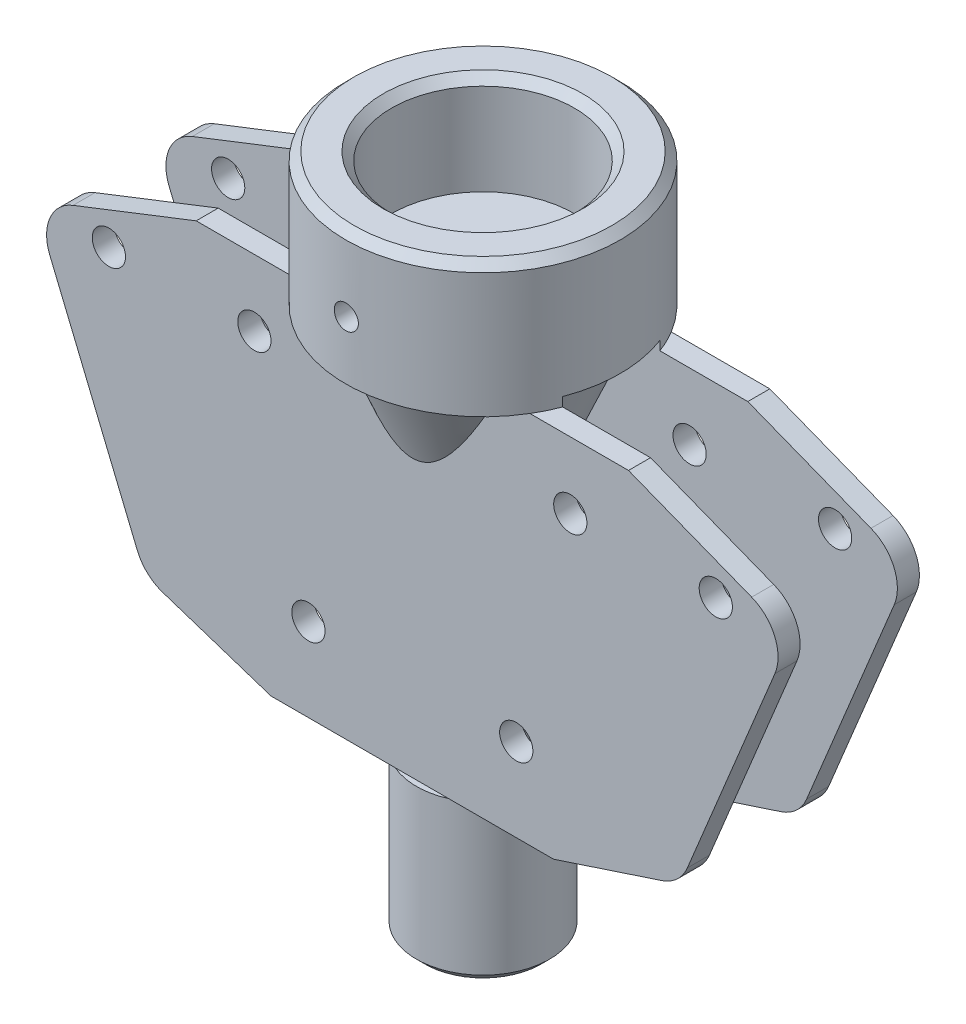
ISO-10303-21;
HEADER;
FILE_DESCRIPTION(('STEP AP214'),'2;1');
FILE_NAME('part.step','',(''),(''),'','','');
FILE_SCHEMA(('AUTOMOTIVE_DESIGN { 1 0 10303 214 1 1 1 1 }'));
ENDSEC;
DATA;
#1=APPLICATION_CONTEXT('core data for automotive mechanical design processes');
#2=APPLICATION_PROTOCOL_DEFINITION('international standard','automotive_design',2000,#1);
#3=PRODUCT_CONTEXT('',#1,'mechanical');
#4=PRODUCT('Part','Part','',(#3));
#5=PRODUCT_RELATED_PRODUCT_CATEGORY('part','',(#4));
#6=PRODUCT_DEFINITION_FORMATION('','',#4);
#7=PRODUCT_DEFINITION_CONTEXT('part definition',#1,'design');
#8=PRODUCT_DEFINITION('design','',#6,#7);
#9=PRODUCT_DEFINITION_SHAPE('','',#8);
#10=(LENGTH_UNIT() NAMED_UNIT(*) SI_UNIT(.MILLI.,.METRE.));
#11=(NAMED_UNIT(*) PLANE_ANGLE_UNIT() SI_UNIT($,.RADIAN.));
#12=(NAMED_UNIT(*) SI_UNIT($,.STERADIAN.) SOLID_ANGLE_UNIT());
#13=UNCERTAINTY_MEASURE_WITH_UNIT(LENGTH_MEASURE(1.E-05),#10,'distance_accuracy_value','');
#14=(GEOMETRIC_REPRESENTATION_CONTEXT(3) GLOBAL_UNCERTAINTY_ASSIGNED_CONTEXT((#13)) GLOBAL_UNIT_ASSIGNED_CONTEXT((#10,
#11,#12)) REPRESENTATION_CONTEXT('',''));
#15=CARTESIAN_POINT('',(0.,0.,0.));
#16=DIRECTION('',(0.,0.,1.));
#17=DIRECTION('',(1.,0.,0.));
#18=AXIS2_PLACEMENT_3D('',#15,#16,#17);
#19=CARTESIAN_POINT('',(-17.,0.,17.));
#20=DIRECTION('',(0.,1.,0.));
#21=DIRECTION('',(0.,0.,1.));
#22=AXIS2_PLACEMENT_3D('',#19,#20,#21);
#23=PLANE('',#22);
#24=CARTESIAN_POINT('',(0.,0.,8.5));
#25=DIRECTION('',(0.,1.,0.));
#26=DIRECTION('',(0.,0.,1.));
#27=AXIS2_PLACEMENT_3D('',#24,#25,#26);
#28=CIRCLE('',#27,6.);
#29=CARTESIAN_POINT('',(1.33322916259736,0.,14.35));
#30=VERTEX_POINT('',#29);
#31=CARTESIAN_POINT('',(-1.33322916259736,0.,14.35));
#32=VERTEX_POINT('',#31);
#33=EDGE_CURVE('E789',#30,#32,#28,.F.);
#34=ORIENTED_EDGE('',*,*,#33,.F.);
#35=DIRECTION('',(1.,0.,0.));
#36=VECTOR('',#35,1.);
#37=CARTESIAN_POINT('',(-17.,0.,14.35));
#38=LINE('',#37,#36);
#39=CARTESIAN_POINT('',(17.,0.,14.35));
#40=VERTEX_POINT('',#39);
#41=EDGE_CURVE('E354',#30,#40,#38,.T.);
#42=ORIENTED_EDGE('',*,*,#41,.T.);
#43=DIRECTION('',(0.,0.,-1.));
#44=VECTOR('',#43,1.);
#45=CARTESIAN_POINT('',(17.,0.,17.));
#46=LINE('',#45,#44);
#47=CARTESIAN_POINT('',(17.,0.,17.));
#48=VERTEX_POINT('',#47);
#49=EDGE_CURVE('E684',#48,#40,#46,.T.);
#50=ORIENTED_EDGE('',*,*,#49,.F.);
#51=DIRECTION('',(1.,0.,0.));
#52=VECTOR('',#51,1.);
#53=CARTESIAN_POINT('',(-17.,0.,17.));
#54=LINE('',#53,#52);
#55=CARTESIAN_POINT('',(-17.,0.,17.));
#56=VERTEX_POINT('',#55);
#57=EDGE_CURVE('E732',#56,#48,#54,.T.);
#58=ORIENTED_EDGE('',*,*,#57,.F.);
#59=DIRECTION('',(0.,0.,-1.));
#60=VECTOR('',#59,1.);
#61=CARTESIAN_POINT('',(-17.,0.,17.));
#62=LINE('',#61,#60);
#63=CARTESIAN_POINT('',(-17.,0.,14.35));
#64=VERTEX_POINT('',#63);
#65=EDGE_CURVE('E680',#56,#64,#62,.T.);
#66=ORIENTED_EDGE('',*,*,#65,.T.);
#67=EDGE_CURVE('E351',#64,#32,#38,.T.);
#68=ORIENTED_EDGE('',*,*,#67,.T.);
#69=EDGE_LOOP('',(#34,#42,#50,#58,#66,#68));
#70=FACE_BOUND('',#69,.T.);
#71=ADVANCED_FACE('F36',(#70),#23,.F.);
#72=CARTESIAN_POINT('',(0.,0.,8.5));
#73=DIRECTION('',(0.,1.,0.));
#74=DIRECTION('',(0.,0.,1.));
#75=AXIS2_PLACEMENT_3D('',#72,#73,#74);
#76=CIRCLE('',#75,6.);
#77=CARTESIAN_POINT('',(-1.3332291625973,0.,2.64999999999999));
#78=VERTEX_POINT('',#77);
#79=CARTESIAN_POINT('',(1.3332291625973,0.,2.64999999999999));
#80=VERTEX_POINT('',#79);
#81=EDGE_CURVE('E797',#78,#80,#76,.F.);
#82=ORIENTED_EDGE('',*,*,#81,.F.);
#83=DIRECTION('',(-1.,0.,0.));
#84=VECTOR('',#83,1.);
#85=CARTESIAN_POINT('',(-17.,0.,2.64999999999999));
#86=LINE('',#85,#84);
#87=CARTESIAN_POINT('',(-17.,0.,2.64999999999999));
#88=VERTEX_POINT('',#87);
#89=EDGE_CURVE('E389',#78,#88,#86,.T.);
#90=ORIENTED_EDGE('',*,*,#89,.T.);
#91=CARTESIAN_POINT('',(-17.,0.,0.));
#92=VERTEX_POINT('',#91);
#93=EDGE_CURVE('E683',#88,#92,#62,.T.);
#94=ORIENTED_EDGE('',*,*,#93,.T.);
#95=DIRECTION('',(1.,0.,0.));
#96=VECTOR('',#95,1.);
#97=CARTESIAN_POINT('',(-17.,0.,0.));
#98=LINE('',#97,#96);
#99=CARTESIAN_POINT('',(17.,0.,0.));
#100=VERTEX_POINT('',#99);
#101=EDGE_CURVE('E711',#92,#100,#98,.T.);
#102=ORIENTED_EDGE('',*,*,#101,.T.);
#103=CARTESIAN_POINT('',(17.,0.,2.64999999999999));
#104=VERTEX_POINT('',#103);
#105=EDGE_CURVE('E687',#104,#100,#46,.T.);
#106=ORIENTED_EDGE('',*,*,#105,.F.);
#107=EDGE_CURVE('E386',#104,#80,#86,.T.);
#108=ORIENTED_EDGE('',*,*,#107,.T.);
#109=EDGE_LOOP('',(#82,#90,#94,#102,#106,#108));
#110=FACE_BOUND('',#109,.T.);
#111=ADVANCED_FACE('F479',(#110),#23,.F.);
#112=CARTESIAN_POINT('',(-46.,46.0814317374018,14.35));
#113=DIRECTION('',(0.,0.,1.));
#114=DIRECTION('',(0.,-1.,0.));
#115=AXIS2_PLACEMENT_3D('',#112,#113,#114);
#116=PLANE('',#115);
#117=CARTESIAN_POINT('',(36.5,37.,14.35));
#118=DIRECTION('',(0.,0.,1.));
#119=DIRECTION('',(0.,-1.,0.));
#120=AXIS2_PLACEMENT_3D('',#117,#118,#119);
#121=CIRCLE('',#120,2.);
#122=CARTESIAN_POINT('',(36.5,35.,14.35));
#123=VERTEX_POINT('',#122);
#124=EDGE_CURVE('E838',#123,#123,#121,.T.);
#125=ORIENTED_EDGE('',*,*,#124,.T.);
#126=EDGE_LOOP('',(#125));
#127=FACE_BOUND('',#126,.T.);
#128=CARTESIAN_POINT('',(19.,37.,14.35));
#129=DIRECTION('',(0.,0.,1.));
#130=DIRECTION('',(0.,-1.,0.));
#131=AXIS2_PLACEMENT_3D('',#128,#129,#130);
#132=CIRCLE('',#131,2.);
#133=CARTESIAN_POINT('',(19.,35.,14.35));
#134=VERTEX_POINT('',#133);
#135=EDGE_CURVE('E845',#134,#134,#132,.T.);
#136=ORIENTED_EDGE('',*,*,#135,.T.);
#137=EDGE_LOOP('',(#136));
#138=FACE_BOUND('',#137,.T.);
#139=CARTESIAN_POINT('',(12.5,10.,14.35));
#140=DIRECTION('',(0.,0.,1.));
#141=DIRECTION('',(0.,-1.,0.));
#142=AXIS2_PLACEMENT_3D('',#139,#140,#141);
#143=CIRCLE('',#142,2.);
#144=CARTESIAN_POINT('',(12.5,8.,14.35));
#145=VERTEX_POINT('',#144);
#146=EDGE_CURVE('E852',#145,#145,#143,.T.);
#147=ORIENTED_EDGE('',*,*,#146,.T.);
#148=EDGE_LOOP('',(#147));
#149=FACE_BOUND('',#148,.T.);
#150=CARTESIAN_POINT('',(-12.5,10.,14.35));
#151=DIRECTION('',(0.,0.,1.));
#152=DIRECTION('',(0.,-1.,0.));
#153=AXIS2_PLACEMENT_3D('',#150,#151,#152);
#154=CIRCLE('',#153,2.);
#155=CARTESIAN_POINT('',(-12.5,8.,14.35));
#156=VERTEX_POINT('',#155);
#157=EDGE_CURVE('E859',#156,#156,#154,.T.);
#158=ORIENTED_EDGE('',*,*,#157,.T.);
#159=EDGE_LOOP('',(#158));
#160=FACE_BOUND('',#159,.T.);
#161=CARTESIAN_POINT('',(-19.,37.,14.35));
#162=DIRECTION('',(0.,0.,1.));
#163=DIRECTION('',(0.,-1.,0.));
#164=AXIS2_PLACEMENT_3D('',#161,#162,#163);
#165=CIRCLE('',#164,2.);
#166=CARTESIAN_POINT('',(-19.,35.,14.35));
#167=VERTEX_POINT('',#166);
#168=EDGE_CURVE('E866',#167,#167,#165,.T.);
#169=ORIENTED_EDGE('',*,*,#168,.T.);
#170=EDGE_LOOP('',(#169));
#171=FACE_BOUND('',#170,.T.);
#172=CARTESIAN_POINT('',(-36.5,37.,14.35));
#173=DIRECTION('',(0.,0.,1.));
#174=DIRECTION('',(0.,-1.,0.));
#175=AXIS2_PLACEMENT_3D('',#172,#173,#174);
#176=CIRCLE('',#175,2.);
#177=CARTESIAN_POINT('',(-36.5,35.,14.35));
#178=VERTEX_POINT('',#177);
#179=EDGE_CURVE('E873',#178,#178,#176,.T.);
#180=ORIENTED_EDGE('',*,*,#179,.T.);
#181=EDGE_LOOP('',(#180));
#182=FACE_BOUND('',#181,.T.);
#183=DIRECTION('',(-1.,0.,0.));
#184=VECTOR('',#183,1.);
#185=CARTESIAN_POINT('',(-46.,45.7402043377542,14.35));
#186=LINE('',#185,#184);
#187=CARTESIAN_POINT('',(12.4564097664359,45.7402043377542,14.35));
#188=VERTEX_POINT('',#187);
#189=CARTESIAN_POINT('',(-12.4564097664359,45.7402043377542,14.35));
#190=VERTEX_POINT('',#189);
#191=EDGE_CURVE('E802',#188,#190,#186,.T.);
#192=ORIENTED_EDGE('',*,*,#191,.T.);
#193=CARTESIAN_POINT('',(-32.2962200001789,90.8652554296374,14.35));
#194=CARTESIAN_POINT('',(-31.5228173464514,89.0635946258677,14.35));
#195=CARTESIAN_POINT('',(-30.7487147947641,87.2622336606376,14.35));
#196=CARTESIAN_POINT('',(-29.1986344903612,83.660311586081,14.35));
#197=CARTESIAN_POINT('',(-28.4226567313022,81.8597504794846,14.35));
#198=CARTESIAN_POINT('',(-26.8681887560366,78.2592535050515,14.35));
#199=CARTESIAN_POINT('',(-26.0896980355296,76.4593178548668,14.35));
#200=CARTESIAN_POINT('',(-24.5296643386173,72.8607738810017,14.35));
#201=CARTESIAN_POINT('',(-23.7481213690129,71.0621655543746,14.35));
#202=CARTESIAN_POINT('',(-22.1743992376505,67.4516525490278,14.35));
#203=CARTESIAN_POINT('',(-21.3821858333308,65.6397627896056,14.35));
#204=CARTESIAN_POINT('',(-19.7920708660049,62.0184628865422,14.35));
#205=CARTESIAN_POINT('',(-18.9941692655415,60.2090527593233,14.35));
#206=CARTESIAN_POINT('',(-17.7912114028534,57.4977921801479,14.35));
#207=CARTESIAN_POINT('',(-17.3892352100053,56.5945752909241,14.35));
#208=CARTESIAN_POINT('',(-16.5827533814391,54.7892718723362,14.35));
#209=CARTESIAN_POINT('',(-16.1782477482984,53.8871853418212,14.35));
#210=CARTESIAN_POINT('',(-15.3661061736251,52.0844340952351,14.35));
#211=CARTESIAN_POINT('',(-14.9584702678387,51.1837693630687,14.35));
#212=CARTESIAN_POINT('',(-14.1392407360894,49.3842427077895,14.35));
#213=CARTESIAN_POINT('',(-13.7276471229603,48.4853807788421,14.35));
#214=CARTESIAN_POINT('',(-13.0437980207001,47.0031458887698,14.35));
#215=CARTESIAN_POINT('',(-12.7730187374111,46.4190920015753,14.35));
#216=CARTESIAN_POINT('',(-12.22884660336,45.25219970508,14.35));
#217=CARTESIAN_POINT('',(-11.9554537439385,44.6693612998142,14.35));
#218=CARTESIAN_POINT('',(-11.4054458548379,43.5050672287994,14.35));
#219=CARTESIAN_POINT('',(-11.1288302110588,42.9236118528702,14.35));
#220=CARTESIAN_POINT('',(-10.5716940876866,41.7625784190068,14.35));
#221=CARTESIAN_POINT('',(-10.2911736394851,41.1830003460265,14.35));
#222=CARTESIAN_POINT('',(-9.72572659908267,40.0272453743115,14.35));
#223=CARTESIAN_POINT('',(-9.44080854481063,39.4510643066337,14.35));
#224=CARTESIAN_POINT('',(-8.86471906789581,38.3018424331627,14.35));
#225=CARTESIAN_POINT('',(-8.57354773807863,37.7288015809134,14.35));
#226=CARTESIAN_POINT('',(-7.98307617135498,36.5871094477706,14.35));
#227=CARTESIAN_POINT('',(-7.68377830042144,36.0184569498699,14.35));
#228=CARTESIAN_POINT('',(-7.22643961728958,35.1700248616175,14.35));
#229=CARTESIAN_POINT('',(-7.07259982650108,34.8879809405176,14.35));
#230=CARTESIAN_POINT('',(-6.76158048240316,34.3257425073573,14.35));
#231=CARTESIAN_POINT('',(-6.60440097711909,34.0455479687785,14.35));
#232=CARTESIAN_POINT('',(-6.2705338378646,33.4602488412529,14.35));
#233=CARTESIAN_POINT('',(-6.09343747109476,33.1553767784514,14.35));
#234=CARTESIAN_POINT('',(-5.73324605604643,32.5491394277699,14.35));
#235=CARTESIAN_POINT('',(-5.55015037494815,32.2477745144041,14.35));
#236=CARTESIAN_POINT('',(-5.17615600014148,31.6494111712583,14.35));
#237=CARTESIAN_POINT('',(-4.98524831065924,31.3524183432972,14.35));
#238=CARTESIAN_POINT('',(-4.593605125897,30.7650090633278,14.35));
#239=CARTESIAN_POINT('',(-4.39287177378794,30.4745911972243,14.35));
#240=CARTESIAN_POINT('',(-4.05219804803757,30.0053054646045,14.35));
#241=CARTESIAN_POINT('',(-3.91613796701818,29.8236278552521,14.35));
#242=CARTESIAN_POINT('',(-3.63728013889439,29.4655355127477,14.35));
#243=CARTESIAN_POINT('',(-3.4944836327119,29.2891198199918,14.35));
#244=CARTESIAN_POINT('',(-3.20073376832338,28.9437109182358,14.35));
#245=CARTESIAN_POINT('',(-3.04979569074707,28.7747048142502,14.35));
#246=CARTESIAN_POINT('',(-2.73740535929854,28.4467894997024,14.35));
#247=CARTESIAN_POINT('',(-2.57596097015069,28.2878729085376,14.35));
#248=CARTESIAN_POINT('',(-2.25582557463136,27.9993970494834,14.35));
#249=CARTESIAN_POINT('',(-2.09836994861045,27.8684845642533,14.35));
#250=CARTESIAN_POINT('',(-1.76992233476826,27.624386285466,14.35));
#251=CARTESIAN_POINT('',(-1.59893207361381,27.5111982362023,14.35));
#252=CARTESIAN_POINT('',(-1.27114235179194,27.3281254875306,14.35));
#253=CARTESIAN_POINT('',(-1.11666342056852,27.2541763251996,14.35));
#254=CARTESIAN_POINT('',(-0.797766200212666,27.1323488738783,14.35));
#255=CARTESIAN_POINT('',(-0.633373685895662,27.0844059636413,14.35));
#256=CARTESIAN_POINT('',(-0.325731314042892,27.0265929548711,14.35));
#257=CARTESIAN_POINT('',(-0.183429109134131,27.0117727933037,14.35));
#258=CARTESIAN_POINT('',(0.101607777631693,27.0070648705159,14.35));
#259=CARTESIAN_POINT('',(0.244342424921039,27.0171751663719,14.35));
#260=CARTESIAN_POINT('',(0.525405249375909,27.0608684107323,14.35));
#261=CARTESIAN_POINT('',(0.663749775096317,27.0943499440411,14.35));
#262=CARTESIAN_POINT('',(0.934106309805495,27.1809340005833,14.35));
#263=CARTESIAN_POINT('',(1.06611289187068,27.2340530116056,14.35));
#264=CARTESIAN_POINT('',(1.30923815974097,27.3491911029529,14.35));
#265=CARTESIAN_POINT('',(1.42109470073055,27.4096900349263,14.35));
#266=CARTESIAN_POINT('',(1.63910843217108,27.5402947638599,14.35));
#267=CARTESIAN_POINT('',(1.74526090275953,27.6104083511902,14.35));
#268=CARTESIAN_POINT('',(1.95257095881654,27.7583049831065,14.35));
#269=CARTESIAN_POINT('',(2.0537102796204,27.8361133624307,14.35));
#270=CARTESIAN_POINT('',(2.25115004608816,27.9975291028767,14.35));
#271=CARTESIAN_POINT('',(2.34745215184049,28.0811344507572,14.35));
#272=CARTESIAN_POINT('',(2.59325924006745,28.3052702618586,14.35));
#273=CARTESIAN_POINT('',(2.73943065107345,28.4494482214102,14.35));
#274=CARTESIAN_POINT('',(3.02307778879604,28.746171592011,14.35));
#275=CARTESIAN_POINT('',(3.160547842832,28.8987223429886,14.35));
#276=CARTESIAN_POINT('',(3.42867116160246,29.2102135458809,14.35));
#277=CARTESIAN_POINT('',(3.55930982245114,29.3691664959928,14.35));
#278=CARTESIAN_POINT('',(3.81478715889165,29.6916734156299,14.35));
#279=CARTESIAN_POINT('',(3.93962506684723,29.8552279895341,14.35));
#280=CARTESIAN_POINT('',(4.18526276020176,30.1869206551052,14.35));
#281=CARTESIAN_POINT('',(4.30603227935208,30.3550810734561,14.35));
#282=CARTESIAN_POINT('',(4.54351035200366,30.6942486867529,14.35));
#283=CARTESIAN_POINT('',(4.6602186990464,30.865256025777,14.35));
#284=CARTESIAN_POINT('',(4.89003299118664,31.2093135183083,14.35));
#285=CARTESIAN_POINT('',(5.00314387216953,31.3823603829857,14.35));
#286=CARTESIAN_POINT('',(5.22643319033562,31.7303223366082,14.35));
#287=CARTESIAN_POINT('',(5.33661174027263,31.9052373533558,14.35));
#288=CARTESIAN_POINT('',(5.57556676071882,32.2906956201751,14.35));
#289=CARTESIAN_POINT('',(5.70380703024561,32.5015709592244,14.35));
#290=CARTESIAN_POINT('',(5.95724387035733,32.9251448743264,14.35));
#291=CARTESIAN_POINT('',(6.08244036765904,33.1378434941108,14.35));
#292=CARTESIAN_POINT('',(6.45416680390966,33.778235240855,14.35));
#293=CARTESIAN_POINT('',(6.69680976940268,34.2081852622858,14.35));
#294=CARTESIAN_POINT('',(7.17440691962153,35.0725264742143,14.35));
#295=CARTESIAN_POINT('',(7.40935807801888,35.5069193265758,14.35));
#296=CARTESIAN_POINT('',(7.87322197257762,36.378923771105,14.35));
#297=CARTESIAN_POINT('',(8.10213457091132,36.8165354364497,14.35));
#298=CARTESIAN_POINT('',(8.55555543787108,37.6949820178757,14.35));
#299=CARTESIAN_POINT('',(8.78005545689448,38.1358211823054,14.35));
#300=CARTESIAN_POINT('',(9.22516763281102,39.0194613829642,14.35));
#301=CARTESIAN_POINT('',(9.44577974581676,39.462262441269,14.35));
#302=CARTESIAN_POINT('',(9.88375500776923,40.3493331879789,14.35));
#303=CARTESIAN_POINT('',(10.1011189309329,40.7936024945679,14.35));
#304=CARTESIAN_POINT('',(10.5331818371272,41.6834351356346,14.35));
#305=CARTESIAN_POINT('',(10.7478808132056,42.1289984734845,14.35));
#306=CARTESIAN_POINT('',(11.3869581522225,43.4638012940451,14.35));
#307=CARTESIAN_POINT('',(11.8080229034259,44.3546272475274,14.35));
#308=CARTESIAN_POINT('',(12.6437028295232,46.1393537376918,14.35));
#309=CARTESIAN_POINT('',(13.0583176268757,47.03325445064,14.35));
#310=CARTESIAN_POINT('',(13.8822389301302,48.8224648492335,14.35));
#311=CARTESIAN_POINT('',(14.2915501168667,49.7177723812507,14.35));
#312=CARTESIAN_POINT('',(15.1063496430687,51.5101026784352,14.35));
#313=CARTESIAN_POINT('',(15.511838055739,52.4071254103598,14.35));
#314=CARTESIAN_POINT('',(16.4761496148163,54.5499744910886,14.35));
#315=CARTESIAN_POINT('',(17.033577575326,55.7964284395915,14.35));
#316=CARTESIAN_POINT('',(18.1441043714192,58.2912643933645,14.35));
#317=CARTESIAN_POINT('',(18.6972031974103,59.5396464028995,14.35));
#318=CARTESIAN_POINT('',(19.8000784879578,62.0378961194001,14.35));
#319=CARTESIAN_POINT('',(20.3498549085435,63.2877638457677,14.35));
#320=CARTESIAN_POINT('',(21.4467879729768,65.7886486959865,14.35));
#321=CARTESIAN_POINT('',(21.9939446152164,67.0396658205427,14.35));
#322=CARTESIAN_POINT('',(23.6327802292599,70.7951763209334,14.35));
#323=CARTESIAN_POINT('',(24.7213411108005,73.3010301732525,14.35));
#324=CARTESIAN_POINT('',(26.8929186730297,78.3151181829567,14.35));
#325=CARTESIAN_POINT('',(27.9759353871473,80.8233523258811,14.35));
#326=CARTESIAN_POINT('',(30.138344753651,85.8421956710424,14.35));
#327=CARTESIAN_POINT('',(31.2177363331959,88.3528053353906,14.35));
#328=CARTESIAN_POINT('',(33.3736540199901,93.3752602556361,14.35));
#329=CARTESIAN_POINT('',(34.450180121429,95.8871055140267,14.35));
#330=CARTESIAN_POINT('',(36.6005431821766,100.910472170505,14.35));
#331=CARTESIAN_POINT('',(37.6743812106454,103.421993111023,14.35));
#332=CARTESIAN_POINT('',(39.820362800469,108.445751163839,14.35));
#333=CARTESIAN_POINT('',(40.8925063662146,110.957988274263,14.35));
#334=CARTESIAN_POINT('',(41.9640349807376,113.470487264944,14.35));
#335=B_SPLINE_CURVE_WITH_KNOTS('',3,(#193,#194,#195,#196,#197,#198,#199,#200,#201,#202,#203,
#204,#205,#206,#207,#208,#209,#210,#211,#212,#213,#214,#215,#216,#217,#218,#219,#220,#221,#222,
#223,#224,#225,#226,#227,#228,#229,#230,#231,#232,#233,#234,#235,#236,#237,#238,#239,#240,#241,
#242,#243,#244,#245,#246,#247,#248,#249,#250,#251,#252,#253,#254,#255,#256,#257,#258,#259,#260,
#261,#262,#263,#264,#265,#266,#267,#268,#269,#270,#271,#272,#273,#274,#275,#276,#277,#278,#279,
#280,#281,#282,#283,#284,#285,#286,#287,#288,#289,#290,#291,#292,#293,#294,#295,#296,#297,#298,
#299,#300,#301,#302,#303,#304,#305,#306,#307,#308,#309,#310,#311,#312,#313,#314,#315,#316,#317,
#318,#319,#320,#321,#322,#323,#324,#325,#326,#327,#328,#329,#330,#331,#332,#333,#334),
.UNSPECIFIED.,.F.,.F.,(4,2,2,2,2,2,2,2,2,2,2,2,2,2,2,2,2,2,2,2,2,2,2,2,2,2,2,2,2,2,2,2,2,2,2,2,
2,2,2,2,2,2,2,2,2,2,2,2,2,2,2,2,2,2,2,2,2,2,2,2,2,2,2,2,2,2,2,2,2,2,4),(0.,5.88193913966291,
11.7638982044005,17.647121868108,23.5303324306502,29.4628570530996,35.3954207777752,
38.3613022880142,41.3271807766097,44.2930254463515,47.2588605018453,49.1901667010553,
51.1214793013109,53.0531661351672,54.9848374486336,56.9131397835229,58.8414135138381,
60.7691317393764,61.7329288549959,62.6967121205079,63.7543882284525,64.8121762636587,
65.8712186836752,66.930031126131,67.6108459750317,68.2915358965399,68.9709899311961,
69.6499410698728,70.2634291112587,70.8768390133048,71.3889375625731,71.8997577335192,
72.3269040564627,72.7540170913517,73.1792881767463,73.6049171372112,73.9858549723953,
74.3671033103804,74.7496515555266,75.1320676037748,75.747479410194,76.3632883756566,
76.9803640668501,77.5975211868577,78.2185522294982,78.8396147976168,79.4597848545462,
80.0799310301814,80.8203217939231,81.5607303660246,83.0416847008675,84.5232148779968,
86.004778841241,87.4888902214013,88.9730183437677,90.4567868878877,91.9405593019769,
94.8964948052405,97.8526026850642,100.80589431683,103.759129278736,107.855379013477,
111.951637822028,116.047950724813,120.14426614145,128.340498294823,136.536680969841,
144.735106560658,152.933548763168,161.127923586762,169.322277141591),.UNSPECIFIED.);
#336=EDGE_CURVE('E450',#190,#188,#335,.T.);
#337=ORIENTED_EDGE('',*,*,#336,.T.);
#338=EDGE_LOOP('',(#192,#337));
#339=FACE_BOUND('',#338,.T.);
#340=DIRECTION('',(0.,1.,0.));
#341=VECTOR('',#340,1.);
#342=CARTESIAN_POINT('',(1.33322916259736,-1.17252355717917,14.35));
#343=LINE('',#342,#341);
#344=CARTESIAN_POINT('',(1.33322916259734,24.8274764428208,14.35));
#345=VERTEX_POINT('',#344);
#346=EDGE_CURVE('E793',#345,#30,#343,.F.);
#347=ORIENTED_EDGE('',*,*,#346,.F.);
#348=DIRECTION('',(1.,0.,0.));
#349=VECTOR('',#348,1.);
#350=CARTESIAN_POINT('',(-46.,24.8274764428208,14.35));
#351=LINE('',#350,#349);
#352=CARTESIAN_POINT('',(-1.33322916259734,24.8274764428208,14.35));
#353=VERTEX_POINT('',#352);
#354=EDGE_CURVE('E60',#353,#345,#351,.T.);
#355=ORIENTED_EDGE('',*,*,#354,.F.);
#356=DIRECTION('',(0.,1.,0.));
#357=VECTOR('',#356,1.);
#358=CARTESIAN_POINT('',(-1.33322916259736,-1.17252355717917,14.35));
#359=LINE('',#358,#357);
#360=EDGE_CURVE('E787',#32,#353,#359,.T.);
#361=ORIENTED_EDGE('',*,*,#360,.F.);
#362=ORIENTED_EDGE('',*,*,#67,.F.);
#363=DIRECTION('',(0.949917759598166,-0.3125,0.));
#364=VECTOR('',#363,1.);
#365=CARTESIAN_POINT('',(-17.,0.,14.35));
#366=LINE('',#365,#364);
#367=CARTESIAN_POINT('',(-30.0164889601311,4.28211048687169,14.35));
#368=VERTEX_POINT('',#367);
#369=EDGE_CURVE('E348',#368,#64,#366,.T.);
#370=ORIENTED_EDGE('',*,*,#369,.F.);
#371=CARTESIAN_POINT('',(-28.4539889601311,9.03169928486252,14.35));
#372=DIRECTION('',(0.,0.,1.));
#373=DIRECTION('',(0.,-1.,0.));
#374=AXIS2_PLACEMENT_3D('',#371,#372,#373);
#375=CIRCLE('',#374,5.);
#376=CARTESIAN_POINT('',(-33.0754784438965,7.12334005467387,14.35));
#377=VERTEX_POINT('',#376);
#378=EDGE_CURVE('E346',#368,#377,#375,.F.);
#379=ORIENTED_EDGE('',*,*,#378,.T.);
#380=DIRECTION('',(0.381671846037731,-0.924297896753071,0.));
#381=VECTOR('',#380,1.);
#382=CARTESIAN_POINT('',(-32.1986841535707,5.,14.35));
#383=LINE('',#382,#381);
#384=CARTESIAN_POINT('',(-43.6126976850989,32.6414118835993,14.35));
#385=VERTEX_POINT('',#384);
#386=EDGE_CURVE('E343',#385,#377,#383,.T.);
#387=ORIENTED_EDGE('',*,*,#386,.F.);
#388=CARTESIAN_POINT('',(-38.9912082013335,34.5497711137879,14.35));
#389=DIRECTION('',(0.,0.,1.));
#390=DIRECTION('',(0.,-1.,0.));
#391=AXIS2_PLACEMENT_3D('',#388,#389,#390);
#392=CIRCLE('',#391,5.);
#393=CARTESIAN_POINT('',(-40.8125352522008,39.2062470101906,14.35));
#394=VERTEX_POINT('',#393);
#395=EDGE_CURVE('E339',#385,#394,#392,.F.);
#396=ORIENTED_EDGE('',*,*,#395,.T.);
#397=DIRECTION('',(-0.931295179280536,-0.364265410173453,0.));
#398=VECTOR('',#397,1.);
#399=CARTESIAN_POINT('',(-45.5571987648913,37.3504263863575,14.35));
#400=LINE('',#399,#398);
#401=CARTESIAN_POINT('',(-26.,45.,14.35));
#402=VERTEX_POINT('',#401);
#403=EDGE_CURVE('E333',#402,#394,#400,.T.);
#404=ORIENTED_EDGE('',*,*,#403,.F.);
#405=DIRECTION('',(-1.,0.,0.));
#406=VECTOR('',#405,1.);
#407=CARTESIAN_POINT('',(26.,45.,14.35));
#408=LINE('',#407,#406);
#409=CARTESIAN_POINT('',(-15.4281398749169,45.,14.35));
#410=VERTEX_POINT('',#409);
#411=EDGE_CURVE('E331',#410,#402,#408,.T.);
#412=ORIENTED_EDGE('',*,*,#411,.F.);
#413=DIRECTION('',(0.,-1.,0.));
#414=VECTOR('',#413,1.);
#415=CARTESIAN_POINT('',(-15.4281398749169,61.,14.35));
#416=LINE('',#415,#414);
#417=CARTESIAN_POINT('',(-15.4281398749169,46.0814317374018,14.35));
#418=VERTEX_POINT('',#417);
#419=EDGE_CURVE('E628',#418,#410,#416,.T.);
#420=ORIENTED_EDGE('',*,*,#419,.F.);
#421=DIRECTION('',(1.,0.,0.));
#422=VECTOR('',#421,1.);
#423=CARTESIAN_POINT('',(-46.,46.0814317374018,14.35));
#424=LINE('',#423,#422);
#425=CARTESIAN_POINT('',(15.4281398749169,46.0814317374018,14.35));
#426=VERTEX_POINT('',#425);
#427=EDGE_CURVE('E406',#418,#426,#424,.T.);
#428=ORIENTED_EDGE('',*,*,#427,.T.);
#429=DIRECTION('',(0.,-1.,0.));
#430=VECTOR('',#429,1.);
#431=CARTESIAN_POINT('',(15.4281398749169,61.,14.35));
#432=LINE('',#431,#430);
#433=CARTESIAN_POINT('',(15.4281398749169,45.,14.35));
#434=VERTEX_POINT('',#433);
#435=EDGE_CURVE('E303',#434,#426,#432,.F.);
#436=ORIENTED_EDGE('',*,*,#435,.F.);
#437=DIRECTION('',(-1.,0.,0.));
#438=VECTOR('',#437,1.);
#439=CARTESIAN_POINT('',(26.,45.,14.35));
#440=LINE('',#439,#438);
#441=CARTESIAN_POINT('',(26.,45.,14.35));
#442=VERTEX_POINT('',#441);
#443=EDGE_CURVE('E368',#442,#434,#440,.T.);
#444=ORIENTED_EDGE('',*,*,#443,.F.);
#445=DIRECTION('',(-0.931295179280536,0.364265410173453,0.));
#446=VECTOR('',#445,1.);
#447=CARTESIAN_POINT('',(45.5571987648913,37.3504263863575,14.35));
#448=LINE('',#447,#446);
#449=CARTESIAN_POINT('',(40.8125352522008,39.2062470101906,14.35));
#450=VERTEX_POINT('',#449);
#451=EDGE_CURVE('E365',#450,#442,#448,.T.);
#452=ORIENTED_EDGE('',*,*,#451,.F.);
#453=CARTESIAN_POINT('',(38.9912082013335,34.5497711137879,14.35));
#454=DIRECTION('',(0.,0.,1.));
#455=DIRECTION('',(0.,-1.,0.));
#456=AXIS2_PLACEMENT_3D('',#453,#454,#455);
#457=CIRCLE('',#456,5.);
#458=CARTESIAN_POINT('',(43.6126976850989,32.6414118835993,14.35));
#459=VERTEX_POINT('',#458);
#460=EDGE_CURVE('E363',#450,#459,#457,.F.);
#461=ORIENTED_EDGE('',*,*,#460,.T.);
#462=DIRECTION('',(0.381671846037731,0.924297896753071,0.));
#463=VECTOR('',#462,1.);
#464=CARTESIAN_POINT('',(32.1986841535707,5.,14.35));
#465=LINE('',#464,#463);
#466=CARTESIAN_POINT('',(33.0754784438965,7.12334005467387,14.35));
#467=VERTEX_POINT('',#466);
#468=EDGE_CURVE('E360',#467,#459,#465,.T.);
#469=ORIENTED_EDGE('',*,*,#468,.F.);
#470=CARTESIAN_POINT('',(28.4539889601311,9.03169928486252,14.35));
#471=DIRECTION('',(0.,0.,1.));
#472=DIRECTION('',(0.,-1.,0.));
#473=AXIS2_PLACEMENT_3D('',#470,#471,#472);
#474=CIRCLE('',#473,5.);
#475=CARTESIAN_POINT('',(30.0164889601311,4.28211048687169,14.35));
#476=VERTEX_POINT('',#475);
#477=EDGE_CURVE('E358',#467,#476,#474,.F.);
#478=ORIENTED_EDGE('',*,*,#477,.T.);
#479=DIRECTION('',(0.949917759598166,0.3125,0.));
#480=VECTOR('',#479,1.);
#481=CARTESIAN_POINT('',(17.,0.,14.35));
#482=LINE('',#481,#480);
#483=EDGE_CURVE('E355',#40,#476,#482,.T.);
#484=ORIENTED_EDGE('',*,*,#483,.F.);
#485=ORIENTED_EDGE('',*,*,#41,.F.);
#486=EDGE_LOOP('',(#347,#355,#361,#362,#370,#379,#387,#396,#404,#412,#420,#428,#436,#444,#452,
#461,#469,#478,#484,#485));
#487=FACE_BOUND('',#486,.T.);
#488=ADVANCED_FACE('F475',(#127,#138,#149,#160,#171,#182,#339,#487),#116,.F.);
#489=CARTESIAN_POINT('',(-46.,46.0814317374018,2.65));
#490=DIRECTION('',(0.,0.,-1.));
#491=DIRECTION('',(0.,1.,0.));
#492=AXIS2_PLACEMENT_3D('',#489,#490,#491);
#493=PLANE('',#492);
#494=CARTESIAN_POINT('',(36.5,37.,2.65));
#495=DIRECTION('',(0.,0.,-1.));
#496=DIRECTION('',(0.,1.,0.));
#497=AXIS2_PLACEMENT_3D('',#494,#495,#496);
#498=CIRCLE('',#497,2.);
#499=CARTESIAN_POINT('',(36.5,39.,2.65));
#500=VERTEX_POINT('',#499);
#501=EDGE_CURVE('E580',#500,#500,#498,.T.);
#502=ORIENTED_EDGE('',*,*,#501,.T.);
#503=EDGE_LOOP('',(#502));
#504=FACE_BOUND('',#503,.T.);
#505=CARTESIAN_POINT('',(19.,37.,2.65));
#506=DIRECTION('',(0.,0.,-1.));
#507=DIRECTION('',(0.,1.,0.));
#508=AXIS2_PLACEMENT_3D('',#505,#506,#507);
#509=CIRCLE('',#508,2.);
#510=CARTESIAN_POINT('',(19.,39.,2.65));
#511=VERTEX_POINT('',#510);
#512=EDGE_CURVE('E585',#511,#511,#509,.T.);
#513=ORIENTED_EDGE('',*,*,#512,.T.);
#514=EDGE_LOOP('',(#513));
#515=FACE_BOUND('',#514,.T.);
#516=CARTESIAN_POINT('',(12.5,10.,2.64999999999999));
#517=DIRECTION('',(0.,0.,-1.));
#518=DIRECTION('',(0.,1.,0.));
#519=AXIS2_PLACEMENT_3D('',#516,#517,#518);
#520=CIRCLE('',#519,2.);
#521=CARTESIAN_POINT('',(12.5,12.,2.65));
#522=VERTEX_POINT('',#521);
#523=EDGE_CURVE('E590',#522,#522,#520,.T.);
#524=ORIENTED_EDGE('',*,*,#523,.T.);
#525=EDGE_LOOP('',(#524));
#526=FACE_BOUND('',#525,.T.);
#527=CARTESIAN_POINT('',(-12.5,10.,2.64999999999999));
#528=DIRECTION('',(0.,0.,-1.));
#529=DIRECTION('',(0.,1.,0.));
#530=AXIS2_PLACEMENT_3D('',#527,#528,#529);
#531=CIRCLE('',#530,2.);
#532=CARTESIAN_POINT('',(-12.5,12.,2.65));
#533=VERTEX_POINT('',#532);
#534=EDGE_CURVE('E595',#533,#533,#531,.T.);
#535=ORIENTED_EDGE('',*,*,#534,.T.);
#536=EDGE_LOOP('',(#535));
#537=FACE_BOUND('',#536,.T.);
#538=CARTESIAN_POINT('',(-19.,37.,2.65));
#539=DIRECTION('',(0.,0.,-1.));
#540=DIRECTION('',(0.,1.,0.));
#541=AXIS2_PLACEMENT_3D('',#538,#539,#540);
#542=CIRCLE('',#541,2.);
#543=CARTESIAN_POINT('',(-19.,39.,2.65));
#544=VERTEX_POINT('',#543);
#545=EDGE_CURVE('E600',#544,#544,#542,.T.);
#546=ORIENTED_EDGE('',*,*,#545,.T.);
#547=EDGE_LOOP('',(#546));
#548=FACE_BOUND('',#547,.T.);
#549=CARTESIAN_POINT('',(-36.5,37.,2.65));
#550=DIRECTION('',(0.,0.,-1.));
#551=DIRECTION('',(0.,1.,0.));
#552=AXIS2_PLACEMENT_3D('',#549,#550,#551);
#553=CIRCLE('',#552,2.);
#554=CARTESIAN_POINT('',(-36.5,39.,2.65));
#555=VERTEX_POINT('',#554);
#556=EDGE_CURVE('E604',#555,#555,#553,.T.);
#557=ORIENTED_EDGE('',*,*,#556,.T.);
#558=EDGE_LOOP('',(#557));
#559=FACE_BOUND('',#558,.T.);
#560=DIRECTION('',(1.,0.,0.));
#561=VECTOR('',#560,1.);
#562=CARTESIAN_POINT('',(-46.,45.7402043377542,2.65));
#563=LINE('',#562,#561);
#564=CARTESIAN_POINT('',(-12.4564097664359,45.7402043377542,2.65));
#565=VERTEX_POINT('',#564);
#566=CARTESIAN_POINT('',(12.4564097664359,45.7402043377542,2.65));
#567=VERTEX_POINT('',#566);
#568=EDGE_CURVE('E618',#565,#567,#563,.T.);
#569=ORIENTED_EDGE('',*,*,#568,.T.);
#570=CARTESIAN_POINT('',(-32.2962200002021,90.8652554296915,2.65000000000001));
#571=CARTESIAN_POINT('',(-31.5228173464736,89.0635946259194,2.65000000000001));
#572=CARTESIAN_POINT('',(-30.7487147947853,87.2622336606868,2.65));
#573=CARTESIAN_POINT('',(-29.1986344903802,83.6603115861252,2.65));
#574=CARTESIAN_POINT('',(-28.4226567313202,81.8597504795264,2.65));
#575=CARTESIAN_POINT('',(-26.8681887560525,78.2592535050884,2.65));
#576=CARTESIAN_POINT('',(-26.0896980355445,76.4593178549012,2.65));
#577=CARTESIAN_POINT('',(-24.5296643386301,72.8607738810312,2.65));
#578=CARTESIAN_POINT('',(-23.7481213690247,71.0621655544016,2.65));
#579=CARTESIAN_POINT('',(-22.1743992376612,67.4516525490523,2.65));
#580=CARTESIAN_POINT('',(-21.3821858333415,65.63976278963,2.65));
#581=CARTESIAN_POINT('',(-19.7920708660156,62.0184628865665,2.65));
#582=CARTESIAN_POINT('',(-18.9941692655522,60.2090527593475,2.65));
#583=CARTESIAN_POINT('',(-17.7912114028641,57.497792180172,2.65));
#584=CARTESIAN_POINT('',(-17.389235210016,56.5945752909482,2.65));
#585=CARTESIAN_POINT('',(-16.5827533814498,54.7892718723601,2.65));
#586=CARTESIAN_POINT('',(-16.1782477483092,53.8871853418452,2.65));
#587=CARTESIAN_POINT('',(-15.3661061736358,52.0844340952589,2.65));
#588=CARTESIAN_POINT('',(-14.9584702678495,51.1837693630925,2.65));
#589=CARTESIAN_POINT('',(-14.1392407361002,49.3842427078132,2.65));
#590=CARTESIAN_POINT('',(-13.7276471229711,48.4853807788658,2.65));
#591=CARTESIAN_POINT('',(-13.0437980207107,47.0031458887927,2.65));
#592=CARTESIAN_POINT('',(-12.7730187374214,46.4190920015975,2.65));
#593=CARTESIAN_POINT('',(-12.2288466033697,45.2521997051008,2.65));
#594=CARTESIAN_POINT('',(-11.9554537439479,44.6693612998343,2.65));
#595=CARTESIAN_POINT('',(-11.4054458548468,43.5050672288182,2.65));
#596=CARTESIAN_POINT('',(-11.1288302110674,42.9236118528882,2.65));
#597=CARTESIAN_POINT('',(-10.5716940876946,41.7625784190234,2.65));
#598=CARTESIAN_POINT('',(-10.2911736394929,41.1830003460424,2.65));
#599=CARTESIAN_POINT('',(-9.72572659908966,40.0272453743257,2.65));
#600=CARTESIAN_POINT('',(-9.44080854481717,39.4510643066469,2.65));
#601=CARTESIAN_POINT('',(-8.86471906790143,38.3018424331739,2.65));
#602=CARTESIAN_POINT('',(-8.57354773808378,37.7288015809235,2.65));
#603=CARTESIAN_POINT('',(-7.98307617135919,36.5871094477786,2.65));
#604=CARTESIAN_POINT('',(-7.68377830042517,36.0184569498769,2.65));
#605=CARTESIAN_POINT('',(-7.22643961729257,35.170024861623,2.65));
#606=CARTESIAN_POINT('',(-7.07259982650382,34.8879809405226,2.65));
#607=CARTESIAN_POINT('',(-6.76158048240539,34.3257425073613,2.65));
#608=CARTESIAN_POINT('',(-6.60440097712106,34.045547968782,2.65));
#609=CARTESIAN_POINT('',(-6.27053383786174,33.4602488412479,2.65));
#610=CARTESIAN_POINT('',(-6.09343747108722,33.1553767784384,2.65));
#611=CARTESIAN_POINT('',(-5.73324605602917,32.5491394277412,2.65));
#612=CARTESIAN_POINT('',(-5.55015037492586,32.2477745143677,2.65));
#613=CARTESIAN_POINT('',(-5.17615600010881,31.6494111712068,2.65));
#614=CARTESIAN_POINT('',(-4.98524831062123,31.3524183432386,2.65));
#615=CARTESIAN_POINT('',(-4.5936051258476,30.7650090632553,2.65));
#616=CARTESIAN_POINT('',(-4.39287177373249,30.4745911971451,2.65));
#617=CARTESIAN_POINT('',(-4.05219804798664,30.0053054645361,2.65));
#618=CARTESIAN_POINT('',(-3.91613796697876,29.8236278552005,2.65));
#619=CARTESIAN_POINT('',(-3.63728013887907,29.465535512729,2.65));
#620=CARTESIAN_POINT('',(-3.49448363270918,29.289119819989,2.65));
#621=CARTESIAN_POINT('',(-3.2007337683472,28.9437109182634,2.65));
#622=CARTESIAN_POINT('',(-3.04979569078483,28.7747048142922,2.65));
#623=CARTESIAN_POINT('',(-2.73740535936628,28.4467894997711,2.65));
#624=CARTESIAN_POINT('',(-2.57596097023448,28.2878729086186,2.65));
#625=CARTESIAN_POINT('',(-2.25582557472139,27.9993970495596,2.65));
#626=CARTESIAN_POINT('',(-2.09836994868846,27.8684845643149,2.65));
#627=CARTESIAN_POINT('',(-1.76992233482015,27.6243862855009,2.65));
#628=CARTESIAN_POINT('',(-1.59893207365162,27.5111982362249,2.65));
#629=CARTESIAN_POINT('',(-1.27114235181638,27.328125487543,2.65));
#630=CARTESIAN_POINT('',(-1.11666342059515,27.2541763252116,2.65));
#631=CARTESIAN_POINT('',(-0.797766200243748,27.1323488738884,2.65));
#632=CARTESIAN_POINT('',(-0.633373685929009,27.08440596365,2.65));
#633=CARTESIAN_POINT('',(-0.32573131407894,27.0265929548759,2.65));
#634=CARTESIAN_POINT('',(-0.18342910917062,27.0117727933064,2.65));
#635=CARTESIAN_POINT('',(0.101607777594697,27.0070648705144,2.65));
#636=CARTESIAN_POINT('',(0.244342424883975,27.0171751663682,2.65));
#637=CARTESIAN_POINT('',(0.525405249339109,27.0608684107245,2.65));
#638=CARTESIAN_POINT('',(0.663749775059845,27.0943499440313,2.65));
#639=CARTESIAN_POINT('',(0.934106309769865,27.18093400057,2.65));
#640=CARTESIAN_POINT('',(1.06611289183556,27.2340530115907,2.65));
#641=CARTESIAN_POINT('',(1.30923815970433,27.349191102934,2.65));
#642=CARTESIAN_POINT('',(1.42109470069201,27.4096900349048,2.65));
#643=CARTESIAN_POINT('',(1.63910843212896,27.540294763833,2.65));
#644=CARTESIAN_POINT('',(1.74526090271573,27.6104083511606,2.65));
#645=CARTESIAN_POINT('',(1.95257095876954,27.7583049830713,2.65));
#646=CARTESIAN_POINT('',(2.05371027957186,27.8361133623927,2.65));
#647=CARTESIAN_POINT('',(2.25115004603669,27.997529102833,2.65));
#648=CARTESIAN_POINT('',(2.34745215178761,28.0811344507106,2.65));
#649=CARTESIAN_POINT('',(2.59325924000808,28.3052702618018,2.65));
#650=CARTESIAN_POINT('',(2.73943065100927,28.4494482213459,2.65));
#651=CARTESIAN_POINT('',(3.02307778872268,28.7461715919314,2.65));
#652=CARTESIAN_POINT('',(3.16054784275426,28.8987223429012,2.65));
#653=CARTESIAN_POINT('',(3.42867116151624,29.2102135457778,2.65));
#654=CARTESIAN_POINT('',(3.55930982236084,29.3691664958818,2.65));
#655=CARTESIAN_POINT('',(3.81478715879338,29.6916734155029,2.65));
#656=CARTESIAN_POINT('',(3.93962506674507,29.8552279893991,2.65));
#657=CARTESIAN_POINT('',(4.18526276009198,30.1869206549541,2.65));
#658=CARTESIAN_POINT('',(4.30603227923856,30.3550810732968,2.65));
#659=CARTESIAN_POINT('',(4.54351035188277,30.6942486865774,2.65));
#660=CARTESIAN_POINT('',(4.66021869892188,30.8652560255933,2.65));
#661=CARTESIAN_POINT('',(4.89003299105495,31.2093135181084,2.65));
#662=CARTESIAN_POINT('',(5.00314387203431,31.3823603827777,2.65));
#663=CARTESIAN_POINT('',(5.22643319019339,31.7303223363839,2.65));
#664=CARTESIAN_POINT('',(5.33661174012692,31.9052373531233,2.65));
#665=CARTESIAN_POINT('',(5.5755667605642,32.2906956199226,2.65));
#666=CARTESIAN_POINT('',(5.70380703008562,32.50157095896,2.65));
#667=CARTESIAN_POINT('',(5.9572438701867,32.9251448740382,2.65));
#668=CARTESIAN_POINT('',(6.08244036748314,33.1378434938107,2.65));
#669=CARTESIAN_POINT('',(6.45416680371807,33.7782352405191,2.65));
#670=CARTESIAN_POINT('',(6.69680976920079,34.208185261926,2.65));
#671=CARTESIAN_POINT('',(7.17440691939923,35.0725264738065,2.65));
#672=CARTESIAN_POINT('',(7.40935807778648,35.5069193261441,2.65));
#673=CARTESIAN_POINT('',(7.87322197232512,36.3789237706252,2.65));
#674=CARTESIAN_POINT('',(8.10213457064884,36.8165354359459,2.65));
#675=CARTESIAN_POINT('',(8.55555543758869,37.6949820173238,2.65));
#676=CARTESIAN_POINT('',(8.78005545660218,38.1358211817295,2.65));
#677=CARTESIAN_POINT('',(9.22516763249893,39.0194613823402,2.65));
#678=CARTESIAN_POINT('',(9.44577974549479,39.462262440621,2.65));
#679=CARTESIAN_POINT('',(9.88375500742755,40.3493331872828,2.65));
#680=CARTESIAN_POINT('',(10.1011189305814,40.7936024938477,2.65));
#681=CARTESIAN_POINT('',(10.533181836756,41.6834351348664,2.65));
#682=CARTESIAN_POINT('',(10.7478808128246,42.1289984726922,2.65));
#683=CARTESIAN_POINT('',(11.3869581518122,43.4638012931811,2.65));
#684=CARTESIAN_POINT('',(11.8080229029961,44.3546272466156,2.65));
#685=CARTESIAN_POINT('',(12.6437028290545,46.1393537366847,2.65));
#686=CARTESIAN_POINT('',(13.0583176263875,47.0332544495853,2.65));
#687=CARTESIAN_POINT('',(13.882238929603,48.8224648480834,2.65));
#688=CARTESIAN_POINT('',(14.29155011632,49.7177723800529,2.65));
#689=CARTESIAN_POINT('',(15.106349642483,51.5101026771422,2.65));
#690=CARTESIAN_POINT('',(15.5118380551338,52.4071254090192,2.65));
#691=CARTESIAN_POINT('',(16.4761496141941,54.5499744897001,2.65));
#692=CARTESIAN_POINT('',(17.033577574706,55.7964284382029,2.65));
#693=CARTESIAN_POINT('',(18.1441043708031,58.291264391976,2.65));
#694=CARTESIAN_POINT('',(18.6972031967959,59.5396464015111,2.65));
#695=CARTESIAN_POINT('',(19.8000784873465,62.037896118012,2.65));
#696=CARTESIAN_POINT('',(20.3498549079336,63.2877638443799,2.65));
#697=CARTESIAN_POINT('',(21.4467879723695,65.7886486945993,2.65));
#698=CARTESIAN_POINT('',(21.9939446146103,67.0396658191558,2.65));
#699=CARTESIAN_POINT('',(23.6327802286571,70.7951763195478,2.65));
#700=CARTESIAN_POINT('',(24.7213411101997,73.301030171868,2.65));
#701=CARTESIAN_POINT('',(26.8929186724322,78.3151181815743,2.65));
#702=CARTESIAN_POINT('',(27.9759353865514,80.8233523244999,2.65));
#703=CARTESIAN_POINT('',(30.1383447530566,85.8421956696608,2.65000000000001));
#704=CARTESIAN_POINT('',(31.2177363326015,88.3528053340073,2.65000000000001));
#705=CARTESIAN_POINT('',(33.3736540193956,93.3752602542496,2.65000000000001));
#706=CARTESIAN_POINT('',(34.4501801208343,95.8871055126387,2.65000000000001));
#707=CARTESIAN_POINT('',(36.6005431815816,100.910472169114,2.65000000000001));
#708=CARTESIAN_POINT('',(37.6743812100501,103.42199310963,2.65000000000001));
#709=CARTESIAN_POINT('',(39.820362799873,108.445751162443,2.65000000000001));
#710=CARTESIAN_POINT('',(40.8925063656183,110.957988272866,2.65000000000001));
#711=CARTESIAN_POINT('',(41.964034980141,113.470487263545,2.65000000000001));
#712=B_SPLINE_CURVE_WITH_KNOTS('',3,(#570,#571,#572,#573,#574,#575,#576,#577,#578,#579,#580,
#581,#582,#583,#584,#585,#586,#587,#588,#589,#590,#591,#592,#593,#594,#595,#596,#597,#598,#599,
#600,#601,#602,#603,#604,#605,#606,#607,#608,#609,#610,#611,#612,#613,#614,#615,#616,#617,#618,
#619,#620,#621,#622,#623,#624,#625,#626,#627,#628,#629,#630,#631,#632,#633,#634,#635,#636,#637,
#638,#639,#640,#641,#642,#643,#644,#645,#646,#647,#648,#649,#650,#651,#652,#653,#654,#655,#656,
#657,#658,#659,#660,#661,#662,#663,#664,#665,#666,#667,#668,#669,#670,#671,#672,#673,#674,#675,
#676,#677,#678,#679,#680,#681,#682,#683,#684,#685,#686,#687,#688,#689,#690,#691,#692,#693,#694,
#695,#696,#697,#698,#699,#700,#701,#702,#703,#704,#705,#706,#707,#708,#709,#710,#711),
.UNSPECIFIED.,.F.,.F.,(4,2,2,2,2,2,2,2,2,2,2,2,2,2,2,2,2,2,2,2,2,2,2,2,2,2,2,2,2,2,2,2,2,2,2,2,
2,2,2,2,2,2,2,2,2,2,2,2,2,2,2,2,2,2,2,2,2,2,2,2,2,2,2,2,2,2,2,2,2,2,4),(0.,5.88193913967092,
11.7638982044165,17.647121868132,23.5303324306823,29.4628570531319,35.3954207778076,
38.3613022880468,41.3271807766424,44.2930254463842,47.2588605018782,49.1901667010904,
51.1214793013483,53.0531661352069,54.9848374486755,56.9131397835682,58.8414135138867,
60.7691317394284,61.7329288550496,62.6967121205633,63.7543882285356,64.8121762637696,
65.8712186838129,66.9300311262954,67.6108459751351,68.2915358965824,68.9709899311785,
69.6499410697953,70.2634291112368,70.876839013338,71.3889375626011,71.899757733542,
72.3269040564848,72.7540170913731,73.1792881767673,73.6049171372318,73.9858549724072,
74.3671033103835,74.7496515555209,75.1320676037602,75.7474794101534,76.3632883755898,
76.9803640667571,77.5975211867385,78.2185522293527,78.8396147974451,79.4597848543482,
80.0799310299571,80.82032179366,81.5607303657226,83.0416847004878,84.5232148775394,
86.004778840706,87.4888902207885,88.973018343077,90.4567868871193,91.9405593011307,
94.8964948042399,97.8526026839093,100.805894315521,103.759129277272,107.855379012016,
111.951637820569,116.047950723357,120.144266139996,128.340498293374,136.536680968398,
144.73510655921,152.933548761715,161.127923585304,169.322277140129),.UNSPECIFIED.);
#713=EDGE_CURVE('E442',#567,#565,#712,.F.);
#714=ORIENTED_EDGE('',*,*,#713,.T.);
#715=EDGE_LOOP('',(#569,#714));
#716=FACE_BOUND('',#715,.T.);
#717=DIRECTION('',(0.,1.,0.));
#718=VECTOR('',#717,1.);
#719=CARTESIAN_POINT('',(-1.3332291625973,-1.17252355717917,2.64999999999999));
#720=LINE('',#719,#718);
#721=CARTESIAN_POINT('',(-1.33322916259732,24.8274764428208,2.65));
#722=VERTEX_POINT('',#721);
#723=EDGE_CURVE('E609',#722,#78,#720,.F.);
#724=ORIENTED_EDGE('',*,*,#723,.F.);
#725=DIRECTION('',(-1.,0.,0.));
#726=VECTOR('',#725,1.);
#727=CARTESIAN_POINT('',(-46.,24.8274764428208,2.65));
#728=LINE('',#727,#726);
#729=CARTESIAN_POINT('',(1.33322916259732,24.8274764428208,2.65));
#730=VERTEX_POINT('',#729);
#731=EDGE_CURVE('E888',#730,#722,#728,.T.);
#732=ORIENTED_EDGE('',*,*,#731,.F.);
#733=DIRECTION('',(0.,1.,0.));
#734=VECTOR('',#733,1.);
#735=CARTESIAN_POINT('',(1.3332291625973,-1.17252355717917,2.64999999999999));
#736=LINE('',#735,#734);
#737=EDGE_CURVE('E611',#80,#730,#736,.T.);
#738=ORIENTED_EDGE('',*,*,#737,.F.);
#739=ORIENTED_EDGE('',*,*,#107,.F.);
#740=DIRECTION('',(-0.949917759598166,-0.3125,0.));
#741=VECTOR('',#740,1.);
#742=CARTESIAN_POINT('',(17.,0.,2.64999999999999));
#743=LINE('',#742,#741);
#744=CARTESIAN_POINT('',(30.0164889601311,4.28211048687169,2.65));
#745=VERTEX_POINT('',#744);
#746=EDGE_CURVE('E383',#745,#104,#743,.T.);
#747=ORIENTED_EDGE('',*,*,#746,.F.);
#748=CARTESIAN_POINT('',(28.4539889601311,9.03169928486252,2.64999999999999));
#749=DIRECTION('',(0.,0.,-1.));
#750=DIRECTION('',(0.,1.,0.));
#751=AXIS2_PLACEMENT_3D('',#748,#749,#750);
#752=CIRCLE('',#751,5.);
#753=CARTESIAN_POINT('',(33.0754784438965,7.12334005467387,2.64999999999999));
#754=VERTEX_POINT('',#753);
#755=EDGE_CURVE('E381',#745,#754,#752,.F.);
#756=ORIENTED_EDGE('',*,*,#755,.T.);
#757=DIRECTION('',(-0.381671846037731,-0.924297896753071,0.));
#758=VECTOR('',#757,1.);
#759=CARTESIAN_POINT('',(32.1986841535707,5.,2.64999999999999));
#760=LINE('',#759,#758);
#761=CARTESIAN_POINT('',(43.6126976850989,32.6414118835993,2.65));
#762=VERTEX_POINT('',#761);
#763=EDGE_CURVE('E378',#762,#754,#760,.T.);
#764=ORIENTED_EDGE('',*,*,#763,.F.);
#765=CARTESIAN_POINT('',(38.9912082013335,34.5497711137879,2.65));
#766=DIRECTION('',(0.,0.,-1.));
#767=DIRECTION('',(0.,1.,0.));
#768=AXIS2_PLACEMENT_3D('',#765,#766,#767);
#769=CIRCLE('',#768,5.);
#770=CARTESIAN_POINT('',(40.8125352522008,39.2062470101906,2.65));
#771=VERTEX_POINT('',#770);
#772=EDGE_CURVE('E376',#762,#771,#769,.F.);
#773=ORIENTED_EDGE('',*,*,#772,.T.);
#774=DIRECTION('',(0.931295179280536,-0.364265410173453,0.));
#775=VECTOR('',#774,1.);
#776=CARTESIAN_POINT('',(45.5571987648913,37.3504263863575,2.65));
#777=LINE('',#776,#775);
#778=CARTESIAN_POINT('',(26.,45.,2.65));
#779=VERTEX_POINT('',#778);
#780=EDGE_CURVE('E373',#779,#771,#777,.T.);
#781=ORIENTED_EDGE('',*,*,#780,.F.);
#782=DIRECTION('',(1.,0.,0.));
#783=VECTOR('',#782,1.);
#784=CARTESIAN_POINT('',(26.,45.,2.65));
#785=LINE('',#784,#783);
#786=CARTESIAN_POINT('',(15.4281398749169,45.,2.65));
#787=VERTEX_POINT('',#786);
#788=EDGE_CURVE('E370',#787,#779,#785,.T.);
#789=ORIENTED_EDGE('',*,*,#788,.F.);
#790=DIRECTION('',(0.,-1.,0.));
#791=VECTOR('',#790,1.);
#792=CARTESIAN_POINT('',(15.4281398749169,61.,2.65));
#793=LINE('',#792,#791);
#794=CARTESIAN_POINT('',(15.4281398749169,46.0814317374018,2.65));
#795=VERTEX_POINT('',#794);
#796=EDGE_CURVE('E625',#795,#787,#793,.T.);
#797=ORIENTED_EDGE('',*,*,#796,.F.);
#798=DIRECTION('',(1.,0.,0.));
#799=VECTOR('',#798,1.);
#800=CARTESIAN_POINT('',(-46.,46.0814317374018,2.65));
#801=LINE('',#800,#799);
#802=CARTESIAN_POINT('',(-15.4281398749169,46.0814317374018,2.65));
#803=VERTEX_POINT('',#802);
#804=EDGE_CURVE('E407',#803,#795,#801,.T.);
#805=ORIENTED_EDGE('',*,*,#804,.F.);
#806=DIRECTION('',(0.,-1.,0.));
#807=VECTOR('',#806,1.);
#808=CARTESIAN_POINT('',(-15.4281398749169,61.,2.65));
#809=LINE('',#808,#807);
#810=CARTESIAN_POINT('',(-15.4281398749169,45.,2.65));
#811=VERTEX_POINT('',#810);
#812=EDGE_CURVE('E324',#811,#803,#809,.F.);
#813=ORIENTED_EDGE('',*,*,#812,.F.);
#814=DIRECTION('',(1.,0.,0.));
#815=VECTOR('',#814,1.);
#816=CARTESIAN_POINT('',(26.,45.,2.65));
#817=LINE('',#816,#815);
#818=CARTESIAN_POINT('',(-26.,45.,2.65));
#819=VERTEX_POINT('',#818);
#820=EDGE_CURVE('E403',#819,#811,#817,.T.);
#821=ORIENTED_EDGE('',*,*,#820,.F.);
#822=DIRECTION('',(0.931295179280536,0.364265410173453,0.));
#823=VECTOR('',#822,1.);
#824=CARTESIAN_POINT('',(-45.5571987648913,37.3504263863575,2.65));
#825=LINE('',#824,#823);
#826=CARTESIAN_POINT('',(-40.8125352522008,39.2062470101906,2.65));
#827=VERTEX_POINT('',#826);
#828=EDGE_CURVE('E400',#827,#819,#825,.T.);
#829=ORIENTED_EDGE('',*,*,#828,.F.);
#830=CARTESIAN_POINT('',(-38.9912082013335,34.5497711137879,2.65));
#831=DIRECTION('',(0.,0.,-1.));
#832=DIRECTION('',(0.,1.,0.));
#833=AXIS2_PLACEMENT_3D('',#830,#831,#832);
#834=CIRCLE('',#833,5.);
#835=CARTESIAN_POINT('',(-43.6126976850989,32.6414118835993,2.65));
#836=VERTEX_POINT('',#835);
#837=EDGE_CURVE('E398',#827,#836,#834,.F.);
#838=ORIENTED_EDGE('',*,*,#837,.T.);
#839=DIRECTION('',(-0.381671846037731,0.924297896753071,0.));
#840=VECTOR('',#839,1.);
#841=CARTESIAN_POINT('',(-32.1986841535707,5.,2.64999999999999));
#842=LINE('',#841,#840);
#843=CARTESIAN_POINT('',(-33.0754784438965,7.12334005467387,2.65));
#844=VERTEX_POINT('',#843);
#845=EDGE_CURVE('E395',#844,#836,#842,.T.);
#846=ORIENTED_EDGE('',*,*,#845,.F.);
#847=CARTESIAN_POINT('',(-28.4539889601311,9.03169928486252,2.64999999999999));
#848=DIRECTION('',(0.,0.,-1.));
#849=DIRECTION('',(0.,1.,0.));
#850=AXIS2_PLACEMENT_3D('',#847,#848,#849);
#851=CIRCLE('',#850,5.);
#852=CARTESIAN_POINT('',(-30.0164889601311,4.28211048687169,2.64999999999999));
#853=VERTEX_POINT('',#852);
#854=EDGE_CURVE('E393',#844,#853,#851,.F.);
#855=ORIENTED_EDGE('',*,*,#854,.T.);
#856=DIRECTION('',(-0.949917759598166,0.3125,0.));
#857=VECTOR('',#856,1.);
#858=CARTESIAN_POINT('',(-17.,0.,2.64999999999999));
#859=LINE('',#858,#857);
#860=EDGE_CURVE('E390',#88,#853,#859,.T.);
#861=ORIENTED_EDGE('',*,*,#860,.F.);
#862=ORIENTED_EDGE('',*,*,#89,.F.);
#863=EDGE_LOOP('',(#724,#732,#738,#739,#747,#756,#764,#773,#781,#789,#797,#805,#813,#821,#829,
#838,#846,#855,#861,#862));
#864=FACE_BOUND('',#863,.T.);
#865=ADVANCED_FACE('F478',(#504,#515,#526,#537,#548,#559,#716,#864),#493,.F.);
#866=CARTESIAN_POINT('',(26.,45.,17.));
#867=DIRECTION('',(0.,-1.,0.));
#868=DIRECTION('',(0.,0.,-1.));
#869=AXIS2_PLACEMENT_3D('',#866,#867,#868);
#870=PLANE('',#869);
#871=DIRECTION('',(0.,0.,-1.));
#872=VECTOR('',#871,1.);
#873=CARTESIAN_POINT('',(26.,45.,17.));
#874=LINE('',#873,#872);
#875=CARTESIAN_POINT('',(26.,45.,17.));
#876=VERTEX_POINT('',#875);
#877=EDGE_CURVE('E688',#876,#442,#874,.T.);
#878=ORIENTED_EDGE('',*,*,#877,.T.);
#879=ORIENTED_EDGE('',*,*,#443,.T.);
#880=CARTESIAN_POINT('',(0.,45.,8.5));
#881=DIRECTION('',(0.,1.,0.));
#882=DIRECTION('',(0.,0.,1.));
#883=AXIS2_PLACEMENT_3D('',#880,#881,#882);
#884=CIRCLE('',#883,16.5);
#885=CARTESIAN_POINT('',(14.142135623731,45.,17.));
#886=VERTEX_POINT('',#885);
#887=EDGE_CURVE('E301',#886,#434,#884,.T.);
#888=ORIENTED_EDGE('',*,*,#887,.F.);
#889=DIRECTION('',(-1.,0.,0.));
#890=VECTOR('',#889,1.);
#891=CARTESIAN_POINT('',(26.,45.,17.));
#892=LINE('',#891,#890);
#893=EDGE_CURVE('E719',#876,#886,#892,.T.);
#894=ORIENTED_EDGE('',*,*,#893,.F.);
#895=EDGE_LOOP('',(#878,#879,#888,#894));
#896=FACE_BOUND('',#895,.T.);
#897=ADVANCED_FACE('F483',(#896),#870,.F.);
#898=CARTESIAN_POINT('',(-14.1421356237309,45.,17.));
#899=VERTEX_POINT('',#898);
#900=EDGE_CURVE('E314',#410,#899,#884,.T.);
#901=ORIENTED_EDGE('',*,*,#900,.F.);
#902=ORIENTED_EDGE('',*,*,#411,.T.);
#903=DIRECTION('',(0.,0.,-1.));
#904=VECTOR('',#903,1.);
#905=CARTESIAN_POINT('',(-26.,45.,17.));
#906=LINE('',#905,#904);
#907=CARTESIAN_POINT('',(-26.,45.,17.));
#908=VERTEX_POINT('',#907);
#909=EDGE_CURVE('E692',#908,#402,#906,.T.);
#910=ORIENTED_EDGE('',*,*,#909,.F.);
#911=EDGE_CURVE('E725',#899,#908,#892,.T.);
#912=ORIENTED_EDGE('',*,*,#911,.F.);
#913=EDGE_LOOP('',(#901,#902,#910,#912));
#914=FACE_BOUND('',#913,.T.);
#915=ADVANCED_FACE('F488',(#914),#870,.F.);
#916=CARTESIAN_POINT('',(-45.5571987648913,37.3504263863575,17.));
#917=DIRECTION('',(0.364265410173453,-0.931295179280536,0.));
#918=DIRECTION('',(0.931295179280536,0.364265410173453,0.));
#919=AXIS2_PLACEMENT_3D('',#916,#917,#918);
#920=PLANE('',#919);
#921=ORIENTED_EDGE('',*,*,#909,.T.);
#922=ORIENTED_EDGE('',*,*,#403,.T.);
#923=DIRECTION('',(0.,0.,-1.));
#924=VECTOR('',#923,1.);
#925=CARTESIAN_POINT('',(-40.8125352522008,39.2062470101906,17.));
#926=LINE('',#925,#924);
#927=CARTESIAN_POINT('',(-40.8125352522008,39.2062470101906,17.));
#928=VERTEX_POINT('',#927);
#929=EDGE_CURVE('E663',#394,#928,#926,.F.);
#930=ORIENTED_EDGE('',*,*,#929,.T.);
#931=DIRECTION('',(-0.931295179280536,-0.364265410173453,0.));
#932=VECTOR('',#931,1.);
#933=CARTESIAN_POINT('',(-45.5571987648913,37.3504263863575,17.));
#934=LINE('',#933,#932);
#935=EDGE_CURVE('E698',#908,#928,#934,.T.);
#936=ORIENTED_EDGE('',*,*,#935,.F.);
#937=EDGE_LOOP('',(#921,#922,#930,#936));
#938=FACE_BOUND('',#937,.T.);
#939=ADVANCED_FACE('F518',(#938),#920,.F.);
#940=CARTESIAN_POINT('',(-32.1986841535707,5.,17.));
#941=DIRECTION('',(0.924297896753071,0.381671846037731,0.));
#942=DIRECTION('',(-0.381671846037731,0.924297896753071,0.));
#943=AXIS2_PLACEMENT_3D('',#940,#941,#942);
#944=PLANE('',#943);
#945=DIRECTION('',(0.,0.,-1.));
#946=VECTOR('',#945,1.);
#947=CARTESIAN_POINT('',(-43.6126976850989,32.6414118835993,17.));
#948=LINE('',#947,#946);
#949=CARTESIAN_POINT('',(-43.6126976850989,32.6414118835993,17.));
#950=VERTEX_POINT('',#949);
#951=EDGE_CURVE('E672',#950,#385,#948,.T.);
#952=ORIENTED_EDGE('',*,*,#951,.T.);
#953=ORIENTED_EDGE('',*,*,#386,.T.);
#954=DIRECTION('',(0.,0.,-1.));
#955=VECTOR('',#954,1.);
#956=CARTESIAN_POINT('',(-33.0754784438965,7.12334005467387,17.));
#957=LINE('',#956,#955);
#958=CARTESIAN_POINT('',(-33.0754784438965,7.12334005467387,17.));
#959=VERTEX_POINT('',#958);
#960=EDGE_CURVE('E679',#377,#959,#957,.F.);
#961=ORIENTED_EDGE('',*,*,#960,.T.);
#962=DIRECTION('',(0.381671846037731,-0.924297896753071,0.));
#963=VECTOR('',#962,1.);
#964=CARTESIAN_POINT('',(-32.1986841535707,5.,17.));
#965=LINE('',#964,#963);
#966=EDGE_CURVE('E736',#950,#959,#965,.T.);
#967=ORIENTED_EDGE('',*,*,#966,.F.);
#968=EDGE_LOOP('',(#952,#953,#961,#967));
#969=FACE_BOUND('',#968,.T.);
#970=ADVANCED_FACE('F513',(#969),#944,.F.);
#971=CARTESIAN_POINT('',(-17.,0.,17.));
#972=DIRECTION('',(0.3125,0.949917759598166,0.));
#973=DIRECTION('',(-0.949917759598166,0.3125,0.));
#974=AXIS2_PLACEMENT_3D('',#971,#972,#973);
#975=PLANE('',#974);
#976=DIRECTION('',(0.,0.,-1.));
#977=VECTOR('',#976,1.);
#978=CARTESIAN_POINT('',(-30.0164889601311,4.28211048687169,17.));
#979=LINE('',#978,#977);
#980=CARTESIAN_POINT('',(-30.0164889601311,4.28211048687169,17.));
#981=VERTEX_POINT('',#980);
#982=EDGE_CURVE('E648',#981,#368,#979,.T.);
#983=ORIENTED_EDGE('',*,*,#982,.T.);
#984=ORIENTED_EDGE('',*,*,#369,.T.);
#985=ORIENTED_EDGE('',*,*,#65,.F.);
#986=DIRECTION('',(0.949917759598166,-0.3125,0.));
#987=VECTOR('',#986,1.);
#988=CARTESIAN_POINT('',(-17.,0.,17.));
#989=LINE('',#988,#987);
#990=EDGE_CURVE('E734',#981,#56,#989,.T.);
#991=ORIENTED_EDGE('',*,*,#990,.F.);
#992=EDGE_LOOP('',(#983,#984,#985,#991));
#993=FACE_BOUND('',#992,.T.);
#994=ADVANCED_FACE('F508',(#993),#975,.F.);
#995=CARTESIAN_POINT('',(17.,0.,17.));
#996=DIRECTION('',(-0.3125,0.949917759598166,0.));
#997=DIRECTION('',(-0.949917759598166,-0.3125,0.));
#998=AXIS2_PLACEMENT_3D('',#995,#996,#997);
#999=PLANE('',#998);
#1000=ORIENTED_EDGE('',*,*,#49,.T.);
#1001=ORIENTED_EDGE('',*,*,#483,.T.);
#1002=DIRECTION('',(0.,0.,-1.));
#1003=VECTOR('',#1002,1.);
#1004=CARTESIAN_POINT('',(30.0164889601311,4.28211048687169,17.));
#1005=LINE('',#1004,#1003);
#1006=CARTESIAN_POINT('',(30.0164889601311,4.28211048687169,17.));
#1007=VERTEX_POINT('',#1006);
#1008=EDGE_CURVE('E639',#476,#1007,#1005,.F.);
#1009=ORIENTED_EDGE('',*,*,#1008,.T.);
#1010=DIRECTION('',(0.949917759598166,0.3125,0.));
#1011=VECTOR('',#1010,1.);
#1012=CARTESIAN_POINT('',(17.,0.,17.));
#1013=LINE('',#1012,#1011);
#1014=EDGE_CURVE('E729',#48,#1007,#1013,.T.);
#1015=ORIENTED_EDGE('',*,*,#1014,.F.);
#1016=EDGE_LOOP('',(#1000,#1001,#1009,#1015));
#1017=FACE_BOUND('',#1016,.T.);
#1018=ADVANCED_FACE('F766',(#1017),#999,.F.);
#1019=CARTESIAN_POINT('',(32.1986841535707,5.,17.));
#1020=DIRECTION('',(-0.924297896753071,0.381671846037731,0.));
#1021=DIRECTION('',(-0.381671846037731,-0.924297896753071,0.));
#1022=AXIS2_PLACEMENT_3D('',#1019,#1020,#1021);
#1023=PLANE('',#1022);
#1024=DIRECTION('',(0.,0.,-1.));
#1025=VECTOR('',#1024,1.);
#1026=CARTESIAN_POINT('',(33.0754784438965,7.12334005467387,17.));
#1027=LINE('',#1026,#1025);
#1028=CARTESIAN_POINT('',(33.0754784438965,7.12334005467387,17.));
#1029=VERTEX_POINT('',#1028);
#1030=EDGE_CURVE('E640',#1029,#467,#1027,.T.);
#1031=ORIENTED_EDGE('',*,*,#1030,.T.);
#1032=ORIENTED_EDGE('',*,*,#468,.T.);
#1033=DIRECTION('',(0.,0.,-1.));
#1034=VECTOR('',#1033,1.);
#1035=CARTESIAN_POINT('',(43.6126976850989,32.6414118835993,17.));
#1036=LINE('',#1035,#1034);
#1037=CARTESIAN_POINT('',(43.6126976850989,32.6414118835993,17.));
#1038=VERTEX_POINT('',#1037);
#1039=EDGE_CURVE('E647',#459,#1038,#1036,.F.);
#1040=ORIENTED_EDGE('',*,*,#1039,.T.);
#1041=DIRECTION('',(0.381671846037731,0.924297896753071,0.));
#1042=VECTOR('',#1041,1.);
#1043=CARTESIAN_POINT('',(32.1986841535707,5.,17.));
#1044=LINE('',#1043,#1042);
#1045=EDGE_CURVE('E726',#1029,#1038,#1044,.T.);
#1046=ORIENTED_EDGE('',*,*,#1045,.F.);
#1047=EDGE_LOOP('',(#1031,#1032,#1040,#1046));
#1048=FACE_BOUND('',#1047,.T.);
#1049=ADVANCED_FACE('F774',(#1048),#1023,.F.);
#1050=CARTESIAN_POINT('',(45.5571987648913,37.3504263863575,17.));
#1051=DIRECTION('',(-0.364265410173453,-0.931295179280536,0.));
#1052=DIRECTION('',(0.931295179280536,-0.364265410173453,0.));
#1053=AXIS2_PLACEMENT_3D('',#1050,#1051,#1052);
#1054=PLANE('',#1053);
#1055=DIRECTION('',(0.,0.,-1.));
#1056=VECTOR('',#1055,1.);
#1057=CARTESIAN_POINT('',(40.8125352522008,39.2062470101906,17.));
#1058=LINE('',#1057,#1056);
#1059=CARTESIAN_POINT('',(40.8125352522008,39.2062470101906,17.));
#1060=VERTEX_POINT('',#1059);
#1061=EDGE_CURVE('E322',#1060,#450,#1058,.T.);
#1062=ORIENTED_EDGE('',*,*,#1061,.T.);
#1063=ORIENTED_EDGE('',*,*,#451,.T.);
#1064=ORIENTED_EDGE('',*,*,#877,.F.);
#1065=DIRECTION('',(-0.931295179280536,0.364265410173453,0.));
#1066=VECTOR('',#1065,1.);
#1067=CARTESIAN_POINT('',(45.5571987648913,37.3504263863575,17.));
#1068=LINE('',#1067,#1066);
#1069=EDGE_CURVE('E723',#1060,#876,#1068,.T.);
#1070=ORIENTED_EDGE('',*,*,#1069,.F.);
#1071=EDGE_LOOP('',(#1062,#1063,#1064,#1070));
#1072=FACE_BOUND('',#1071,.T.);
#1073=ADVANCED_FACE('F782',(#1072),#1054,.F.);
#1074=CARTESIAN_POINT('',(-38.9912082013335,34.5497711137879,17.));
#1075=DIRECTION('',(0.,0.,-1.));
#1076=DIRECTION('',(-1.,0.,0.));
#1077=AXIS2_PLACEMENT_3D('',#1074,#1075,#1076);
#1078=CYLINDRICAL_SURFACE('',#1077,5.);
#1079=ORIENTED_EDGE('',*,*,#395,.F.);
#1080=ORIENTED_EDGE('',*,*,#951,.F.);
#1081=CARTESIAN_POINT('',(-38.9912082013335,34.5497711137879,17.));
#1082=DIRECTION('',(0.,0.,1.));
#1083=DIRECTION('',(1.,0.,0.));
#1084=AXIS2_PLACEMENT_3D('',#1081,#1082,#1083);
#1085=CIRCLE('',#1084,5.);
#1086=EDGE_CURVE('E652',#928,#950,#1085,.T.);
#1087=ORIENTED_EDGE('',*,*,#1086,.F.);
#1088=ORIENTED_EDGE('',*,*,#929,.F.);
#1089=EDGE_LOOP('',(#1079,#1080,#1087,#1088));
#1090=FACE_BOUND('',#1089,.T.);
#1091=ADVANCED_FACE('F524',(#1090),#1078,.T.);
#1092=CARTESIAN_POINT('',(-28.4539889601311,9.03169928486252,17.));
#1093=DIRECTION('',(0.,0.,-1.));
#1094=DIRECTION('',(-1.,0.,0.));
#1095=AXIS2_PLACEMENT_3D('',#1092,#1093,#1094);
#1096=CYLINDRICAL_SURFACE('',#1095,5.);
#1097=ORIENTED_EDGE('',*,*,#378,.F.);
#1098=ORIENTED_EDGE('',*,*,#982,.F.);
#1099=CARTESIAN_POINT('',(-28.4539889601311,9.03169928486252,17.));
#1100=DIRECTION('',(0.,0.,1.));
#1101=DIRECTION('',(1.,0.,0.));
#1102=AXIS2_PLACEMENT_3D('',#1099,#1100,#1101);
#1103=CIRCLE('',#1102,5.);
#1104=EDGE_CURVE('E654',#959,#981,#1103,.T.);
#1105=ORIENTED_EDGE('',*,*,#1104,.F.);
#1106=ORIENTED_EDGE('',*,*,#960,.F.);
#1107=EDGE_LOOP('',(#1097,#1098,#1105,#1106));
#1108=FACE_BOUND('',#1107,.T.);
#1109=ADVANCED_FACE('F529',(#1108),#1096,.T.);
#1110=CARTESIAN_POINT('',(28.4539889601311,9.03169928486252,17.));
#1111=DIRECTION('',(0.,0.,-1.));
#1112=DIRECTION('',(-1.,0.,0.));
#1113=AXIS2_PLACEMENT_3D('',#1110,#1111,#1112);
#1114=CYLINDRICAL_SURFACE('',#1113,5.);
#1115=ORIENTED_EDGE('',*,*,#477,.F.);
#1116=ORIENTED_EDGE('',*,*,#1030,.F.);
#1117=CARTESIAN_POINT('',(28.4539889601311,9.03169928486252,17.));
#1118=DIRECTION('',(0.,0.,1.));
#1119=DIRECTION('',(1.,0.,0.));
#1120=AXIS2_PLACEMENT_3D('',#1117,#1118,#1119);
#1121=CIRCLE('',#1120,5.);
#1122=EDGE_CURVE('E656',#1007,#1029,#1121,.T.);
#1123=ORIENTED_EDGE('',*,*,#1122,.F.);
#1124=ORIENTED_EDGE('',*,*,#1008,.F.);
#1125=EDGE_LOOP('',(#1115,#1116,#1123,#1124));
#1126=FACE_BOUND('',#1125,.T.);
#1127=ADVANCED_FACE('F534',(#1126),#1114,.T.);
#1128=CARTESIAN_POINT('',(38.9912082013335,34.5497711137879,17.));
#1129=DIRECTION('',(0.,0.,-1.));
#1130=DIRECTION('',(-1.,0.,0.));
#1131=AXIS2_PLACEMENT_3D('',#1128,#1129,#1130);
#1132=CYLINDRICAL_SURFACE('',#1131,5.);
#1133=ORIENTED_EDGE('',*,*,#460,.F.);
#1134=ORIENTED_EDGE('',*,*,#1061,.F.);
#1135=CARTESIAN_POINT('',(38.9912082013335,34.5497711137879,17.));
#1136=DIRECTION('',(0.,0.,1.));
#1137=DIRECTION('',(1.,0.,0.));
#1138=AXIS2_PLACEMENT_3D('',#1135,#1136,#1137);
#1139=CIRCLE('',#1138,5.);
#1140=EDGE_CURVE('E658',#1038,#1060,#1139,.T.);
#1141=ORIENTED_EDGE('',*,*,#1140,.F.);
#1142=ORIENTED_EDGE('',*,*,#1039,.F.);
#1143=EDGE_LOOP('',(#1133,#1134,#1141,#1142));
#1144=FACE_BOUND('',#1143,.T.);
#1145=ADVANCED_FACE('F538',(#1144),#1132,.T.);
#1146=CARTESIAN_POINT('',(14.142135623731,45.,0.));
#1147=VERTEX_POINT('',#1146);
#1148=EDGE_CURVE('E312',#787,#1147,#884,.T.);
#1149=ORIENTED_EDGE('',*,*,#1148,.F.);
#1150=ORIENTED_EDGE('',*,*,#788,.T.);
#1151=CARTESIAN_POINT('',(26.,45.,0.));
#1152=VERTEX_POINT('',#1151);
#1153=EDGE_CURVE('E691',#779,#1152,#874,.T.);
#1154=ORIENTED_EDGE('',*,*,#1153,.T.);
#1155=DIRECTION('',(-1.,0.,0.));
#1156=VECTOR('',#1155,1.);
#1157=CARTESIAN_POINT('',(26.,45.,0.));
#1158=LINE('',#1157,#1156);
#1159=EDGE_CURVE('E695',#1152,#1147,#1158,.T.);
#1160=ORIENTED_EDGE('',*,*,#1159,.T.);
#1161=EDGE_LOOP('',(#1149,#1150,#1154,#1160));
#1162=FACE_BOUND('',#1161,.T.);
#1163=ADVANCED_FACE('F489',(#1162),#870,.F.);
#1164=CARTESIAN_POINT('',(-26.,45.,0.));
#1165=VERTEX_POINT('',#1164);
#1166=EDGE_CURVE('E694',#819,#1165,#906,.T.);
#1167=ORIENTED_EDGE('',*,*,#1166,.F.);
#1168=ORIENTED_EDGE('',*,*,#820,.T.);
#1169=CARTESIAN_POINT('',(-14.142135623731,45.,0.));
#1170=VERTEX_POINT('',#1169);
#1171=EDGE_CURVE('E315',#1170,#811,#884,.T.);
#1172=ORIENTED_EDGE('',*,*,#1171,.F.);
#1173=EDGE_CURVE('E704',#1170,#1165,#1158,.T.);
#1174=ORIENTED_EDGE('',*,*,#1173,.T.);
#1175=EDGE_LOOP('',(#1167,#1168,#1172,#1174));
#1176=FACE_BOUND('',#1175,.T.);
#1177=ADVANCED_FACE('F516',(#1176),#870,.F.);
#1178=CARTESIAN_POINT('',(-40.8125352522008,39.2062470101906,0.));
#1179=VERTEX_POINT('',#1178);
#1180=EDGE_CURVE('E660',#1179,#827,#926,.F.);
#1181=ORIENTED_EDGE('',*,*,#1180,.T.);
#1182=ORIENTED_EDGE('',*,*,#828,.T.);
#1183=ORIENTED_EDGE('',*,*,#1166,.T.);
#1184=DIRECTION('',(-0.931295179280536,-0.364265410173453,0.));
#1185=VECTOR('',#1184,1.);
#1186=CARTESIAN_POINT('',(-45.5571987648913,37.3504263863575,0.));
#1187=LINE('',#1186,#1185);
#1188=EDGE_CURVE('E311',#1165,#1179,#1187,.T.);
#1189=ORIENTED_EDGE('',*,*,#1188,.T.);
#1190=EDGE_LOOP('',(#1181,#1182,#1183,#1189));
#1191=FACE_BOUND('',#1190,.T.);
#1192=ADVANCED_FACE('F511',(#1191),#920,.F.);
#1193=CARTESIAN_POINT('',(-33.0754784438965,7.12334005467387,0.));
#1194=VERTEX_POINT('',#1193);
#1195=EDGE_CURVE('E676',#1194,#844,#957,.F.);
#1196=ORIENTED_EDGE('',*,*,#1195,.T.);
#1197=ORIENTED_EDGE('',*,*,#845,.T.);
#1198=CARTESIAN_POINT('',(-43.6126976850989,32.6414118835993,0.));
#1199=VERTEX_POINT('',#1198);
#1200=EDGE_CURVE('E675',#836,#1199,#948,.T.);
#1201=ORIENTED_EDGE('',*,*,#1200,.T.);
#1202=DIRECTION('',(0.381671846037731,-0.924297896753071,0.));
#1203=VECTOR('',#1202,1.);
#1204=CARTESIAN_POINT('',(-32.1986841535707,5.,0.));
#1205=LINE('',#1204,#1203);
#1206=EDGE_CURVE('E317',#1199,#1194,#1205,.T.);
#1207=ORIENTED_EDGE('',*,*,#1206,.T.);
#1208=EDGE_LOOP('',(#1196,#1197,#1201,#1207));
#1209=FACE_BOUND('',#1208,.T.);
#1210=ADVANCED_FACE('F506',(#1209),#944,.F.);
#1211=ORIENTED_EDGE('',*,*,#93,.F.);
#1212=ORIENTED_EDGE('',*,*,#860,.T.);
#1213=CARTESIAN_POINT('',(-30.0164889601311,4.28211048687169,0.));
#1214=VERTEX_POINT('',#1213);
#1215=EDGE_CURVE('E651',#853,#1214,#979,.T.);
#1216=ORIENTED_EDGE('',*,*,#1215,.T.);
#1217=DIRECTION('',(0.949917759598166,-0.3125,0.));
#1218=VECTOR('',#1217,1.);
#1219=CARTESIAN_POINT('',(-17.,0.,0.));
#1220=LINE('',#1219,#1218);
#1221=EDGE_CURVE('E714',#1214,#92,#1220,.T.);
#1222=ORIENTED_EDGE('',*,*,#1221,.T.);
#1223=EDGE_LOOP('',(#1211,#1212,#1216,#1222));
#1224=FACE_BOUND('',#1223,.T.);
#1225=ADVANCED_FACE('F503',(#1224),#975,.F.);
#1226=CARTESIAN_POINT('',(30.0164889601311,4.28211048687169,0.));
#1227=VERTEX_POINT('',#1226);
#1228=EDGE_CURVE('E636',#1227,#745,#1005,.F.);
#1229=ORIENTED_EDGE('',*,*,#1228,.T.);
#1230=ORIENTED_EDGE('',*,*,#746,.T.);
#1231=ORIENTED_EDGE('',*,*,#105,.T.);
#1232=DIRECTION('',(0.949917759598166,0.3125,0.));
#1233=VECTOR('',#1232,1.);
#1234=CARTESIAN_POINT('',(17.,0.,0.));
#1235=LINE('',#1234,#1233);
#1236=EDGE_CURVE('E708',#100,#1227,#1235,.T.);
#1237=ORIENTED_EDGE('',*,*,#1236,.T.);
#1238=EDGE_LOOP('',(#1229,#1230,#1231,#1237));
#1239=FACE_BOUND('',#1238,.T.);
#1240=ADVANCED_FACE('F501',(#1239),#999,.F.);
#1241=CARTESIAN_POINT('',(43.6126976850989,32.6414118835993,0.));
#1242=VERTEX_POINT('',#1241);
#1243=EDGE_CURVE('E644',#1242,#762,#1036,.F.);
#1244=ORIENTED_EDGE('',*,*,#1243,.T.);
#1245=ORIENTED_EDGE('',*,*,#763,.T.);
#1246=CARTESIAN_POINT('',(33.0754784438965,7.12334005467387,0.));
#1247=VERTEX_POINT('',#1246);
#1248=EDGE_CURVE('E643',#754,#1247,#1027,.T.);
#1249=ORIENTED_EDGE('',*,*,#1248,.T.);
#1250=DIRECTION('',(0.381671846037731,0.924297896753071,0.));
#1251=VECTOR('',#1250,1.);
#1252=CARTESIAN_POINT('',(32.1986841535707,5.,0.));
#1253=LINE('',#1252,#1251);
#1254=EDGE_CURVE('E705',#1247,#1242,#1253,.T.);
#1255=ORIENTED_EDGE('',*,*,#1254,.T.);
#1256=EDGE_LOOP('',(#1244,#1245,#1249,#1255));
#1257=FACE_BOUND('',#1256,.T.);
#1258=ADVANCED_FACE('F911',(#1257),#1023,.F.);
#1259=ORIENTED_EDGE('',*,*,#1153,.F.);
#1260=ORIENTED_EDGE('',*,*,#780,.T.);
#1261=CARTESIAN_POINT('',(40.8125352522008,39.2062470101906,0.));
#1262=VERTEX_POINT('',#1261);
#1263=EDGE_CURVE('E635',#771,#1262,#1058,.T.);
#1264=ORIENTED_EDGE('',*,*,#1263,.T.);
#1265=DIRECTION('',(-0.931295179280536,0.364265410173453,0.));
#1266=VECTOR('',#1265,1.);
#1267=CARTESIAN_POINT('',(45.5571987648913,37.3504263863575,0.));
#1268=LINE('',#1267,#1266);
#1269=EDGE_CURVE('E701',#1262,#1152,#1268,.T.);
#1270=ORIENTED_EDGE('',*,*,#1269,.T.);
#1271=EDGE_LOOP('',(#1259,#1260,#1264,#1270));
#1272=FACE_BOUND('',#1271,.T.);
#1273=ADVANCED_FACE('F465',(#1272),#1054,.F.);
#1274=CARTESIAN_POINT('',(-45.5571987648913,37.3504263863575,17.));
#1275=DIRECTION('',(0.,0.,1.));
#1276=DIRECTION('',(1.,0.,0.));
#1277=AXIS2_PLACEMENT_3D('',#1274,#1275,#1276);
#1278=PLANE('',#1277);
#1279=CARTESIAN_POINT('',(36.5,37.,17.));
#1280=DIRECTION('',(0.,0.,1.));
#1281=DIRECTION('',(-1.,0.,0.));
#1282=AXIS2_PLACEMENT_3D('',#1279,#1280,#1281);
#1283=CIRCLE('',#1282,2.);
#1284=CARTESIAN_POINT('',(34.5,37.,17.));
#1285=VERTEX_POINT('',#1284);
#1286=EDGE_CURVE('E581',#1285,#1285,#1283,.T.);
#1287=ORIENTED_EDGE('',*,*,#1286,.F.);
#1288=EDGE_LOOP('',(#1287));
#1289=FACE_BOUND('',#1288,.T.);
#1290=CARTESIAN_POINT('',(19.,37.,17.));
#1291=DIRECTION('',(0.,0.,1.));
#1292=DIRECTION('',(-1.,0.,0.));
#1293=AXIS2_PLACEMENT_3D('',#1290,#1291,#1292);
#1294=CIRCLE('',#1293,2.);
#1295=CARTESIAN_POINT('',(17.,37.,17.));
#1296=VERTEX_POINT('',#1295);
#1297=EDGE_CURVE('E586',#1296,#1296,#1294,.T.);
#1298=ORIENTED_EDGE('',*,*,#1297,.F.);
#1299=EDGE_LOOP('',(#1298));
#1300=FACE_BOUND('',#1299,.T.);
#1301=CARTESIAN_POINT('',(12.5,10.,17.));
#1302=DIRECTION('',(0.,0.,1.));
#1303=DIRECTION('',(-1.,0.,0.));
#1304=AXIS2_PLACEMENT_3D('',#1301,#1302,#1303);
#1305=CIRCLE('',#1304,2.);
#1306=CARTESIAN_POINT('',(10.5,10.,17.));
#1307=VERTEX_POINT('',#1306);
#1308=EDGE_CURVE('E591',#1307,#1307,#1305,.T.);
#1309=ORIENTED_EDGE('',*,*,#1308,.F.);
#1310=EDGE_LOOP('',(#1309));
#1311=FACE_BOUND('',#1310,.T.);
#1312=CARTESIAN_POINT('',(-12.5,10.,17.));
#1313=DIRECTION('',(0.,0.,1.));
#1314=DIRECTION('',(1.,0.,0.));
#1315=AXIS2_PLACEMENT_3D('',#1312,#1313,#1314);
#1316=CIRCLE('',#1315,2.);
#1317=CARTESIAN_POINT('',(-10.5,10.,17.));
#1318=VERTEX_POINT('',#1317);
#1319=EDGE_CURVE('E596',#1318,#1318,#1316,.T.);
#1320=ORIENTED_EDGE('',*,*,#1319,.F.);
#1321=EDGE_LOOP('',(#1320));
#1322=FACE_BOUND('',#1321,.T.);
#1323=CARTESIAN_POINT('',(-19.,37.,17.));
#1324=DIRECTION('',(0.,0.,1.));
#1325=DIRECTION('',(1.,0.,0.));
#1326=AXIS2_PLACEMENT_3D('',#1323,#1324,#1325);
#1327=CIRCLE('',#1326,2.);
#1328=CARTESIAN_POINT('',(-17.,37.,17.));
#1329=VERTEX_POINT('',#1328);
#1330=EDGE_CURVE('E601',#1329,#1329,#1327,.T.);
#1331=ORIENTED_EDGE('',*,*,#1330,.F.);
#1332=EDGE_LOOP('',(#1331));
#1333=FACE_BOUND('',#1332,.T.);
#1334=CARTESIAN_POINT('',(-36.5,37.,17.));
#1335=DIRECTION('',(0.,0.,1.));
#1336=DIRECTION('',(1.,0.,0.));
#1337=AXIS2_PLACEMENT_3D('',#1334,#1335,#1336);
#1338=CIRCLE('',#1337,2.);
#1339=CARTESIAN_POINT('',(-34.5,37.,17.));
#1340=VERTEX_POINT('',#1339);
#1341=EDGE_CURVE('E605',#1340,#1340,#1338,.T.);
#1342=ORIENTED_EDGE('',*,*,#1341,.F.);
#1343=EDGE_LOOP('',(#1342));
#1344=FACE_BOUND('',#1343,.T.);
#1345=CARTESIAN_POINT('',(-41.8693541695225,114.307672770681,17.));
#1346=CARTESIAN_POINT('',(-41.3531552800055,113.109997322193,17.));
#1347=CARTESIAN_POINT('',(-40.836640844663,111.912457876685,17.));
#1348=CARTESIAN_POINT('',(-39.8028978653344,109.517687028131,17.));
#1349=CARTESIAN_POINT('',(-39.2856693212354,108.320455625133,17.));
#1350=CARTESIAN_POINT('',(-37.7327822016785,104.729264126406,17.));
#1351=CARTESIAN_POINT('',(-36.6959281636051,102.335820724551,17.));
#1352=CARTESIAN_POINT('',(-34.617613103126,97.5494805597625,17.));
#1353=CARTESIAN_POINT('',(-33.5761499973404,95.1565847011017,17.));
#1354=CARTESIAN_POINT('',(-31.4878777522,90.3731368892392,17.));
#1355=CARTESIAN_POINT('',(-30.4410686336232,87.9825849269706,17.));
#1356=CARTESIAN_POINT('',(-28.3771954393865,83.2886576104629,17.));
#1357=CARTESIAN_POINT('',(-27.3603799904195,80.9851730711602,17.));
#1358=CARTESIAN_POINT('',(-25.8281886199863,77.5330223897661,17.));
#1359=CARTESIAN_POINT('',(-25.3162937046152,76.3828112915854,17.));
#1360=CARTESIAN_POINT('',(-24.2897186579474,74.0836330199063,17.));
#1361=CARTESIAN_POINT('',(-23.7750385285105,72.9346658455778,17.));
#1362=CARTESIAN_POINT('',(-22.7425107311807,70.6386569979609,17.));
#1363=CARTESIAN_POINT('',(-22.2246642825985,69.4916147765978,17.));
#1364=CARTESIAN_POINT('',(-21.1848725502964,67.1993905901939,17.));
#1365=CARTESIAN_POINT('',(-20.6629272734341,66.0542086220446,17.));
#1366=CARTESIAN_POINT('',(-19.6139543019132,63.7661991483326,17.));
#1367=CARTESIAN_POINT('',(-19.0869267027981,62.6233715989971,17.));
#1368=CARTESIAN_POINT('',(-18.0264398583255,60.3407068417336,17.));
#1369=CARTESIAN_POINT('',(-17.492980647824,59.2008696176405,17.));
#1370=CARTESIAN_POINT('',(-16.6181945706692,57.3494373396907,17.));
#1371=CARTESIAN_POINT('',(-16.2793995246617,56.6366463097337,17.));
#1372=CARTESIAN_POINT('',(-15.5978823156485,55.2129384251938,17.));
#1373=CARTESIAN_POINT('',(-15.2551601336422,54.5020215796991,17.));
#1374=CARTESIAN_POINT('',(-14.5647682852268,53.0820378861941,17.));
#1375=CARTESIAN_POINT('',(-14.2170956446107,52.3729724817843,17.));
#1376=CARTESIAN_POINT('',(-13.6912332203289,51.3115387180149,17.));
#1377=CARTESIAN_POINT('',(-13.5152215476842,50.9580909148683,17.));
#1378=CARTESIAN_POINT('',(-13.1615721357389,50.2520039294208,17.));
#1379=CARTESIAN_POINT('',(-12.983934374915,49.8993647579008,17.));
#1380=CARTESIAN_POINT('',(-12.4416737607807,48.8297343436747,17.));
#1381=CARTESIAN_POINT('',(-12.0742014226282,48.1141837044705,17.));
#1382=CARTESIAN_POINT('',(-11.3297064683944,46.6880675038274,17.));
#1383=CARTESIAN_POINT('',(-10.9526840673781,45.9775018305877,17.));
#1384=CARTESIAN_POINT('',(-10.3780099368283,44.9172969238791,17.));
#1385=CARTESIAN_POINT('',(-10.185077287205,44.5650991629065,17.));
#1386=CARTESIAN_POINT('',(-9.79556192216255,43.8627297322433,17.));
#1387=CARTESIAN_POINT('',(-9.59897924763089,43.5125580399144,17.));
#1388=CARTESIAN_POINT('',(-9.20156721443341,42.8146768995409,17.));
#1389=CARTESIAN_POINT('',(-9.00073829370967,42.4669672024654,17.));
#1390=CARTESIAN_POINT('',(-8.5940405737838,41.774512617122,17.));
#1391=CARTESIAN_POINT('',(-8.38817189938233,41.4297676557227,17.));
#1392=CARTESIAN_POINT('',(-7.98867998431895,40.7739640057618,17.));
#1393=CARTESIAN_POINT('',(-7.79556214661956,40.4625980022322,17.));
#1394=CARTESIAN_POINT('',(-7.40331515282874,39.8436372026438,17.));
#1395=CARTESIAN_POINT('',(-7.20418562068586,39.5360426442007,17.));
#1396=CARTESIAN_POINT('',(-6.7978822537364,38.924457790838,17.));
#1397=CARTESIAN_POINT('',(-6.59067995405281,38.6204863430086,17.));
#1398=CARTESIAN_POINT('',(-6.16733890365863,38.0188759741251,17.));
#1399=CARTESIAN_POINT('',(-5.95120175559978,37.7212359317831,17.));
#1400=CARTESIAN_POINT('',(-5.51229859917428,37.1404374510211,17.));
#1401=CARTESIAN_POINT('',(-5.28976131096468,36.8571069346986,17.));
#1402=CARTESIAN_POINT('',(-4.83087184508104,36.3013091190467,17.));
#1403=CARTESIAN_POINT('',(-4.59450865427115,36.0288507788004,17.));
#1404=CARTESIAN_POINT('',(-4.22758025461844,35.6331697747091,17.));
#1405=CARTESIAN_POINT('',(-4.10361213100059,35.5038268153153,17.));
#1406=CARTESIAN_POINT('',(-3.85072897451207,35.2500862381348,17.));
#1407=CARTESIAN_POINT('',(-3.72181477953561,35.1256877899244,17.));
#1408=CARTESIAN_POINT('',(-3.45855294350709,34.8831827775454,17.));
#1409=CARTESIAN_POINT('',(-3.32421427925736,34.7650665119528,17.));
#1410=CARTESIAN_POINT('',(-3.04920189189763,34.5365004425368,17.));
#1411=CARTESIAN_POINT('',(-2.90853082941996,34.4260474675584,17.));
#1412=CARTESIAN_POINT('',(-2.66008676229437,34.2441416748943,17.));
#1413=CARTESIAN_POINT('',(-2.55401396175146,34.1703703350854,17.));
#1414=CARTESIAN_POINT('',(-2.33784856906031,34.0288434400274,17.));
#1415=CARTESIAN_POINT('',(-2.22775445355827,33.9610901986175,17.));
#1416=CARTESIAN_POINT('',(-2.00345465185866,33.8328382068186,17.));
#1417=CARTESIAN_POINT('',(-1.8892511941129,33.7723355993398,17.));
#1418=CARTESIAN_POINT('',(-1.65674136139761,33.6599234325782,17.));
#1419=CARTESIAN_POINT('',(-1.53843583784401,33.6080121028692,17.));
#1420=CARTESIAN_POINT('',(-1.21444008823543,33.4818355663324,17.));
#1421=CARTESIAN_POINT('',(-1.00487603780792,33.4169237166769,17.));
#1422=CARTESIAN_POINT('',(-0.684804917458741,33.3466326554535,17.));
#1423=CARTESIAN_POINT('',(-0.577156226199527,33.3277148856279,17.));
#1424=CARTESIAN_POINT('',(-0.360621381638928,33.2994879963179,17.));
#1425=CARTESIAN_POINT('',(-0.251735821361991,33.290174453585,17.));
#1426=CARTESIAN_POINT('',(-0.0331159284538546,33.2814875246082,17.));
#1427=CARTESIAN_POINT('',(0.0766200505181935,33.2821556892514,17.));
#1428=CARTESIAN_POINT('',(0.295566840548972,33.2935012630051,17.));
#1429=CARTESIAN_POINT('',(0.404777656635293,33.3041785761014,17.));
#1430=CARTESIAN_POINT('',(0.621876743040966,33.3351614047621,17.));
#1431=CARTESIAN_POINT('',(0.729764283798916,33.3554720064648,17.));
#1432=CARTESIAN_POINT('',(0.943490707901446,33.4050274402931,17.));
#1433=CARTESIAN_POINT('',(1.0493283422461,33.4342775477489,17.));
#1434=CARTESIAN_POINT('',(1.42989823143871,33.5555124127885,17.));
#1435=CARTESIAN_POINT('',(1.6971422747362,33.6717454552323,17.));
#1436=CARTESIAN_POINT('',(2.08161270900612,33.8755353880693,17.));
#1437=CARTESIAN_POINT('',(2.20722504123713,33.9485128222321,17.));
#1438=CARTESIAN_POINT('',(2.453392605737,34.1026209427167,17.));
#1439=CARTESIAN_POINT('',(2.5739483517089,34.1837507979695,17.));
#1440=CARTESIAN_POINT('',(2.84062088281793,34.374368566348,17.));
#1441=CARTESIAN_POINT('',(2.98534551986,34.4857864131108,17.));
#1442=CARTESIAN_POINT('',(3.2680861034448,34.7168850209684,17.));
#1443=CARTESIAN_POINT('',(3.40609923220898,34.8365692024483,17.));
#1444=CARTESIAN_POINT('',(3.67637044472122,35.0826423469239,17.));
#1445=CARTESIAN_POINT('',(3.8086192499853,35.2090414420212,17.));
#1446=CARTESIAN_POINT('',(4.06789293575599,35.467094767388,17.));
#1447=CARTESIAN_POINT('',(4.19491718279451,35.5987496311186,17.));
#1448=CARTESIAN_POINT('',(4.44522531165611,35.8672306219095,17.));
#1449=CARTESIAN_POINT('',(4.56847790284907,36.0040858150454,17.));
#1450=CARTESIAN_POINT('',(4.81090817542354,36.2813547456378,17.));
#1451=CARTESIAN_POINT('',(4.93008574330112,36.4217685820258,17.));
#1452=CARTESIAN_POINT('',(5.16472796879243,36.7054073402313,17.));
#1453=CARTESIAN_POINT('',(5.28019643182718,36.848629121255,17.));
#1454=CARTESIAN_POINT('',(5.50795827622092,37.137560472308,17.));
#1455=CARTESIAN_POINT('',(5.62025176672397,37.2832699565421,17.));
#1456=CARTESIAN_POINT('',(5.97329084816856,37.7505137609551,17.));
#1457=CARTESIAN_POINT('',(6.20876546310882,38.0760361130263,17.));
#1458=CARTESIAN_POINT('',(6.66927978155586,38.7344052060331,17.));
#1459=CARTESIAN_POINT('',(6.89431751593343,39.0672533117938,17.));
#1460=CARTESIAN_POINT('',(7.33612851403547,39.7386570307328,17.));
#1461=CARTESIAN_POINT('',(7.55289679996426,40.0772159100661,17.));
#1462=CARTESIAN_POINT('',(7.97958766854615,40.7586237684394,17.));
#1463=CARTESIAN_POINT('',(8.18950998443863,41.1014729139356,17.));
#1464=CARTESIAN_POINT('',(8.60417201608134,41.7913949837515,17.));
#1465=CARTESIAN_POINT('',(8.80889820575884,42.1384760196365,17.));
#1466=CARTESIAN_POINT('',(9.21356977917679,42.83541546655,17.));
#1467=CARTESIAN_POINT('',(9.41351509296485,43.1852739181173,17.));
#1468=CARTESIAN_POINT('',(9.8092754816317,43.8871491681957,17.));
#1469=CARTESIAN_POINT('',(10.0050920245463,44.2391651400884,17.));
#1470=CARTESIAN_POINT('',(10.3932453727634,44.9451120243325,17.));
#1471=CARTESIAN_POINT('',(10.5855821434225,45.2990429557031,17.));
#1472=CARTESIAN_POINT('',(11.1585189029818,46.3640331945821,17.));
#1473=CARTESIAN_POINT('',(11.5346127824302,47.0775174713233,17.));
#1474=CARTESIAN_POINT('',(12.2776559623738,48.5092860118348,17.));
#1475=CARTESIAN_POINT('',(12.6446045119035,49.2275706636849,17.));
#1476=CARTESIAN_POINT('',(13.3707412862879,50.6667067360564,17.));
#1477=CARTESIAN_POINT('',(13.7299402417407,51.3875527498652,17.));
#1478=CARTESIAN_POINT('',(14.4425531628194,52.8320673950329,17.));
#1479=CARTESIAN_POINT('',(14.7959673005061,53.5557359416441,17.));
#1480=CARTESIAN_POINT('',(15.4463377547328,54.898525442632,17.));
#1481=CARTESIAN_POINT('',(15.7439379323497,55.5173349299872,17.));
#1482=CARTESIAN_POINT('',(16.3362161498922,56.7563512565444,17.));
#1483=CARTESIAN_POINT('',(16.6308941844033,57.3765580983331,17.));
#1484=CARTESIAN_POINT('',(17.5111909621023,59.2389596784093,17.));
#1485=CARTESIAN_POINT('',(18.0930667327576,60.4829237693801,17.));
#1486=CARTESIAN_POINT('',(19.2493298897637,62.9743939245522,17.));
#1487=CARTESIAN_POINT('',(19.8237169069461,64.2219001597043,17.));
#1488=CARTESIAN_POINT('',(20.9666512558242,66.719586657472,17.));
#1489=CARTESIAN_POINT('',(21.5351985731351,67.9697669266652,17.));
#1490=CARTESIAN_POINT('',(22.6681351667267,70.4732578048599,17.));
#1491=CARTESIAN_POINT('',(23.2325206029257,71.7265701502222,17.));
#1492=CARTESIAN_POINT('',(24.3575514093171,74.2348731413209,17.));
#1493=CARTESIAN_POINT('',(24.9181967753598,75.4898637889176,17.));
#1494=CARTESIAN_POINT('',(26.0364084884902,78.0011729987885,17.));
#1495=CARTESIAN_POINT('',(26.5939749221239,79.2574915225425,17.));
#1496=CARTESIAN_POINT('',(27.7065619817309,81.771255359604,17.));
#1497=CARTESIAN_POINT('',(28.2615826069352,83.0287006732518,17.));
#1498=CARTESIAN_POINT('',(29.8954478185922,86.7388345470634,17.));
#1499=CARTESIAN_POINT('',(30.9713182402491,89.1928328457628,17.));
#1500=CARTESIAN_POINT('',(33.1171861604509,94.1034191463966,17.));
#1501=CARTESIAN_POINT('',(34.1871836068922,96.5600071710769,17.));
#1502=CARTESIAN_POINT('',(36.3215934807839,101.472500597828,17.));
#1503=CARTESIAN_POINT('',(37.3860106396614,103.928403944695,17.));
#1504=CARTESIAN_POINT('',(38.9800517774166,107.61335995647,17.));
#1505=CARTESIAN_POINT('',(39.5109650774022,108.841855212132,17.));
#1506=CARTESIAN_POINT('',(40.572023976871,111.299176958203,17.));
#1507=CARTESIAN_POINT('',(41.1021695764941,112.528003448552,17.));
#1508=CARTESIAN_POINT('',(41.6319773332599,113.756975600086,17.));
#1509=B_SPLINE_CURVE_WITH_KNOTS('',3,(#1345,#1346,#1347,#1348,#1349,#1350,#1351,#1352,#1353,
#1354,#1355,#1356,#1357,#1358,#1359,#1360,#1361,#1362,#1363,#1364,#1365,#1366,#1367,#1368,#1369,
#1370,#1371,#1372,#1373,#1374,#1375,#1376,#1377,#1378,#1379,#1380,#1381,#1382,#1383,#1384,#1385,
#1386,#1387,#1388,#1389,#1390,#1391,#1392,#1393,#1394,#1395,#1396,#1397,#1398,#1399,#1400,#1401,
#1402,#1403,#1404,#1405,#1406,#1407,#1408,#1409,#1410,#1411,#1412,#1413,#1414,#1415,#1416,#1417,
#1418,#1419,#1420,#1421,#1422,#1423,#1424,#1425,#1426,#1427,#1428,#1429,#1430,#1431,#1432,#1433,
#1434,#1435,#1436,#1437,#1438,#1439,#1440,#1441,#1442,#1443,#1444,#1445,#1446,#1447,#1448,#1449,
#1450,#1451,#1452,#1453,#1454,#1455,#1456,#1457,#1458,#1459,#1460,#1461,#1462,#1463,#1464,#1465,
#1466,#1467,#1468,#1469,#1470,#1471,#1472,#1473,#1474,#1475,#1476,#1477,#1478,#1479,#1480,#1481,
#1482,#1483,#1484,#1485,#1486,#1487,#1488,#1489,#1490,#1491,#1492,#1493,#1494,#1495,#1496,#1497,
#1498,#1499,#1500,#1501,#1502,#1503,#1504,#1505,#1506,#1507,#1508),.UNSPECIFIED.,.F.,.F.,(4,2,2,
2,2,2,2,2,2,2,2,2,2,2,2,2,2,2,2,2,2,2,2,2,2,2,2,2,2,2,2,2,2,2,2,2,2,2,2,2,2,2,2,2,2,2,2,2,2,2,2,
2,2,2,2,2,2,2,2,2,2,2,2,2,2,2,2,2,2,2,2,2,2,2,2,2,2,2,2,2,2,4),(0.,3.91254256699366,
7.82508575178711,15.6502177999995,23.4793483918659,31.3084485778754,38.8622115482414,
42.6391383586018,46.4160626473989,50.1916141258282,53.9671592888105,57.7426336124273,
61.5180874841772,63.8857091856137,66.2533423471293,68.6224636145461,69.8070059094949,
70.9915639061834,73.4046907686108,75.8177633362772,77.022485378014,78.2271939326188,
79.4317788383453,80.6363339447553,81.7354552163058,82.8346453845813,83.9381428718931,
85.041443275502,86.1219840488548,87.2033975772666,87.7407662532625,88.2780442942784,
88.8144669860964,89.3506663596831,89.7381076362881,90.1256972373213,90.5130797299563,
90.9003822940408,91.555414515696,91.8829551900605,92.2103449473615,92.5390979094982,
92.8678477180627,93.1967712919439,93.5258893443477,94.3944182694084,94.8300816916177,
95.2657007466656,95.813258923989,96.361045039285,96.9096825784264,97.4583864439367,
98.0108197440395,98.5632684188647,99.1151309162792,99.6669744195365,100.871955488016,
102.077162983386,103.283084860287,104.48905367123,105.697893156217,106.906750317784,
108.115170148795,109.32360200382,111.743121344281,114.162838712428,116.578957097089,
118.995003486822,121.054951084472,123.114902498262,127.234844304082,131.354988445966,
135.475142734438,139.598714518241,143.722290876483,147.845750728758,151.969211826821,
160.007635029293,168.046129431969,176.076070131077,180.090995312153,184.10591976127),.UNSPECIFIED.);
#1510=CARTESIAN_POINT('',(-10.4224375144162,45.,17.));
#1511=VERTEX_POINT('',#1510);
#1512=CARTESIAN_POINT('',(10.4224375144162,45.,17.));
#1513=VERTEX_POINT('',#1512);
#1514=EDGE_CURVE('E457',#1511,#1513,#1509,.T.);
#1515=ORIENTED_EDGE('',*,*,#1514,.F.);
#1516=EDGE_CURVE('E722',#1511,#899,#892,.T.);
#1517=ORIENTED_EDGE('',*,*,#1516,.T.);
#1518=ORIENTED_EDGE('',*,*,#911,.T.);
#1519=ORIENTED_EDGE('',*,*,#935,.T.);
#1520=ORIENTED_EDGE('',*,*,#1086,.T.);
#1521=ORIENTED_EDGE('',*,*,#966,.T.);
#1522=ORIENTED_EDGE('',*,*,#1104,.T.);
#1523=ORIENTED_EDGE('',*,*,#990,.T.);
#1524=ORIENTED_EDGE('',*,*,#57,.T.);
#1525=ORIENTED_EDGE('',*,*,#1014,.T.);
#1526=ORIENTED_EDGE('',*,*,#1122,.T.);
#1527=ORIENTED_EDGE('',*,*,#1045,.T.);
#1528=ORIENTED_EDGE('',*,*,#1140,.T.);
#1529=ORIENTED_EDGE('',*,*,#1069,.T.);
#1530=ORIENTED_EDGE('',*,*,#893,.T.);
#1531=EDGE_CURVE('E721',#886,#1513,#892,.T.);
#1532=ORIENTED_EDGE('',*,*,#1531,.T.);
#1533=EDGE_LOOP('',(#1515,#1517,#1518,#1519,#1520,#1521,#1522,#1523,#1524,#1525,#1526,#1527,
#1528,#1529,#1530,#1532));
#1534=FACE_BOUND('',#1533,.T.);
#1535=ADVANCED_FACE('F462',(#1289,#1300,#1311,#1322,#1333,#1344,#1534),#1278,.T.);
#1536=CARTESIAN_POINT('',(-45.5571987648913,37.3504263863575,0.));
#1537=DIRECTION('',(0.,0.,1.));
#1538=DIRECTION('',(1.,0.,0.));
#1539=AXIS2_PLACEMENT_3D('',#1536,#1537,#1538);
#1540=PLANE('',#1539);
#1541=CARTESIAN_POINT('',(36.5,37.,0.));
#1542=DIRECTION('',(0.,0.,1.));
#1543=DIRECTION('',(1.,0.,0.));
#1544=AXIS2_PLACEMENT_3D('',#1541,#1542,#1543);
#1545=CIRCLE('',#1544,2.);
#1546=CARTESIAN_POINT('',(38.5,37.,0.));
#1547=VERTEX_POINT('',#1546);
#1548=EDGE_CURVE('E572',#1547,#1547,#1545,.T.);
#1549=ORIENTED_EDGE('',*,*,#1548,.T.);
#1550=EDGE_LOOP('',(#1549));
#1551=FACE_BOUND('',#1550,.T.);
#1552=CARTESIAN_POINT('',(19.,37.,0.));
#1553=DIRECTION('',(0.,0.,1.));
#1554=DIRECTION('',(1.,0.,0.));
#1555=AXIS2_PLACEMENT_3D('',#1552,#1553,#1554);
#1556=CIRCLE('',#1555,2.);
#1557=CARTESIAN_POINT('',(21.,37.,0.));
#1558=VERTEX_POINT('',#1557);
#1559=EDGE_CURVE('E582',#1558,#1558,#1556,.T.);
#1560=ORIENTED_EDGE('',*,*,#1559,.T.);
#1561=EDGE_LOOP('',(#1560));
#1562=FACE_BOUND('',#1561,.T.);
#1563=CARTESIAN_POINT('',(12.5,10.,0.));
#1564=DIRECTION('',(0.,0.,1.));
#1565=DIRECTION('',(1.,0.,0.));
#1566=AXIS2_PLACEMENT_3D('',#1563,#1564,#1565);
#1567=CIRCLE('',#1566,2.);
#1568=CARTESIAN_POINT('',(14.5,10.,0.));
#1569=VERTEX_POINT('',#1568);
#1570=EDGE_CURVE('E587',#1569,#1569,#1567,.T.);
#1571=ORIENTED_EDGE('',*,*,#1570,.T.);
#1572=EDGE_LOOP('',(#1571));
#1573=FACE_BOUND('',#1572,.T.);
#1574=CARTESIAN_POINT('',(-12.5,10.,0.));
#1575=DIRECTION('',(0.,0.,1.));
#1576=DIRECTION('',(1.,0.,0.));
#1577=AXIS2_PLACEMENT_3D('',#1574,#1575,#1576);
#1578=CIRCLE('',#1577,2.);
#1579=CARTESIAN_POINT('',(-10.5,10.,0.));
#1580=VERTEX_POINT('',#1579);
#1581=EDGE_CURVE('E592',#1580,#1580,#1578,.T.);
#1582=ORIENTED_EDGE('',*,*,#1581,.T.);
#1583=EDGE_LOOP('',(#1582));
#1584=FACE_BOUND('',#1583,.T.);
#1585=CARTESIAN_POINT('',(-19.,37.,0.));
#1586=DIRECTION('',(0.,0.,1.));
#1587=DIRECTION('',(1.,0.,0.));
#1588=AXIS2_PLACEMENT_3D('',#1585,#1586,#1587);
#1589=CIRCLE('',#1588,2.);
#1590=CARTESIAN_POINT('',(-17.,37.,0.));
#1591=VERTEX_POINT('',#1590);
#1592=EDGE_CURVE('E597',#1591,#1591,#1589,.T.);
#1593=ORIENTED_EDGE('',*,*,#1592,.T.);
#1594=EDGE_LOOP('',(#1593));
#1595=FACE_BOUND('',#1594,.T.);
#1596=CARTESIAN_POINT('',(-36.5,37.,0.));
#1597=DIRECTION('',(0.,0.,1.));
#1598=DIRECTION('',(1.,0.,0.));
#1599=AXIS2_PLACEMENT_3D('',#1596,#1597,#1598);
#1600=CIRCLE('',#1599,2.);
#1601=CARTESIAN_POINT('',(-34.5,37.,0.));
#1602=VERTEX_POINT('',#1601);
#1603=EDGE_CURVE('E602',#1602,#1602,#1600,.T.);
#1604=ORIENTED_EDGE('',*,*,#1603,.T.);
#1605=EDGE_LOOP('',(#1604));
#1606=FACE_BOUND('',#1605,.T.);
#1607=CARTESIAN_POINT('',(-10.4224375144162,45.,0.));
#1608=VERTEX_POINT('',#1607);
#1609=EDGE_CURVE('E700',#1608,#1170,#1158,.T.);
#1610=ORIENTED_EDGE('',*,*,#1609,.F.);
#1611=CARTESIAN_POINT('',(-41.8693541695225,114.307672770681,0.));
#1612=CARTESIAN_POINT('',(-41.3531552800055,113.109997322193,0.));
#1613=CARTESIAN_POINT('',(-40.836640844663,111.912457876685,0.));
#1614=CARTESIAN_POINT('',(-39.8028978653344,109.517687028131,0.));
#1615=CARTESIAN_POINT('',(-39.2856693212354,108.320455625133,0.));
#1616=CARTESIAN_POINT('',(-37.7327822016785,104.729264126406,0.));
#1617=CARTESIAN_POINT('',(-36.6959281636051,102.335820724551,0.));
#1618=CARTESIAN_POINT('',(-34.617613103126,97.5494805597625,0.));
#1619=CARTESIAN_POINT('',(-33.5761499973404,95.1565847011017,0.));
#1620=CARTESIAN_POINT('',(-31.4878777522,90.3731368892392,0.));
#1621=CARTESIAN_POINT('',(-30.4410686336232,87.9825849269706,0.));
#1622=CARTESIAN_POINT('',(-28.3771954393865,83.2886576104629,0.));
#1623=CARTESIAN_POINT('',(-27.3603799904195,80.9851730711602,0.));
#1624=CARTESIAN_POINT('',(-25.8281886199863,77.5330223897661,0.));
#1625=CARTESIAN_POINT('',(-25.3162937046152,76.3828112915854,0.));
#1626=CARTESIAN_POINT('',(-24.2897186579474,74.0836330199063,0.));
#1627=CARTESIAN_POINT('',(-23.7750385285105,72.9346658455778,0.));
#1628=CARTESIAN_POINT('',(-22.7425107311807,70.6386569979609,0.));
#1629=CARTESIAN_POINT('',(-22.2246642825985,69.4916147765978,0.));
#1630=CARTESIAN_POINT('',(-21.1848725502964,67.1993905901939,0.));
#1631=CARTESIAN_POINT('',(-20.6629272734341,66.0542086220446,0.));
#1632=CARTESIAN_POINT('',(-19.6139543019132,63.7661991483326,0.));
#1633=CARTESIAN_POINT('',(-19.0869267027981,62.6233715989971,0.));
#1634=CARTESIAN_POINT('',(-18.0264398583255,60.3407068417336,0.));
#1635=CARTESIAN_POINT('',(-17.492980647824,59.2008696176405,0.));
#1636=CARTESIAN_POINT('',(-16.6181945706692,57.3494373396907,0.));
#1637=CARTESIAN_POINT('',(-16.2793995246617,56.6366463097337,0.));
#1638=CARTESIAN_POINT('',(-15.5978823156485,55.2129384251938,0.));
#1639=CARTESIAN_POINT('',(-15.2551601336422,54.5020215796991,0.));
#1640=CARTESIAN_POINT('',(-14.5647682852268,53.0820378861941,0.));
#1641=CARTESIAN_POINT('',(-14.2170956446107,52.3729724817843,0.));
#1642=CARTESIAN_POINT('',(-13.6912332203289,51.3115387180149,0.));
#1643=CARTESIAN_POINT('',(-13.5152215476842,50.9580909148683,0.));
#1644=CARTESIAN_POINT('',(-13.1615721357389,50.2520039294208,0.));
#1645=CARTESIAN_POINT('',(-12.983934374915,49.8993647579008,0.));
#1646=CARTESIAN_POINT('',(-12.4416737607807,48.8297343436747,0.));
#1647=CARTESIAN_POINT('',(-12.0742014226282,48.1141837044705,0.));
#1648=CARTESIAN_POINT('',(-11.3297064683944,46.6880675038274,0.));
#1649=CARTESIAN_POINT('',(-10.9526840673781,45.9775018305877,0.));
#1650=CARTESIAN_POINT('',(-10.3780099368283,44.9172969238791,0.));
#1651=CARTESIAN_POINT('',(-10.185077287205,44.5650991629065,0.));
#1652=CARTESIAN_POINT('',(-9.79556192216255,43.8627297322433,0.));
#1653=CARTESIAN_POINT('',(-9.59897924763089,43.5125580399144,0.));
#1654=CARTESIAN_POINT('',(-9.20156721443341,42.8146768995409,0.));
#1655=CARTESIAN_POINT('',(-9.00073829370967,42.4669672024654,0.));
#1656=CARTESIAN_POINT('',(-8.5940405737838,41.774512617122,0.));
#1657=CARTESIAN_POINT('',(-8.38817189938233,41.4297676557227,0.));
#1658=CARTESIAN_POINT('',(-7.98867998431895,40.7739640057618,0.));
#1659=CARTESIAN_POINT('',(-7.79556214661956,40.4625980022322,0.));
#1660=CARTESIAN_POINT('',(-7.40331515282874,39.8436372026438,0.));
#1661=CARTESIAN_POINT('',(-7.20418562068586,39.5360426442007,0.));
#1662=CARTESIAN_POINT('',(-6.7978822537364,38.924457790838,0.));
#1663=CARTESIAN_POINT('',(-6.59067995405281,38.6204863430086,0.));
#1664=CARTESIAN_POINT('',(-6.16733890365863,38.0188759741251,0.));
#1665=CARTESIAN_POINT('',(-5.95120175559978,37.7212359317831,0.));
#1666=CARTESIAN_POINT('',(-5.51229859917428,37.1404374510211,0.));
#1667=CARTESIAN_POINT('',(-5.28976131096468,36.8571069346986,0.));
#1668=CARTESIAN_POINT('',(-4.83087184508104,36.3013091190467,0.));
#1669=CARTESIAN_POINT('',(-4.59450865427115,36.0288507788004,0.));
#1670=CARTESIAN_POINT('',(-4.22758025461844,35.6331697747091,0.));
#1671=CARTESIAN_POINT('',(-4.10361213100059,35.5038268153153,0.));
#1672=CARTESIAN_POINT('',(-3.85072897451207,35.2500862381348,0.));
#1673=CARTESIAN_POINT('',(-3.72181477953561,35.1256877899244,0.));
#1674=CARTESIAN_POINT('',(-3.45855294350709,34.8831827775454,0.));
#1675=CARTESIAN_POINT('',(-3.32421427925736,34.7650665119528,0.));
#1676=CARTESIAN_POINT('',(-3.04920189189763,34.5365004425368,0.));
#1677=CARTESIAN_POINT('',(-2.90853082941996,34.4260474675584,0.));
#1678=CARTESIAN_POINT('',(-2.66008676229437,34.2441416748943,0.));
#1679=CARTESIAN_POINT('',(-2.55401396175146,34.1703703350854,0.));
#1680=CARTESIAN_POINT('',(-2.33784856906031,34.0288434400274,0.));
#1681=CARTESIAN_POINT('',(-2.22775445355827,33.9610901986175,0.));
#1682=CARTESIAN_POINT('',(-2.00345465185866,33.8328382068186,0.));
#1683=CARTESIAN_POINT('',(-1.8892511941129,33.7723355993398,0.));
#1684=CARTESIAN_POINT('',(-1.65674136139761,33.6599234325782,0.));
#1685=CARTESIAN_POINT('',(-1.53843583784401,33.6080121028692,0.));
#1686=CARTESIAN_POINT('',(-1.21444008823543,33.4818355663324,0.));
#1687=CARTESIAN_POINT('',(-1.00487603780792,33.4169237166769,0.));
#1688=CARTESIAN_POINT('',(-0.684804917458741,33.3466326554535,0.));
#1689=CARTESIAN_POINT('',(-0.577156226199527,33.3277148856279,0.));
#1690=CARTESIAN_POINT('',(-0.360621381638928,33.2994879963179,0.));
#1691=CARTESIAN_POINT('',(-0.251735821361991,33.290174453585,0.));
#1692=CARTESIAN_POINT('',(-0.0331159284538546,33.2814875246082,0.));
#1693=CARTESIAN_POINT('',(0.0766200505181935,33.2821556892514,0.));
#1694=CARTESIAN_POINT('',(0.295566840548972,33.2935012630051,0.));
#1695=CARTESIAN_POINT('',(0.404777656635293,33.3041785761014,0.));
#1696=CARTESIAN_POINT('',(0.621876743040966,33.3351614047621,0.));
#1697=CARTESIAN_POINT('',(0.729764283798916,33.3554720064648,0.));
#1698=CARTESIAN_POINT('',(0.943490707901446,33.4050274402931,0.));
#1699=CARTESIAN_POINT('',(1.0493283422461,33.4342775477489,0.));
#1700=CARTESIAN_POINT('',(1.42989823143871,33.5555124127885,0.));
#1701=CARTESIAN_POINT('',(1.6971422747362,33.6717454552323,0.));
#1702=CARTESIAN_POINT('',(2.08161270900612,33.8755353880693,0.));
#1703=CARTESIAN_POINT('',(2.20722504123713,33.9485128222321,0.));
#1704=CARTESIAN_POINT('',(2.453392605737,34.1026209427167,0.));
#1705=CARTESIAN_POINT('',(2.5739483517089,34.1837507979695,0.));
#1706=CARTESIAN_POINT('',(2.84062088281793,34.374368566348,0.));
#1707=CARTESIAN_POINT('',(2.98534551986,34.4857864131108,0.));
#1708=CARTESIAN_POINT('',(3.2680861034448,34.7168850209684,0.));
#1709=CARTESIAN_POINT('',(3.40609923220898,34.8365692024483,0.));
#1710=CARTESIAN_POINT('',(3.67637044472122,35.0826423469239,0.));
#1711=CARTESIAN_POINT('',(3.8086192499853,35.2090414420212,0.));
#1712=CARTESIAN_POINT('',(4.06789293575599,35.467094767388,0.));
#1713=CARTESIAN_POINT('',(4.19491718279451,35.5987496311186,0.));
#1714=CARTESIAN_POINT('',(4.44522531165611,35.8672306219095,0.));
#1715=CARTESIAN_POINT('',(4.56847790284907,36.0040858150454,0.));
#1716=CARTESIAN_POINT('',(4.81090817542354,36.2813547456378,0.));
#1717=CARTESIAN_POINT('',(4.93008574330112,36.4217685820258,0.));
#1718=CARTESIAN_POINT('',(5.16472796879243,36.7054073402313,0.));
#1719=CARTESIAN_POINT('',(5.28019643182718,36.848629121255,0.));
#1720=CARTESIAN_POINT('',(5.50795827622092,37.137560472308,0.));
#1721=CARTESIAN_POINT('',(5.62025176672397,37.2832699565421,0.));
#1722=CARTESIAN_POINT('',(5.97329084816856,37.7505137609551,0.));
#1723=CARTESIAN_POINT('',(6.20876546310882,38.0760361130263,0.));
#1724=CARTESIAN_POINT('',(6.66927978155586,38.7344052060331,0.));
#1725=CARTESIAN_POINT('',(6.89431751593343,39.0672533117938,0.));
#1726=CARTESIAN_POINT('',(7.33612851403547,39.7386570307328,0.));
#1727=CARTESIAN_POINT('',(7.55289679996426,40.0772159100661,0.));
#1728=CARTESIAN_POINT('',(7.97958766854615,40.7586237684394,0.));
#1729=CARTESIAN_POINT('',(8.18950998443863,41.1014729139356,0.));
#1730=CARTESIAN_POINT('',(8.60417201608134,41.7913949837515,0.));
#1731=CARTESIAN_POINT('',(8.80889820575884,42.1384760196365,0.));
#1732=CARTESIAN_POINT('',(9.21356977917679,42.83541546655,0.));
#1733=CARTESIAN_POINT('',(9.41351509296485,43.1852739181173,0.));
#1734=CARTESIAN_POINT('',(9.8092754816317,43.8871491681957,0.));
#1735=CARTESIAN_POINT('',(10.0050920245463,44.2391651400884,0.));
#1736=CARTESIAN_POINT('',(10.3932453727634,44.9451120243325,0.));
#1737=CARTESIAN_POINT('',(10.5855821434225,45.2990429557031,0.));
#1738=CARTESIAN_POINT('',(11.1585189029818,46.3640331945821,0.));
#1739=CARTESIAN_POINT('',(11.5346127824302,47.0775174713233,0.));
#1740=CARTESIAN_POINT('',(12.2776559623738,48.5092860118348,0.));
#1741=CARTESIAN_POINT('',(12.6446045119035,49.2275706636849,0.));
#1742=CARTESIAN_POINT('',(13.3707412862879,50.6667067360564,0.));
#1743=CARTESIAN_POINT('',(13.7299402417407,51.3875527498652,0.));
#1744=CARTESIAN_POINT('',(14.4425531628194,52.8320673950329,0.));
#1745=CARTESIAN_POINT('',(14.7959673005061,53.5557359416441,0.));
#1746=CARTESIAN_POINT('',(15.4463377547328,54.898525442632,0.));
#1747=CARTESIAN_POINT('',(15.7439379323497,55.5173349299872,0.));
#1748=CARTESIAN_POINT('',(16.3362161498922,56.7563512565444,0.));
#1749=CARTESIAN_POINT('',(16.6308941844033,57.3765580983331,0.));
#1750=CARTESIAN_POINT('',(17.5111909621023,59.2389596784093,0.));
#1751=CARTESIAN_POINT('',(18.0930667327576,60.4829237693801,0.));
#1752=CARTESIAN_POINT('',(19.2493298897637,62.9743939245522,0.));
#1753=CARTESIAN_POINT('',(19.8237169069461,64.2219001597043,0.));
#1754=CARTESIAN_POINT('',(20.9666512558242,66.719586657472,0.));
#1755=CARTESIAN_POINT('',(21.5351985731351,67.9697669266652,0.));
#1756=CARTESIAN_POINT('',(22.6681351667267,70.4732578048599,0.));
#1757=CARTESIAN_POINT('',(23.2325206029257,71.7265701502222,0.));
#1758=CARTESIAN_POINT('',(24.3575514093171,74.2348731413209,0.));
#1759=CARTESIAN_POINT('',(24.9181967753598,75.4898637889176,0.));
#1760=CARTESIAN_POINT('',(26.0364084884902,78.0011729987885,0.));
#1761=CARTESIAN_POINT('',(26.5939749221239,79.2574915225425,0.));
#1762=CARTESIAN_POINT('',(27.7065619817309,81.771255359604,0.));
#1763=CARTESIAN_POINT('',(28.2615826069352,83.0287006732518,0.));
#1764=CARTESIAN_POINT('',(29.8954478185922,86.7388345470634,0.));
#1765=CARTESIAN_POINT('',(30.9713182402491,89.1928328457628,0.));
#1766=CARTESIAN_POINT('',(33.1171861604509,94.1034191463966,0.));
#1767=CARTESIAN_POINT('',(34.1871836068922,96.5600071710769,0.));
#1768=CARTESIAN_POINT('',(36.3215934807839,101.472500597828,0.));
#1769=CARTESIAN_POINT('',(37.3860106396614,103.928403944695,0.));
#1770=CARTESIAN_POINT('',(38.9800517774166,107.61335995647,0.));
#1771=CARTESIAN_POINT('',(39.5109650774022,108.841855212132,0.));
#1772=CARTESIAN_POINT('',(40.572023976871,111.299176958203,0.));
#1773=CARTESIAN_POINT('',(41.1021695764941,112.528003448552,0.));
#1774=CARTESIAN_POINT('',(41.6319773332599,113.756975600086,0.));
#1775=B_SPLINE_CURVE_WITH_KNOTS('',3,(#1611,#1612,#1613,#1614,#1615,#1616,#1617,#1618,#1619,
#1620,#1621,#1622,#1623,#1624,#1625,#1626,#1627,#1628,#1629,#1630,#1631,#1632,#1633,#1634,#1635,
#1636,#1637,#1638,#1639,#1640,#1641,#1642,#1643,#1644,#1645,#1646,#1647,#1648,#1649,#1650,#1651,
#1652,#1653,#1654,#1655,#1656,#1657,#1658,#1659,#1660,#1661,#1662,#1663,#1664,#1665,#1666,#1667,
#1668,#1669,#1670,#1671,#1672,#1673,#1674,#1675,#1676,#1677,#1678,#1679,#1680,#1681,#1682,#1683,
#1684,#1685,#1686,#1687,#1688,#1689,#1690,#1691,#1692,#1693,#1694,#1695,#1696,#1697,#1698,#1699,
#1700,#1701,#1702,#1703,#1704,#1705,#1706,#1707,#1708,#1709,#1710,#1711,#1712,#1713,#1714,#1715,
#1716,#1717,#1718,#1719,#1720,#1721,#1722,#1723,#1724,#1725,#1726,#1727,#1728,#1729,#1730,#1731,
#1732,#1733,#1734,#1735,#1736,#1737,#1738,#1739,#1740,#1741,#1742,#1743,#1744,#1745,#1746,#1747,
#1748,#1749,#1750,#1751,#1752,#1753,#1754,#1755,#1756,#1757,#1758,#1759,#1760,#1761,#1762,#1763,
#1764,#1765,#1766,#1767,#1768,#1769,#1770,#1771,#1772,#1773,#1774),.UNSPECIFIED.,.F.,.F.,(4,2,2,
2,2,2,2,2,2,2,2,2,2,2,2,2,2,2,2,2,2,2,2,2,2,2,2,2,2,2,2,2,2,2,2,2,2,2,2,2,2,2,2,2,2,2,2,2,2,2,2,
2,2,2,2,2,2,2,2,2,2,2,2,2,2,2,2,2,2,2,2,2,2,2,2,2,2,2,2,2,2,4),(0.,3.91254256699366,
7.82508575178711,15.6502177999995,23.4793483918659,31.3084485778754,38.8622115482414,
42.6391383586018,46.4160626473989,50.1916141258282,53.9671592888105,57.7426336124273,
61.5180874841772,63.8857091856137,66.2533423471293,68.6224636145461,69.8070059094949,
70.9915639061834,73.4046907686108,75.8177633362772,77.022485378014,78.2271939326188,
79.4317788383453,80.6363339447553,81.7354552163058,82.8346453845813,83.9381428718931,
85.041443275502,86.1219840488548,87.2033975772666,87.7407662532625,88.2780442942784,
88.8144669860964,89.3506663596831,89.7381076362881,90.1256972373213,90.5130797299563,
90.9003822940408,91.555414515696,91.8829551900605,92.2103449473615,92.5390979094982,
92.8678477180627,93.1967712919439,93.5258893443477,94.3944182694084,94.8300816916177,
95.2657007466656,95.813258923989,96.361045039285,96.9096825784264,97.4583864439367,
98.0108197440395,98.5632684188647,99.1151309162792,99.6669744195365,100.871955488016,
102.077162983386,103.283084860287,104.48905367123,105.697893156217,106.906750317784,
108.115170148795,109.32360200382,111.743121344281,114.162838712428,116.578957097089,
118.995003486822,121.054951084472,123.114902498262,127.234844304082,131.354988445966,
135.475142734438,139.598714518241,143.722290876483,147.845750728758,151.969211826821,
160.007635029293,168.046129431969,176.076070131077,180.090995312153,184.10591976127),.UNSPECIFIED.);
#1776=CARTESIAN_POINT('',(10.4224375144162,45.,0.));
#1777=VERTEX_POINT('',#1776);
#1778=EDGE_CURVE('E410',#1608,#1777,#1775,.T.);
#1779=ORIENTED_EDGE('',*,*,#1778,.T.);
#1780=EDGE_CURVE('E699',#1147,#1777,#1158,.T.);
#1781=ORIENTED_EDGE('',*,*,#1780,.F.);
#1782=ORIENTED_EDGE('',*,*,#1159,.F.);
#1783=ORIENTED_EDGE('',*,*,#1269,.F.);
#1784=CARTESIAN_POINT('',(38.9912082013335,34.5497711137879,0.));
#1785=DIRECTION('',(0.,0.,1.));
#1786=DIRECTION('',(1.,0.,0.));
#1787=AXIS2_PLACEMENT_3D('',#1784,#1785,#1786);
#1788=CIRCLE('',#1787,5.);
#1789=EDGE_CURVE('E670',#1262,#1242,#1788,.F.);
#1790=ORIENTED_EDGE('',*,*,#1789,.T.);
#1791=ORIENTED_EDGE('',*,*,#1254,.F.);
#1792=CARTESIAN_POINT('',(28.4539889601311,9.03169928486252,0.));
#1793=DIRECTION('',(0.,0.,1.));
#1794=DIRECTION('',(1.,0.,0.));
#1795=AXIS2_PLACEMENT_3D('',#1792,#1793,#1794);
#1796=CIRCLE('',#1795,5.);
#1797=EDGE_CURVE('E668',#1247,#1227,#1796,.F.);
#1798=ORIENTED_EDGE('',*,*,#1797,.T.);
#1799=ORIENTED_EDGE('',*,*,#1236,.F.);
#1800=ORIENTED_EDGE('',*,*,#101,.F.);
#1801=ORIENTED_EDGE('',*,*,#1221,.F.);
#1802=CARTESIAN_POINT('',(-28.4539889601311,9.03169928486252,0.));
#1803=DIRECTION('',(0.,0.,1.));
#1804=DIRECTION('',(1.,0.,0.));
#1805=AXIS2_PLACEMENT_3D('',#1802,#1803,#1804);
#1806=CIRCLE('',#1805,5.);
#1807=EDGE_CURVE('E666',#1214,#1194,#1806,.F.);
#1808=ORIENTED_EDGE('',*,*,#1807,.T.);
#1809=ORIENTED_EDGE('',*,*,#1206,.F.);
#1810=CARTESIAN_POINT('',(-38.9912082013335,34.5497711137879,0.));
#1811=DIRECTION('',(0.,0.,1.));
#1812=DIRECTION('',(1.,0.,0.));
#1813=AXIS2_PLACEMENT_3D('',#1810,#1811,#1812);
#1814=CIRCLE('',#1813,5.);
#1815=EDGE_CURVE('E664',#1199,#1179,#1814,.F.);
#1816=ORIENTED_EDGE('',*,*,#1815,.T.);
#1817=ORIENTED_EDGE('',*,*,#1188,.F.);
#1818=ORIENTED_EDGE('',*,*,#1173,.F.);
#1819=EDGE_LOOP('',(#1610,#1779,#1781,#1782,#1783,#1790,#1791,#1798,#1799,#1800,#1801,#1808,
#1809,#1816,#1817,#1818));
#1820=FACE_BOUND('',#1819,.T.);
#1821=ADVANCED_FACE('F422',(#1551,#1562,#1573,#1584,#1595,#1606,#1820),#1540,.F.);
#1822=ORIENTED_EDGE('',*,*,#837,.F.);
#1823=ORIENTED_EDGE('',*,*,#1180,.F.);
#1824=ORIENTED_EDGE('',*,*,#1815,.F.);
#1825=ORIENTED_EDGE('',*,*,#1200,.F.);
#1826=EDGE_LOOP('',(#1822,#1823,#1824,#1825));
#1827=FACE_BOUND('',#1826,.T.);
#1828=ADVANCED_FACE('F519',(#1827),#1078,.T.);
#1829=ORIENTED_EDGE('',*,*,#854,.F.);
#1830=ORIENTED_EDGE('',*,*,#1195,.F.);
#1831=ORIENTED_EDGE('',*,*,#1807,.F.);
#1832=ORIENTED_EDGE('',*,*,#1215,.F.);
#1833=EDGE_LOOP('',(#1829,#1830,#1831,#1832));
#1834=FACE_BOUND('',#1833,.T.);
#1835=ADVANCED_FACE('F522',(#1834),#1096,.T.);
#1836=ORIENTED_EDGE('',*,*,#755,.F.);
#1837=ORIENTED_EDGE('',*,*,#1228,.F.);
#1838=ORIENTED_EDGE('',*,*,#1797,.F.);
#1839=ORIENTED_EDGE('',*,*,#1248,.F.);
#1840=EDGE_LOOP('',(#1836,#1837,#1838,#1839));
#1841=FACE_BOUND('',#1840,.T.);
#1842=ADVANCED_FACE('F527',(#1841),#1114,.T.);
#1843=ORIENTED_EDGE('',*,*,#772,.F.);
#1844=ORIENTED_EDGE('',*,*,#1243,.F.);
#1845=ORIENTED_EDGE('',*,*,#1789,.F.);
#1846=ORIENTED_EDGE('',*,*,#1263,.F.);
#1847=EDGE_LOOP('',(#1843,#1844,#1845,#1846));
#1848=FACE_BOUND('',#1847,.T.);
#1849=ADVANCED_FACE('F532',(#1848),#1132,.T.);
#1850=CARTESIAN_POINT('',(0.,45.,8.5));
#1851=DIRECTION('',(0.,1.,0.));
#1852=DIRECTION('',(0.,0.,1.));
#1853=AXIS2_PLACEMENT_3D('',#1850,#1851,#1852);
#1854=PLANE('',#1853);
#1855=ORIENTED_EDGE('',*,*,#1780,.T.);
#1856=CARTESIAN_POINT('',(0.,45.,8.5));
#1857=DIRECTION('',(0.,1.,0.));
#1858=DIRECTION('',(0.,0.,1.));
#1859=AXIS2_PLACEMENT_3D('',#1856,#1857,#1858);
#1860=CIRCLE('',#1859,13.4490595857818);
#1861=EDGE_CURVE('E420',#1777,#1608,#1860,.T.);
#1862=ORIENTED_EDGE('',*,*,#1861,.T.);
#1863=ORIENTED_EDGE('',*,*,#1609,.T.);
#1864=EDGE_CURVE('E319',#1147,#1170,#884,.T.);
#1865=ORIENTED_EDGE('',*,*,#1864,.F.);
#1866=EDGE_LOOP('',(#1855,#1862,#1863,#1865));
#1867=FACE_BOUND('',#1866,.T.);
#1868=ADVANCED_FACE('F294',(#1867),#1854,.F.);
#1869=CARTESIAN_POINT('',(0.,61.,8.5));
#1870=DIRECTION('',(0.,-1.,0.));
#1871=DIRECTION('',(0.,0.,-1.));
#1872=AXIS2_PLACEMENT_3D('',#1869,#1870,#1871);
#1873=CYLINDRICAL_SURFACE('',#1872,16.5);
#1874=CARTESIAN_POINT('',(0.,50.55,25.));
#1875=CARTESIAN_POINT('',(-0.0812789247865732,50.5500035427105,24.9999991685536));
#1876=CARTESIAN_POINT('',(-0.162612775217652,50.5568570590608,24.999393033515));
#1877=CARTESIAN_POINT('',(-0.323028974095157,50.5840955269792,24.9970333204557));
#1878=CARTESIAN_POINT('',(-0.402108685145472,50.6044957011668,24.995278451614));
#1879=CARTESIAN_POINT('',(-0.555670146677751,50.6582319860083,24.990819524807));
#1880=CARTESIAN_POINT('',(-0.630154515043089,50.6915606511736,24.9881160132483));
#1881=CARTESIAN_POINT('',(-0.772454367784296,50.77019422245,24.9820627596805));
#1882=CARTESIAN_POINT('',(-0.840271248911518,50.8154966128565,24.9787131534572));
#1883=CARTESIAN_POINT('',(-0.967519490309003,50.9169292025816,24.9717328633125));
#1884=CARTESIAN_POINT('',(-1.02692946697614,50.9730861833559,24.9681014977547));
#1885=CARTESIAN_POINT('',(-1.13549390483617,51.0945771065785,24.9609726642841));
#1886=CARTESIAN_POINT('',(-1.18464790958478,51.1599114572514,24.9574752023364));
#1887=CARTESIAN_POINT('',(-1.27137846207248,51.2980332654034,24.9510029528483));
#1888=CARTESIAN_POINT('',(-1.30893605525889,51.3708326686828,24.9480290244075));
#1889=CARTESIAN_POINT('',(-1.37128660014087,51.5217349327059,24.9429485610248));
#1890=CARTESIAN_POINT('',(-1.39607980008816,51.5998376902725,24.9408420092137));
#1891=CARTESIAN_POINT('',(-1.43213534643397,51.7589142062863,24.9377406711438));
#1892=CARTESIAN_POINT('',(-1.44343271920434,51.839879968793,24.9367430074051));
#1893=CARTESIAN_POINT('',(-1.45228414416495,52.0025641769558,24.9359633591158));
#1894=CARTESIAN_POINT('',(-1.4498384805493,52.0842826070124,24.9361813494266));
#1895=CARTESIAN_POINT('',(-1.43130218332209,52.2459120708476,24.9378057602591));
#1896=CARTESIAN_POINT('',(-1.41524966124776,52.3258275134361,24.9392088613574));
#1897=CARTESIAN_POINT('',(-1.37001455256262,52.4818254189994,24.9430401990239));
#1898=CARTESIAN_POINT('',(-1.34083182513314,52.557907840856,24.9454684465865));
#1899=CARTESIAN_POINT('',(-1.27012217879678,52.7042011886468,24.9510802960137));
#1900=CARTESIAN_POINT('',(-1.22857820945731,52.7744038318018,24.9542649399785));
#1901=CARTESIAN_POINT('',(-1.13433764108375,52.9068542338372,24.9610298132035));
#1902=CARTESIAN_POINT('',(-1.08164079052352,52.9691018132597,24.9646100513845));
#1903=CARTESIAN_POINT('',(-0.96637680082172,53.0840966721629,24.9717774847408));
#1904=CARTESIAN_POINT('',(-0.903776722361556,53.1368109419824,24.9753646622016));
#1905=CARTESIAN_POINT('',(-0.770598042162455,53.2309874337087,24.9821302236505));
#1906=CARTESIAN_POINT('',(-0.700019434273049,53.2724496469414,24.9853086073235));
#1907=CARTESIAN_POINT('',(-0.552865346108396,53.3429431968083,24.9908991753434));
#1908=CARTESIAN_POINT('',(-0.476289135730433,53.3719730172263,24.9933112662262));
#1909=CARTESIAN_POINT('',(-0.319323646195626,53.4167543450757,24.9970964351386));
#1910=CARTESIAN_POINT('',(-0.238934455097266,53.4325061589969,24.9984695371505));
#1911=CARTESIAN_POINT('',(-0.0769110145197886,53.4502428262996,25.0000189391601));
#1912=CARTESIAN_POINT('',(0.00471820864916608,53.4522732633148,25.0001992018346));
#1913=CARTESIAN_POINT('',(0.167155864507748,53.4426290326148,24.9993532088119));
#1914=CARTESIAN_POINT('',(0.247964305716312,53.430954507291,24.99832696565));
#1915=CARTESIAN_POINT('',(0.406336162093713,53.3942695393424,24.9951858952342));
#1916=CARTESIAN_POINT('',(0.483904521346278,53.3692802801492,24.9930727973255));
#1917=CARTESIAN_POINT('',(0.633747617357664,53.3066968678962,24.9879953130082));
#1918=CARTESIAN_POINT('',(0.706022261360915,53.269102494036,24.9850309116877));
#1919=CARTESIAN_POINT('',(0.843433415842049,53.1822618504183,24.9785730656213));
#1920=CARTESIAN_POINT('',(0.908550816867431,53.1329854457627,24.9750782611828));
#1921=CARTESIAN_POINT('',(1.02960600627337,53.0242229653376,24.967956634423));
#1922=CARTESIAN_POINT('',(1.08554361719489,52.9647366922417,24.9643298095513));
#1923=CARTESIAN_POINT('',(1.18680821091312,52.837044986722,24.9573411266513));
#1924=CARTESIAN_POINT('',(1.23210540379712,52.7688158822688,24.9539800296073));
#1925=CARTESIAN_POINT('',(1.31059894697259,52.6256928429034,24.9479143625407));
#1926=CARTESIAN_POINT('',(1.34379542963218,52.5507989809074,24.9452097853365));
#1927=CARTESIAN_POINT('',(1.39709470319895,52.3965770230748,24.9407677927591));
#1928=CARTESIAN_POINT('',(1.4172155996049,52.3172552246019,24.9390290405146));
#1929=CARTESIAN_POINT('',(1.44385144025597,52.1563431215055,24.9367111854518));
#1930=CARTESIAN_POINT('',(1.45036667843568,52.074752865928,24.9361320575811));
#1931=CARTESIAN_POINT('',(1.44960269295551,51.9119159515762,24.9361994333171));
#1932=CARTESIAN_POINT('',(1.44237027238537,51.8306690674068,24.9368417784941));
#1933=CARTESIAN_POINT('',(1.4144140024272,51.6705488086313,24.9392708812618));
#1934=CARTESIAN_POINT('',(1.39369013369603,51.5916754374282,24.9410576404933));
#1935=CARTESIAN_POINT('',(1.33935137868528,51.4385389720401,24.9455731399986));
#1936=CARTESIAN_POINT('',(1.30573747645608,51.364275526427,24.9483018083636));
#1937=CARTESIAN_POINT('',(1.22657793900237,51.2224380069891,24.9543938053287));
#1938=CARTESIAN_POINT('',(1.1810324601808,51.1548638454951,24.9577571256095));
#1939=CARTESIAN_POINT('',(1.07912668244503,51.0280833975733,24.9647531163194));
#1940=CARTESIAN_POINT('',(1.02273164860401,50.9689050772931,24.9683866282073));
#1941=CARTESIAN_POINT('',(0.900792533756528,50.8608288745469,24.9755058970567));
#1942=CARTESIAN_POINT('',(0.835246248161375,50.8119334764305,24.9789916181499));
#1943=CARTESIAN_POINT('',(0.696725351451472,50.7257377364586,24.9854295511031));
#1944=CARTESIAN_POINT('',(0.623735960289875,50.6884610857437,24.9883806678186));
#1945=CARTESIAN_POINT('',(0.472557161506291,50.6267407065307,24.9934043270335));
#1946=CARTESIAN_POINT('',(0.394373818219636,50.6022822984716,24.995477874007));
#1947=CARTESIAN_POINT('',(0.263111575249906,50.5730886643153,24.9979833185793));
#1948=CARTESIAN_POINT('',(0.210875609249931,50.5644420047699,24.9987361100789));
#1949=CARTESIAN_POINT('',(0.105767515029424,50.5528965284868,24.999744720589));
#1950=CARTESIAN_POINT('',(0.052895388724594,50.5499976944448,25.0000005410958));
#1951=CARTESIAN_POINT('',(0.,50.55,25.));
#1952=B_SPLINE_CURVE_WITH_KNOTS('',3,(#1874,#1875,#1876,#1877,#1878,#1879,#1880,#1881,#1882,
#1883,#1884,#1885,#1886,#1887,#1888,#1889,#1890,#1891,#1892,#1893,#1894,#1895,#1896,#1897,#1898,
#1899,#1900,#1901,#1902,#1903,#1904,#1905,#1906,#1907,#1908,#1909,#1910,#1911,#1912,#1913,#1914,
#1915,#1916,#1917,#1918,#1919,#1920,#1921,#1922,#1923,#1924,#1925,#1926,#1927,#1928,#1929,#1930,
#1931,#1932,#1933,#1934,#1935,#1936,#1937,#1938,#1939,#1940,#1941,#1942,#1943,#1944,#1945,#1946,
#1947,#1948,#1949,#1950,#1951),.UNSPECIFIED.,.T.,.F.,(4,2,2,2,2,2,2,2,2,2,2,2,2,2,2,2,2,2,2,2,2,
2,2,2,2,2,2,2,2,2,2,2,2,2,2,2,2,2,4),(0.,0.243643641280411,0.487561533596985,0.731339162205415,
0.975065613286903,1.21940126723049,1.46374779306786,1.70849161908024,1.95323068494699,
2.19733317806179,2.44143062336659,2.68484662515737,2.92826523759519,3.17202117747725,
3.41578261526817,3.66037257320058,3.90496271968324,4.14958268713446,4.39419700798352,
4.63799829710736,4.8817970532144,5.12520908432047,5.3686253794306,5.61267655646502,
5.85673245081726,6.10146369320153,6.34619225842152,6.59058122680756,6.83496491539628,
7.07851810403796,7.32207164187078,7.56560659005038,7.80913834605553,8.05346315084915,
8.29784691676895,8.54272578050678,8.78732359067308,8.94588454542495,9.1044450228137),.UNSPECIFIED.);
#1953=CARTESIAN_POINT('',(0.,53.45,25.));
#1954=VERTEX_POINT('',#1953);
#1955=CARTESIAN_POINT('',(0.,50.55,25.));
#1956=VERTEX_POINT('',#1955);
#1957=EDGE_CURVE('E40',#1954,#1956,#1952,.T.);
#1958=ORIENTED_EDGE('',*,*,#1957,.T.);
#1959=EDGE_CURVE('E11',#1956,#1954,#1952,.T.);
#1960=ORIENTED_EDGE('',*,*,#1959,.T.);
#1961=EDGE_LOOP('',(#1958,#1960));
#1962=FACE_BOUND('',#1961,.T.);
#1963=CARTESIAN_POINT('',(0.,60.,8.5));
#1964=DIRECTION('',(0.,1.,0.));
#1965=DIRECTION('',(0.,0.,1.));
#1966=AXIS2_PLACEMENT_3D('',#1963,#1964,#1965);
#1967=CIRCLE('',#1966,16.5);
#1968=CARTESIAN_POINT('',(0.,60.,25.));
#1969=VERTEX_POINT('',#1968);
#1970=EDGE_CURVE('E289',#1969,#1969,#1967,.F.);
#1971=ORIENTED_EDGE('',*,*,#1970,.T.);
#1972=EDGE_LOOP('',(#1971));
#1973=FACE_BOUND('',#1972,.T.);
#1974=ORIENTED_EDGE('',*,*,#887,.T.);
#1975=ORIENTED_EDGE('',*,*,#435,.T.);
#1976=CARTESIAN_POINT('',(0.,46.0814317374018,8.5));
#1977=DIRECTION('',(0.,1.,0.));
#1978=DIRECTION('',(0.,0.,1.));
#1979=AXIS2_PLACEMENT_3D('',#1976,#1977,#1978);
#1980=CIRCLE('',#1979,16.5);
#1981=EDGE_CURVE('E622',#426,#795,#1980,.T.);
#1982=ORIENTED_EDGE('',*,*,#1981,.T.);
#1983=ORIENTED_EDGE('',*,*,#796,.T.);
#1984=ORIENTED_EDGE('',*,*,#1148,.T.);
#1985=ORIENTED_EDGE('',*,*,#1864,.T.);
#1986=ORIENTED_EDGE('',*,*,#1171,.T.);
#1987=ORIENTED_EDGE('',*,*,#812,.T.);
#1988=EDGE_CURVE('E328',#803,#418,#1980,.T.);
#1989=ORIENTED_EDGE('',*,*,#1988,.T.);
#1990=ORIENTED_EDGE('',*,*,#419,.T.);
#1991=ORIENTED_EDGE('',*,*,#900,.T.);
#1992=EDGE_CURVE('E306',#899,#886,#884,.T.);
#1993=ORIENTED_EDGE('',*,*,#1992,.T.);
#1994=EDGE_LOOP('',(#1974,#1975,#1982,#1983,#1984,#1985,#1986,#1987,#1989,#1990,#1991,#1993));
#1995=FACE_BOUND('',#1994,.T.);
#1996=ADVANCED_FACE('F290',(#1962,#1973,#1995),#1873,.T.);
#1997=CARTESIAN_POINT('',(0.,61.,8.5));
#1998=DIRECTION('',(0.,1.,0.));
#1999=DIRECTION('',(0.,0.,1.));
#2000=AXIS2_PLACEMENT_3D('',#1997,#1998,#1999);
#2001=PLANE('',#2000);
#2002=CARTESIAN_POINT('',(0.,61.,8.5));
#2003=DIRECTION('',(0.,1.,0.));
#2004=DIRECTION('',(0.,0.,1.));
#2005=AXIS2_PLACEMENT_3D('',#2002,#2003,#2004);
#2006=CIRCLE('',#2005,15.5);
#2007=CARTESIAN_POINT('',(0.,61.,24.));
#2008=VERTEX_POINT('',#2007);
#2009=EDGE_CURVE('E566',#2008,#2008,#2006,.T.);
#2010=ORIENTED_EDGE('',*,*,#2009,.T.);
#2011=EDGE_LOOP('',(#2010));
#2012=FACE_BOUND('',#2011,.T.);
#2013=CARTESIAN_POINT('',(0.,61.,8.5));
#2014=DIRECTION('',(0.,1.,0.));
#2015=DIRECTION('',(0.,0.,1.));
#2016=AXIS2_PLACEMENT_3D('',#2013,#2014,#2015);
#2017=CIRCLE('',#2016,12.);
#2018=CARTESIAN_POINT('',(0.,61.,20.5));
#2019=VERTEX_POINT('',#2018);
#2020=EDGE_CURVE('E559',#2019,#2019,#2017,.F.);
#2021=ORIENTED_EDGE('',*,*,#2020,.T.);
#2022=EDGE_LOOP('',(#2021));
#2023=FACE_BOUND('',#2022,.T.);
#2024=ADVANCED_FACE('F293',(#2012,#2023),#2001,.T.);
#2025=ORIENTED_EDGE('',*,*,#1516,.F.);
#2026=CARTESIAN_POINT('',(0.,45.,8.5));
#2027=DIRECTION('',(0.,1.,0.));
#2028=DIRECTION('',(0.,0.,1.));
#2029=AXIS2_PLACEMENT_3D('',#2026,#2027,#2028);
#2030=CIRCLE('',#2029,13.4490595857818);
#2031=EDGE_CURVE('E461',#1511,#1513,#2030,.T.);
#2032=ORIENTED_EDGE('',*,*,#2031,.T.);
#2033=ORIENTED_EDGE('',*,*,#1531,.F.);
#2034=ORIENTED_EDGE('',*,*,#1992,.F.);
#2035=EDGE_LOOP('',(#2025,#2032,#2033,#2034));
#2036=FACE_BOUND('',#2035,.T.);
#2037=ADVANCED_FACE('F469',(#2036),#1854,.F.);
#2038=CARTESIAN_POINT('',(-46.,46.0814317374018,2.65));
#2039=DIRECTION('',(0.,1.,0.));
#2040=DIRECTION('',(0.,0.,1.));
#2041=AXIS2_PLACEMENT_3D('',#2038,#2039,#2040);
#2042=PLANE('',#2041);
#2043=CARTESIAN_POINT('',(0.,46.0814317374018,8.5));
#2044=DIRECTION('',(0.,1.,0.));
#2045=DIRECTION('',(0.,0.,1.));
#2046=AXIS2_PLACEMENT_3D('',#2043,#2044,#2045);
#2047=CIRCLE('',#2046,4.5);
#2048=CARTESIAN_POINT('',(0.,46.0814317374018,13.));
#2049=VERTEX_POINT('',#2048);
#2050=EDGE_CURVE('E822',#2049,#2049,#2047,.T.);
#2051=ORIENTED_EDGE('',*,*,#2050,.T.);
#2052=EDGE_LOOP('',(#2051));
#2053=FACE_BOUND('',#2052,.T.);
#2054=ORIENTED_EDGE('',*,*,#427,.F.);
#2055=ORIENTED_EDGE('',*,*,#1988,.F.);
#2056=ORIENTED_EDGE('',*,*,#804,.T.);
#2057=ORIENTED_EDGE('',*,*,#1981,.F.);
#2058=EDGE_LOOP('',(#2054,#2055,#2056,#2057));
#2059=FACE_BOUND('',#2058,.T.);
#2060=ADVANCED_FACE('F437',(#2053,#2059),#2042,.F.);
#2061=CARTESIAN_POINT('',(0.,45.7402043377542,8.5));
#2062=DIRECTION('',(0.,1.,0.));
#2063=DIRECTION('',(0.,0.,1.));
#2064=AXIS2_PLACEMENT_3D('',#2061,#2062,#2063);
#2065=PLANE('',#2064);
#2066=CARTESIAN_POINT('',(0.,45.7402043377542,8.5));
#2067=DIRECTION('',(0.,1.,0.));
#2068=DIRECTION('',(0.,0.,1.));
#2069=AXIS2_PLACEMENT_3D('',#2066,#2067,#2068);
#2070=CIRCLE('',#2069,4.5);
#2071=CARTESIAN_POINT('',(0.,45.7402043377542,13.));
#2072=VERTEX_POINT('',#2071);
#2073=EDGE_CURVE('E821',#2072,#2072,#2070,.T.);
#2074=ORIENTED_EDGE('',*,*,#2073,.F.);
#2075=EDGE_LOOP('',(#2074));
#2076=FACE_BOUND('',#2075,.T.);
#2077=ORIENTED_EDGE('',*,*,#191,.F.);
#2078=CARTESIAN_POINT('',(0.,45.7402043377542,8.5));
#2079=DIRECTION('',(0.,1.,0.));
#2080=DIRECTION('',(0.,0.,1.));
#2081=AXIS2_PLACEMENT_3D('',#2078,#2079,#2080);
#2082=CIRCLE('',#2081,13.7617093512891);
#2083=EDGE_CURVE('E801',#188,#567,#2082,.T.);
#2084=ORIENTED_EDGE('',*,*,#2083,.T.);
#2085=ORIENTED_EDGE('',*,*,#568,.F.);
#2086=EDGE_CURVE('E795',#565,#190,#2082,.T.);
#2087=ORIENTED_EDGE('',*,*,#2086,.T.);
#2088=EDGE_LOOP('',(#2077,#2084,#2085,#2087));
#2089=FACE_BOUND('',#2088,.T.);
#2090=ADVANCED_FACE('F435',(#2076,#2089),#2065,.T.);
#2091=CARTESIAN_POINT('',(0.,45.7402043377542,8.5));
#2092=DIRECTION('',(0.,1.,0.));
#2093=DIRECTION('',(0.,0.,1.));
#2094=AXIS2_PLACEMENT_3D('',#2091,#2092,#2093);
#2095=CONICAL_SURFACE('',#2094,13.7617093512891,0.399651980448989);
#2096=CARTESIAN_POINT('',(0.,24.8274764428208,8.5));
#2097=DIRECTION('',(0.,-1.,0.));
#2098=DIRECTION('',(0.,0.,-1.));
#2099=AXIS2_PLACEMENT_3D('',#2096,#2097,#2098);
#2100=CIRCLE('',#2099,4.92852756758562);
#2101=CARTESIAN_POINT('',(0.,24.8274764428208,3.57147243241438));
#2102=VERTEX_POINT('',#2101);
#2103=EDGE_CURVE('E883',#2102,#2102,#2100,.F.);
#2104=ORIENTED_EDGE('',*,*,#2103,.T.);
#2105=EDGE_LOOP('',(#2104));
#2106=FACE_BOUND('',#2105,.T.);
#2107=ORIENTED_EDGE('',*,*,#336,.F.);
#2108=ORIENTED_EDGE('',*,*,#2086,.F.);
#2109=ORIENTED_EDGE('',*,*,#713,.F.);
#2110=ORIENTED_EDGE('',*,*,#2083,.F.);
#2111=EDGE_LOOP('',(#2107,#2108,#2109,#2110));
#2112=FACE_BOUND('',#2111,.T.);
#2113=ADVANCED_FACE('F434',(#2106,#2112),#2095,.T.);
#2114=ORIENTED_EDGE('',*,*,#2031,.F.);
#2115=ORIENTED_EDGE('',*,*,#1514,.T.);
#2116=EDGE_LOOP('',(#2114,#2115));
#2117=FACE_BOUND('',#2116,.T.);
#2118=ADVANCED_FACE('F432',(#2117),#2095,.T.);
#2119=ORIENTED_EDGE('',*,*,#1778,.F.);
#2120=ORIENTED_EDGE('',*,*,#1861,.F.);
#2121=EDGE_LOOP('',(#2119,#2120));
#2122=FACE_BOUND('',#2121,.T.);
#2123=ADVANCED_FACE('F426',(#2122),#2095,.T.);
#2124=CARTESIAN_POINT('',(0.,-1.17252355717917,8.5));
#2125=DIRECTION('',(0.,1.,0.));
#2126=DIRECTION('',(0.,0.,1.));
#2127=AXIS2_PLACEMENT_3D('',#2124,#2125,#2126);
#2128=CYLINDRICAL_SURFACE('',#2127,6.);
#2129=CARTESIAN_POINT('',(0.,-1.17252355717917,8.5));
#2130=DIRECTION('',(0.,-1.,0.));
#2131=DIRECTION('',(0.,0.,-1.));
#2132=AXIS2_PLACEMENT_3D('',#2129,#2130,#2131);
#2133=CIRCLE('',#2132,6.);
#2134=CARTESIAN_POINT('',(0.,-1.17252355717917,2.5));
#2135=VERTEX_POINT('',#2134);
#2136=EDGE_CURVE('E880',#2135,#2135,#2133,.T.);
#2137=ORIENTED_EDGE('',*,*,#2136,.F.);
#2138=EDGE_LOOP('',(#2137));
#2139=FACE_BOUND('',#2138,.T.);
#2140=CARTESIAN_POINT('',(0.,24.8274764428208,8.5));
#2141=DIRECTION('',(0.,-1.,0.));
#2142=DIRECTION('',(0.,0.,-1.));
#2143=AXIS2_PLACEMENT_3D('',#2140,#2141,#2142);
#2144=CIRCLE('',#2143,6.);
#2145=EDGE_CURVE('E884',#730,#345,#2144,.T.);
#2146=ORIENTED_EDGE('',*,*,#2145,.T.);
#2147=ORIENTED_EDGE('',*,*,#346,.T.);
#2148=ORIENTED_EDGE('',*,*,#33,.T.);
#2149=ORIENTED_EDGE('',*,*,#360,.T.);
#2150=EDGE_CURVE('E879',#353,#722,#2144,.T.);
#2151=ORIENTED_EDGE('',*,*,#2150,.T.);
#2152=ORIENTED_EDGE('',*,*,#723,.T.);
#2153=ORIENTED_EDGE('',*,*,#81,.T.);
#2154=ORIENTED_EDGE('',*,*,#737,.T.);
#2155=EDGE_LOOP('',(#2146,#2147,#2148,#2149,#2151,#2152,#2153,#2154));
#2156=FACE_BOUND('',#2155,.T.);
#2157=ADVANCED_FACE('F431',(#2139,#2156),#2128,.T.);
#2158=CARTESIAN_POINT('',(0.,24.8274764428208,8.5));
#2159=DIRECTION('',(0.,-1.,0.));
#2160=DIRECTION('',(0.,0.,-1.));
#2161=AXIS2_PLACEMENT_3D('',#2158,#2159,#2160);
#2162=PLANE('',#2161);
#2163=ORIENTED_EDGE('',*,*,#2103,.F.);
#2164=EDGE_LOOP('',(#2163));
#2165=FACE_BOUND('',#2164,.T.);
#2166=ORIENTED_EDGE('',*,*,#2150,.F.);
#2167=ORIENTED_EDGE('',*,*,#354,.T.);
#2168=ORIENTED_EDGE('',*,*,#2145,.F.);
#2169=ORIENTED_EDGE('',*,*,#731,.T.);
#2170=EDGE_LOOP('',(#2166,#2167,#2168,#2169));
#2171=FACE_BOUND('',#2170,.T.);
#2172=ADVANCED_FACE('F926',(#2165,#2171),#2162,.F.);
#2173=CARTESIAN_POINT('',(0.,-1.17252355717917,8.5));
#2174=DIRECTION('',(0.,-1.,0.));
#2175=DIRECTION('',(0.,0.,-1.));
#2176=AXIS2_PLACEMENT_3D('',#2173,#2174,#2175);
#2177=PLANE('',#2176);
#2178=CARTESIAN_POINT('',(0.,-1.17252355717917,8.5));
#2179=DIRECTION('',(0.,-1.,0.));
#2180=DIRECTION('',(0.,0.,-1.));
#2181=AXIS2_PLACEMENT_3D('',#2178,#2179,#2180);
#2182=CIRCLE('',#2181,8.);
#2183=CARTESIAN_POINT('',(0.,-1.17252355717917,0.5));
#2184=VERTEX_POINT('',#2183);
#2185=EDGE_CURVE('E876',#2184,#2184,#2182,.T.);
#2186=ORIENTED_EDGE('',*,*,#2185,.F.);
#2187=EDGE_LOOP('',(#2186));
#2188=FACE_BOUND('',#2187,.T.);
#2189=ORIENTED_EDGE('',*,*,#2136,.T.);
#2190=EDGE_LOOP('',(#2189));
#2191=FACE_BOUND('',#2190,.T.);
#2192=ADVANCED_FACE('F928',(#2188,#2191),#2177,.F.);
#2193=CARTESIAN_POINT('',(0.,-20.1725235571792,8.5));
#2194=DIRECTION('',(0.,1.,0.));
#2195=DIRECTION('',(0.,0.,1.));
#2196=AXIS2_PLACEMENT_3D('',#2193,#2194,#2195);
#2197=CYLINDRICAL_SURFACE('',#2196,8.);
#2198=CARTESIAN_POINT('',(0.,-19.1725235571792,8.5));
#2199=DIRECTION('',(0.,-1.,0.));
#2200=DIRECTION('',(0.,0.,-1.));
#2201=AXIS2_PLACEMENT_3D('',#2198,#2199,#2200);
#2202=CIRCLE('',#2201,8.);
#2203=CARTESIAN_POINT('',(0.,-19.1725235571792,0.5));
#2204=VERTEX_POINT('',#2203);
#2205=EDGE_CURVE('E564',#2204,#2204,#2202,.F.);
#2206=ORIENTED_EDGE('',*,*,#2205,.T.);
#2207=EDGE_LOOP('',(#2206));
#2208=FACE_BOUND('',#2207,.T.);
#2209=ORIENTED_EDGE('',*,*,#2185,.T.);
#2210=EDGE_LOOP('',(#2209));
#2211=FACE_BOUND('',#2210,.T.);
#2212=ADVANCED_FACE('F935',(#2208,#2211),#2197,.T.);
#2213=CARTESIAN_POINT('',(0.,-20.1725235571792,8.5));
#2214=DIRECTION('',(0.,-1.,0.));
#2215=DIRECTION('',(0.,0.,-1.));
#2216=AXIS2_PLACEMENT_3D('',#2213,#2214,#2215);
#2217=PLANE('',#2216);
#2218=CARTESIAN_POINT('',(0.,-20.1725235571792,8.5));
#2219=DIRECTION('',(0.,-1.,0.));
#2220=DIRECTION('',(0.,0.,-1.));
#2221=AXIS2_PLACEMENT_3D('',#2218,#2219,#2220);
#2222=CIRCLE('',#2221,4.5);
#2223=CARTESIAN_POINT('',(0.,-20.1725235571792,4.));
#2224=VERTEX_POINT('',#2223);
#2225=EDGE_CURVE('E823',#2224,#2224,#2222,.T.);
#2226=ORIENTED_EDGE('',*,*,#2225,.F.);
#2227=EDGE_LOOP('',(#2226));
#2228=FACE_BOUND('',#2227,.T.);
#2229=CARTESIAN_POINT('',(0.,-20.1725235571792,8.5));
#2230=DIRECTION('',(0.,-1.,0.));
#2231=DIRECTION('',(0.,0.,-1.));
#2232=AXIS2_PLACEMENT_3D('',#2229,#2230,#2231);
#2233=CIRCLE('',#2232,7.);
#2234=CARTESIAN_POINT('',(0.,-20.1725235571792,1.5));
#2235=VERTEX_POINT('',#2234);
#2236=EDGE_CURVE('E569',#2235,#2235,#2233,.T.);
#2237=ORIENTED_EDGE('',*,*,#2236,.T.);
#2238=EDGE_LOOP('',(#2237));
#2239=FACE_BOUND('',#2238,.T.);
#2240=ADVANCED_FACE('F542',(#2228,#2239),#2217,.T.);
#2241=CARTESIAN_POINT('',(0.,-20.1725235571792,8.5));
#2242=DIRECTION('',(0.,1.,0.));
#2243=DIRECTION('',(0.,0.,1.));
#2244=AXIS2_PLACEMENT_3D('',#2241,#2242,#2243);
#2245=CONICAL_SURFACE('',#2244,7.,0.785398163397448);
#2246=ORIENTED_EDGE('',*,*,#2205,.F.);
#2247=EDGE_LOOP('',(#2246));
#2248=FACE_BOUND('',#2247,.T.);
#2249=ORIENTED_EDGE('',*,*,#2236,.F.);
#2250=EDGE_LOOP('',(#2249));
#2251=FACE_BOUND('',#2250,.T.);
#2252=ADVANCED_FACE('F539',(#2248,#2251),#2245,.T.);
#2253=CARTESIAN_POINT('',(-36.5,37.,-8.));
#2254=DIRECTION('',(0.,0.,1.));
#2255=DIRECTION('',(1.,0.,0.));
#2256=AXIS2_PLACEMENT_3D('',#2253,#2254,#2255);
#2257=CYLINDRICAL_SURFACE('',#2256,2.);
#2258=ORIENTED_EDGE('',*,*,#1603,.F.);
#2259=EDGE_LOOP('',(#2258));
#2260=FACE_BOUND('',#2259,.T.);
#2261=ORIENTED_EDGE('',*,*,#556,.F.);
#2262=EDGE_LOOP('',(#2261));
#2263=FACE_BOUND('',#2262,.T.);
#2264=ADVANCED_FACE('F541',(#2260,#2263),#2257,.F.);
#2265=ORIENTED_EDGE('',*,*,#1341,.T.);
#2266=EDGE_LOOP('',(#2265));
#2267=FACE_BOUND('',#2266,.T.);
#2268=ORIENTED_EDGE('',*,*,#179,.F.);
#2269=EDGE_LOOP('',(#2268));
#2270=FACE_BOUND('',#2269,.T.);
#2271=ADVANCED_FACE('F947',(#2267,#2270),#2257,.F.);
#2272=CARTESIAN_POINT('',(-19.,37.,-8.));
#2273=DIRECTION('',(0.,0.,1.));
#2274=DIRECTION('',(1.,0.,0.));
#2275=AXIS2_PLACEMENT_3D('',#2272,#2273,#2274);
#2276=CYLINDRICAL_SURFACE('',#2275,2.);
#2277=ORIENTED_EDGE('',*,*,#1592,.F.);
#2278=EDGE_LOOP('',(#2277));
#2279=FACE_BOUND('',#2278,.T.);
#2280=ORIENTED_EDGE('',*,*,#545,.F.);
#2281=EDGE_LOOP('',(#2280));
#2282=FACE_BOUND('',#2281,.T.);
#2283=ADVANCED_FACE('F950',(#2279,#2282),#2276,.F.);
#2284=ORIENTED_EDGE('',*,*,#1330,.T.);
#2285=EDGE_LOOP('',(#2284));
#2286=FACE_BOUND('',#2285,.T.);
#2287=ORIENTED_EDGE('',*,*,#168,.F.);
#2288=EDGE_LOOP('',(#2287));
#2289=FACE_BOUND('',#2288,.T.);
#2290=ADVANCED_FACE('F952',(#2286,#2289),#2276,.F.);
#2291=CARTESIAN_POINT('',(-12.5,10.,-8.));
#2292=DIRECTION('',(0.,0.,1.));
#2293=DIRECTION('',(1.,0.,0.));
#2294=AXIS2_PLACEMENT_3D('',#2291,#2292,#2293);
#2295=CYLINDRICAL_SURFACE('',#2294,2.);
#2296=ORIENTED_EDGE('',*,*,#1581,.F.);
#2297=EDGE_LOOP('',(#2296));
#2298=FACE_BOUND('',#2297,.T.);
#2299=ORIENTED_EDGE('',*,*,#534,.F.);
#2300=EDGE_LOOP('',(#2299));
#2301=FACE_BOUND('',#2300,.T.);
#2302=ADVANCED_FACE('F955',(#2298,#2301),#2295,.F.);
#2303=ORIENTED_EDGE('',*,*,#1319,.T.);
#2304=EDGE_LOOP('',(#2303));
#2305=FACE_BOUND('',#2304,.T.);
#2306=ORIENTED_EDGE('',*,*,#157,.F.);
#2307=EDGE_LOOP('',(#2306));
#2308=FACE_BOUND('',#2307,.T.);
#2309=ADVANCED_FACE('F957',(#2305,#2308),#2295,.F.);
#2310=CARTESIAN_POINT('',(12.5,10.,-8.));
#2311=DIRECTION('',(0.,0.,1.));
#2312=DIRECTION('',(1.,0.,0.));
#2313=AXIS2_PLACEMENT_3D('',#2310,#2311,#2312);
#2314=CYLINDRICAL_SURFACE('',#2313,2.);
#2315=ORIENTED_EDGE('',*,*,#1570,.F.);
#2316=EDGE_LOOP('',(#2315));
#2317=FACE_BOUND('',#2316,.T.);
#2318=ORIENTED_EDGE('',*,*,#523,.F.);
#2319=EDGE_LOOP('',(#2318));
#2320=FACE_BOUND('',#2319,.T.);
#2321=ADVANCED_FACE('F960',(#2317,#2320),#2314,.F.);
#2322=ORIENTED_EDGE('',*,*,#1308,.T.);
#2323=EDGE_LOOP('',(#2322));
#2324=FACE_BOUND('',#2323,.T.);
#2325=ORIENTED_EDGE('',*,*,#146,.F.);
#2326=EDGE_LOOP('',(#2325));
#2327=FACE_BOUND('',#2326,.T.);
#2328=ADVANCED_FACE('F962',(#2324,#2327),#2314,.F.);
#2329=CARTESIAN_POINT('',(19.,37.,-8.));
#2330=DIRECTION('',(0.,0.,1.));
#2331=DIRECTION('',(1.,0.,0.));
#2332=AXIS2_PLACEMENT_3D('',#2329,#2330,#2331);
#2333=CYLINDRICAL_SURFACE('',#2332,2.);
#2334=ORIENTED_EDGE('',*,*,#1559,.F.);
#2335=EDGE_LOOP('',(#2334));
#2336=FACE_BOUND('',#2335,.T.);
#2337=ORIENTED_EDGE('',*,*,#512,.F.);
#2338=EDGE_LOOP('',(#2337));
#2339=FACE_BOUND('',#2338,.T.);
#2340=ADVANCED_FACE('F965',(#2336,#2339),#2333,.F.);
#2341=ORIENTED_EDGE('',*,*,#1297,.T.);
#2342=EDGE_LOOP('',(#2341));
#2343=FACE_BOUND('',#2342,.T.);
#2344=ORIENTED_EDGE('',*,*,#135,.F.);
#2345=EDGE_LOOP('',(#2344));
#2346=FACE_BOUND('',#2345,.T.);
#2347=ADVANCED_FACE('F967',(#2343,#2346),#2333,.F.);
#2348=CARTESIAN_POINT('',(36.5,37.,-8.));
#2349=DIRECTION('',(0.,0.,1.));
#2350=DIRECTION('',(1.,0.,0.));
#2351=AXIS2_PLACEMENT_3D('',#2348,#2349,#2350);
#2352=CYLINDRICAL_SURFACE('',#2351,2.);
#2353=ORIENTED_EDGE('',*,*,#1548,.F.);
#2354=EDGE_LOOP('',(#2353));
#2355=FACE_BOUND('',#2354,.T.);
#2356=ORIENTED_EDGE('',*,*,#501,.F.);
#2357=EDGE_LOOP('',(#2356));
#2358=FACE_BOUND('',#2357,.T.);
#2359=ADVANCED_FACE('F970',(#2355,#2358),#2352,.F.);
#2360=ORIENTED_EDGE('',*,*,#1286,.T.);
#2361=EDGE_LOOP('',(#2360));
#2362=FACE_BOUND('',#2361,.T.);
#2363=ORIENTED_EDGE('',*,*,#124,.F.);
#2364=EDGE_LOOP('',(#2363));
#2365=FACE_BOUND('',#2364,.T.);
#2366=ADVANCED_FACE('F972',(#2362,#2365),#2352,.F.);
#2367=CARTESIAN_POINT('',(0.,49.,8.5));
#2368=DIRECTION('',(0.,1.,0.));
#2369=DIRECTION('',(0.,0.,1.));
#2370=AXIS2_PLACEMENT_3D('',#2367,#2368,#2369);
#2371=CYLINDRICAL_SURFACE('',#2370,11.);
#2372=CARTESIAN_POINT('',(0.,50.55,19.5));
#2373=CARTESIAN_POINT('',(0.0810700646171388,50.5500034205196,19.4999988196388));
#2374=CARTESIAN_POINT('',(0.162189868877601,50.556821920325,19.4990943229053));
#2375=CARTESIAN_POINT('',(0.3221696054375,50.5839131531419,19.4955731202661));
#2376=CARTESIAN_POINT('',(0.401027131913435,50.6041996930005,19.4929546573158));
#2377=CARTESIAN_POINT('',(0.554143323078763,50.6576167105,19.4863003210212));
#2378=CARTESIAN_POINT('',(0.62840513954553,50.6907382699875,19.4822654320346));
#2379=CARTESIAN_POINT('',(0.770303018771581,50.7688650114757,19.4732262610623));
#2380=CARTESIAN_POINT('',(0.837940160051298,50.8138682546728,19.4682221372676));
#2381=CARTESIAN_POINT('',(0.965094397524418,50.9147738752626,19.4577685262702));
#2382=CARTESIAN_POINT('',(1.02456528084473,50.9707342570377,19.4523167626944));
#2383=CARTESIAN_POINT('',(1.13330064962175,51.0918410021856,19.4416005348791));
#2384=CARTESIAN_POINT('',(1.18256459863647,51.1569878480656,19.4363360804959));
#2385=CARTESIAN_POINT('',(1.26966190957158,51.2949213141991,19.4265682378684));
#2386=CARTESIAN_POINT('',(1.30745159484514,51.3677357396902,19.4220677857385));
#2387=CARTESIAN_POINT('',(1.37024869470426,51.5187467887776,19.4143678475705));
#2388=CARTESIAN_POINT('',(1.3952566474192,51.5969431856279,19.4111683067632));
#2389=CARTESIAN_POINT('',(1.43163912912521,51.7560170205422,19.4064543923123));
#2390=CARTESIAN_POINT('',(1.44309199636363,51.8368762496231,19.4049303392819));
#2391=CARTESIAN_POINT('',(1.45228167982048,51.9993822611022,19.4037104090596));
#2392=CARTESIAN_POINT('',(1.4500191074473,52.0810290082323,19.4040144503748));
#2393=CARTESIAN_POINT('',(1.43190636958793,52.2422445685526,19.4064074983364));
#2394=CARTESIAN_POINT('',(1.41614273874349,52.3218232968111,19.4084851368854));
#2395=CARTESIAN_POINT('',(1.37161048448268,52.4771960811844,19.4141735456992));
#2396=CARTESIAN_POINT('',(1.34284157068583,52.5529900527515,19.4177843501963));
#2397=CARTESIAN_POINT('',(1.2730231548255,52.6989092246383,19.4261450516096));
#2398=CARTESIAN_POINT('',(1.23193629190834,52.769016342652,19.4308984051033));
#2399=CARTESIAN_POINT('',(1.13867497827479,52.901373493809,19.4410059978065));
#2400=CARTESIAN_POINT('',(1.08649996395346,52.9636231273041,19.4463602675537));
#2401=CARTESIAN_POINT('',(0.972064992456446,53.0790003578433,19.4571168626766));
#2402=CARTESIAN_POINT('',(0.909730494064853,53.1320540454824,19.4625192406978));
#2403=CARTESIAN_POINT('',(0.777001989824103,53.226957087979,19.4727248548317));
#2404=CARTESIAN_POINT('',(0.706607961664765,53.2688064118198,19.4775280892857));
#2405=CARTESIAN_POINT('',(0.559699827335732,53.340113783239,19.4859976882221));
#2406=CARTESIAN_POINT('',(0.48318331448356,53.3695669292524,19.4896636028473));
#2407=CARTESIAN_POINT('',(0.32623147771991,53.4151857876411,19.4954415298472));
#2408=CARTESIAN_POINT('',(0.245796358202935,53.4313521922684,19.497553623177));
#2409=CARTESIAN_POINT('',(0.0839293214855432,53.4498422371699,19.4999753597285));
#2410=CARTESIAN_POINT('',(0.00250921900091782,53.4522676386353,19.500298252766));
#2411=CARTESIAN_POINT('',(-0.15957634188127,53.4434757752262,19.4991410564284));
#2412=CARTESIAN_POINT('',(-0.240241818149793,53.4322588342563,19.4976610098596));
#2413=CARTESIAN_POINT('',(-0.398226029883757,53.396585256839,19.4930724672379));
#2414=CARTESIAN_POINT('',(-0.475555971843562,53.3721774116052,19.4899699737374));
#2415=CARTESIAN_POINT('',(-0.625025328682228,53.3108657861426,19.4824837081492));
#2416=CARTESIAN_POINT('',(-0.697164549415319,53.2739615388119,19.4780998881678));
#2417=CARTESIAN_POINT('',(-0.834657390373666,53.1884603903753,19.4685062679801));
#2418=CARTESIAN_POINT('',(-0.899969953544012,53.1397979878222,19.4632918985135));
#2419=CARTESIAN_POINT('',(-1.02153712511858,53.0322541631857,19.4526340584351));
#2420=CARTESIAN_POINT('',(-1.07779133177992,52.9733722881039,19.4471905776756));
#2421=CARTESIAN_POINT('',(-1.18000835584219,52.8466114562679,19.4366468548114));
#2422=CARTESIAN_POINT('',(-1.22590351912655,52.7786777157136,19.4315490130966));
#2423=CARTESIAN_POINT('',(-1.30563155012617,52.636006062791,19.4223140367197));
#2424=CARTESIAN_POINT('',(-1.33946468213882,52.5612682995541,19.4181768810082));
#2425=CARTESIAN_POINT('',(-1.3939999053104,52.4073241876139,19.4113483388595));
#2426=CARTESIAN_POINT('',(-1.41473948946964,52.3281313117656,19.4086528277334));
#2427=CARTESIAN_POINT('',(-1.44261930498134,52.167348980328,19.4050011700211));
#2428=CARTESIAN_POINT('',(-1.44976024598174,52.0857596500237,19.4040449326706));
#2429=CARTESIAN_POINT('',(-1.45022606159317,51.9231737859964,19.4039829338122));
#2430=CARTESIAN_POINT('',(-1.44365723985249,51.8421775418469,19.4048629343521));
#2431=CARTESIAN_POINT('',(-1.41711579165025,51.6824513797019,19.4083435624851));
#2432=CARTESIAN_POINT('',(-1.39714316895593,51.6037214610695,19.4109441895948));
#2433=CARTESIAN_POINT('',(-1.3443954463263,51.4507807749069,19.4175684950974));
#2434=CARTESIAN_POINT('',(-1.31162606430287,51.3765680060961,19.4215915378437));
#2435=CARTESIAN_POINT('',(-1.23422547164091,51.2346771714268,19.4306083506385));
#2436=CARTESIAN_POINT('',(-1.18959404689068,51.1669992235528,19.4356021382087));
#2437=CARTESIAN_POINT('',(-1.08934387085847,51.0395565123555,19.4460440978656));
#2438=CARTESIAN_POINT('',(-1.03364599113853,50.979854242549,19.4514953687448));
#2439=CARTESIAN_POINT('',(-0.913009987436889,50.8706038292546,19.46221108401));
#2440=CARTESIAN_POINT('',(-0.848069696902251,50.8210580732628,19.4674754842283));
#2441=CARTESIAN_POINT('',(-0.710475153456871,50.7333462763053,19.4772491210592));
#2442=CARTESIAN_POINT('',(-0.637789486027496,50.6952291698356,19.4817550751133));
#2443=CARTESIAN_POINT('',(-0.48702809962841,50.6317976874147,19.4894712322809));
#2444=CARTESIAN_POINT('',(-0.408958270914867,50.6064695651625,19.492682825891));
#2445=CARTESIAN_POINT('',(-0.275414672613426,50.5753176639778,19.4966846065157));
#2446=CARTESIAN_POINT('',(-0.220778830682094,50.565837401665,19.4979217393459));
#2447=CARTESIAN_POINT('',(-0.110769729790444,50.5531774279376,19.4995798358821));
#2448=CARTESIAN_POINT('',(-0.0553964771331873,50.549997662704,19.5000008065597));
#2449=CARTESIAN_POINT('',(0.,50.55,19.5));
#2450=B_SPLINE_CURVE_WITH_KNOTS('',3,(#2372,#2373,#2374,#2375,#2376,#2377,#2378,#2379,#2380,
#2381,#2382,#2383,#2384,#2385,#2386,#2387,#2388,#2389,#2390,#2391,#2392,#2393,#2394,#2395,#2396,
#2397,#2398,#2399,#2400,#2401,#2402,#2403,#2404,#2405,#2406,#2407,#2408,#2409,#2410,#2411,#2412,
#2413,#2414,#2415,#2416,#2417,#2418,#2419,#2420,#2421,#2422,#2423,#2424,#2425,#2426,#2427,#2428,
#2429,#2430,#2431,#2432,#2433,#2434,#2435,#2436,#2437,#2438,#2439,#2440,#2441,#2442,#2443,#2444,
#2445,#2446,#2447,#2448,#2449),.UNSPECIFIED.,.T.,.F.,(4,2,2,2,2,2,2,2,2,2,2,2,2,2,2,2,2,2,2,2,2,
2,2,2,2,2,2,2,2,2,2,2,2,2,2,2,2,2,4),(0.,0.243007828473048,0.486265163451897,0.729353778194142,
0.97240275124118,1.21677495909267,1.46116000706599,1.70646396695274,1.95175759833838,
2.19562658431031,2.43948469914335,2.68179141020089,2.9241035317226,3.16715816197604,
3.41022514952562,3.65516324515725,3.90010201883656,4.14513755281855,4.39016031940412,
4.63336613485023,4.87656617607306,5.11887275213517,5.36118838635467,5.60488634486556,
5.84859510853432,6.09385220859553,6.3391039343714,6.58365016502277,6.82818363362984,
7.07082806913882,7.31347243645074,7.55600850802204,7.79854895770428,8.04289046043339,
8.28728933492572,8.53272018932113,8.77788667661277,8.94393924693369,9.10999039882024),.UNSPECIFIED.);
#2451=CARTESIAN_POINT('',(0.,50.55,19.5));
#2452=VERTEX_POINT('',#2451);
#2453=EDGE_CURVE('E983',#2452,#2452,#2450,.T.);
#2454=ORIENTED_EDGE('',*,*,#2453,.T.);
#2455=EDGE_LOOP('',(#2454));
#2456=FACE_BOUND('',#2455,.T.);
#2457=CARTESIAN_POINT('',(0.,60.,8.5));
#2458=DIRECTION('',(0.,1.,0.));
#2459=DIRECTION('',(0.,0.,1.));
#2460=AXIS2_PLACEMENT_3D('',#2457,#2458,#2459);
#2461=CIRCLE('',#2460,11.);
#2462=CARTESIAN_POINT('',(0.,60.,19.5));
#2463=VERTEX_POINT('',#2462);
#2464=EDGE_CURVE('E562',#2463,#2463,#2461,.T.);
#2465=ORIENTED_EDGE('',*,*,#2464,.T.);
#2466=EDGE_LOOP('',(#2465));
#2467=FACE_BOUND('',#2466,.T.);
#2468=CARTESIAN_POINT('',(0.,49.,8.5));
#2469=DIRECTION('',(0.,1.,0.));
#2470=DIRECTION('',(0.,0.,1.));
#2471=AXIS2_PLACEMENT_3D('',#2468,#2469,#2470);
#2472=CIRCLE('',#2471,11.);
#2473=CARTESIAN_POINT('',(0.,49.,19.5));
#2474=VERTEX_POINT('',#2473);
#2475=EDGE_CURVE('E826',#2474,#2474,#2472,.T.);
#2476=ORIENTED_EDGE('',*,*,#2475,.F.);
#2477=EDGE_LOOP('',(#2476));
#2478=FACE_BOUND('',#2477,.T.);
#2479=ADVANCED_FACE('F975',(#2456,#2467,#2478),#2371,.F.);
#2480=CARTESIAN_POINT('',(0.,49.,8.5));
#2481=DIRECTION('',(0.,1.,0.));
#2482=DIRECTION('',(0.,0.,1.));
#2483=AXIS2_PLACEMENT_3D('',#2480,#2481,#2482);
#2484=PLANE('',#2483);
#2485=CARTESIAN_POINT('',(0.,49.,8.5));
#2486=DIRECTION('',(0.,1.,0.));
#2487=DIRECTION('',(0.,0.,1.));
#2488=AXIS2_PLACEMENT_3D('',#2485,#2486,#2487);
#2489=CIRCLE('',#2488,4.5);
#2490=CARTESIAN_POINT('',(0.,49.,13.));
#2491=VERTEX_POINT('',#2490);
#2492=EDGE_CURVE('E829',#2491,#2491,#2489,.T.);
#2493=ORIENTED_EDGE('',*,*,#2492,.F.);
#2494=EDGE_LOOP('',(#2493));
#2495=FACE_BOUND('',#2494,.T.);
#2496=ORIENTED_EDGE('',*,*,#2475,.T.);
#2497=EDGE_LOOP('',(#2496));
#2498=FACE_BOUND('',#2497,.T.);
#2499=ADVANCED_FACE('F980',(#2495,#2498),#2484,.T.);
#2500=CARTESIAN_POINT('',(0.,-33.,8.5));
#2501=DIRECTION('',(0.,1.,0.));
#2502=DIRECTION('',(0.,0.,1.));
#2503=AXIS2_PLACEMENT_3D('',#2500,#2501,#2502);
#2504=CYLINDRICAL_SURFACE('',#2503,4.5);
#2505=ORIENTED_EDGE('',*,*,#2492,.T.);
#2506=EDGE_LOOP('',(#2505));
#2507=FACE_BOUND('',#2506,.T.);
#2508=ORIENTED_EDGE('',*,*,#2050,.F.);
#2509=EDGE_LOOP('',(#2508));
#2510=FACE_BOUND('',#2509,.T.);
#2511=ADVANCED_FACE('F553',(#2507,#2510),#2504,.F.);
#2512=ORIENTED_EDGE('',*,*,#2073,.T.);
#2513=EDGE_LOOP('',(#2512));
#2514=FACE_BOUND('',#2513,.T.);
#2515=ORIENTED_EDGE('',*,*,#2225,.T.);
#2516=EDGE_LOOP('',(#2515));
#2517=FACE_BOUND('',#2516,.T.);
#2518=ADVANCED_FACE('F546',(#2514,#2517),#2504,.F.);
#2519=CARTESIAN_POINT('',(0.,60.,8.5));
#2520=DIRECTION('',(0.,1.,0.));
#2521=DIRECTION('',(0.,0.,1.));
#2522=AXIS2_PLACEMENT_3D('',#2519,#2520,#2521);
#2523=CONICAL_SURFACE('',#2522,11.,0.785398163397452);
#2524=ORIENTED_EDGE('',*,*,#2020,.F.);
#2525=EDGE_LOOP('',(#2524));
#2526=FACE_BOUND('',#2525,.T.);
#2527=ORIENTED_EDGE('',*,*,#2464,.F.);
#2528=EDGE_LOOP('',(#2527));
#2529=FACE_BOUND('',#2528,.T.);
#2530=ADVANCED_FACE('F544',(#2526,#2529),#2523,.F.);
#2531=CARTESIAN_POINT('',(0.,61.,8.5));
#2532=DIRECTION('',(0.,-1.,0.));
#2533=DIRECTION('',(0.,0.,-1.));
#2534=AXIS2_PLACEMENT_3D('',#2531,#2532,#2533);
#2535=CONICAL_SURFACE('',#2534,15.5,0.785398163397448);
#2536=ORIENTED_EDGE('',*,*,#1970,.F.);
#2537=EDGE_LOOP('',(#2536));
#2538=FACE_BOUND('',#2537,.T.);
#2539=ORIENTED_EDGE('',*,*,#2009,.F.);
#2540=EDGE_LOOP('',(#2539));
#2541=FACE_BOUND('',#2540,.T.);
#2542=ADVANCED_FACE('F38',(#2538,#2541),#2535,.T.);
#2543=CARTESIAN_POINT('',(0.,52.,0.));
#2544=DIRECTION('',(0.,0.,-1.));
#2545=DIRECTION('',(-1.,0.,0.));
#2546=AXIS2_PLACEMENT_3D('',#2543,#2544,#2545);
#2547=CYLINDRICAL_SURFACE('',#2546,1.44999999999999);
#2548=ORIENTED_EDGE('',*,*,#1957,.F.);
#2549=ORIENTED_EDGE('',*,*,#1959,.F.);
#2550=EDGE_LOOP('',(#2548,#2549));
#2551=FACE_BOUND('',#2550,.T.);
#2552=ORIENTED_EDGE('',*,*,#2453,.F.);
#2553=EDGE_LOOP('',(#2552));
#2554=FACE_BOUND('',#2553,.T.);
#2555=ADVANCED_FACE('F286',(#2551,#2554),#2547,.F.);
#2556=CLOSED_SHELL('',(#71,#111,#488,#865,#897,#915,#939,#970,#994,#1018,#1049,#1073,#1091,
#1109,#1127,#1145,#1163,#1177,#1192,#1210,#1225,#1240,#1258,#1273,#1535,#1821,#1828,#1835,#1842,
#1849,#1868,#1996,#2024,#2037,#2060,#2090,#2113,#2118,#2123,#2157,#2172,#2192,#2212,#2240,#2252,
#2264,#2271,#2283,#2290,#2302,#2309,#2321,#2328,#2340,#2347,#2359,#2366,#2479,#2499,#2511,#2518,
#2530,#2542,#2555));
#2557=MANIFOLD_SOLID_BREP('B2',#2556);
#2558=ADVANCED_BREP_SHAPE_REPRESENTATION('',(#18,#2557),#14);
#2559=SHAPE_DEFINITION_REPRESENTATION(#9,#2558);
ENDSEC;
END-ISO-10303-21;
